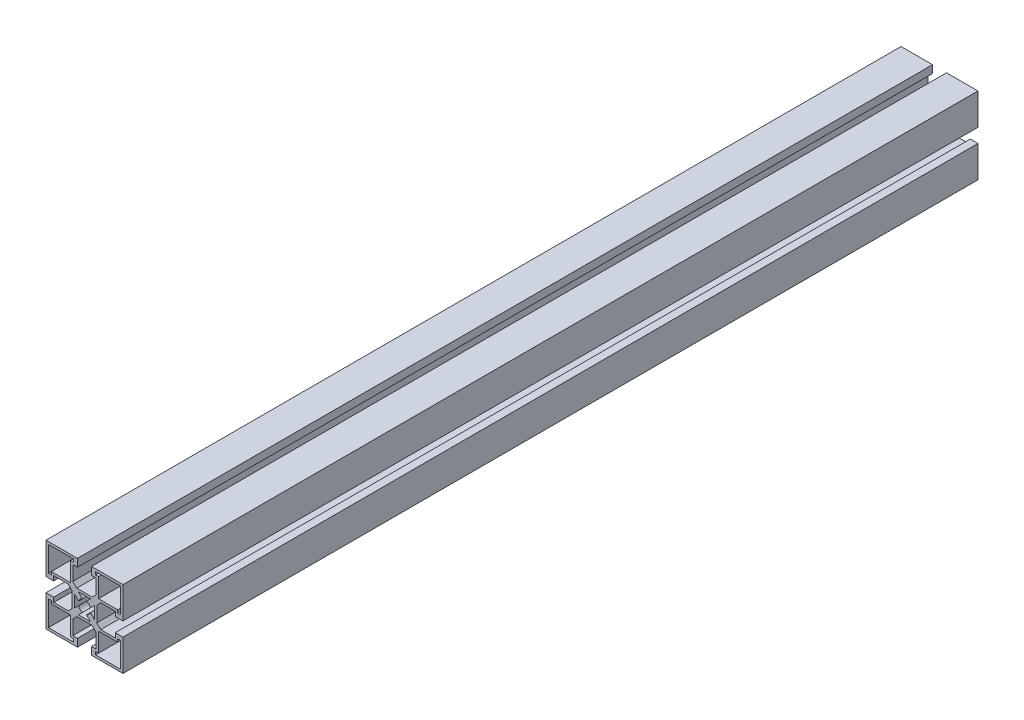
ISO-10303-21;
HEADER;
FILE_DESCRIPTION(('STEP AP214'),'2;1');
FILE_NAME('part.step','',(''),(''),'','','');
FILE_SCHEMA(('AUTOMOTIVE_DESIGN { 1 0 10303 214 1 1 1 1 }'));
ENDSEC;
DATA;
#1=APPLICATION_CONTEXT('core data for automotive mechanical design processes');
#2=APPLICATION_PROTOCOL_DEFINITION('international standard','automotive_design',2000,#1);
#3=PRODUCT_CONTEXT('',#1,'mechanical');
#4=PRODUCT('Part','Part','',(#3));
#5=PRODUCT_RELATED_PRODUCT_CATEGORY('part','',(#4));
#6=PRODUCT_DEFINITION_FORMATION('','',#4);
#7=PRODUCT_DEFINITION_CONTEXT('part definition',#1,'design');
#8=PRODUCT_DEFINITION('design','',#6,#7);
#9=PRODUCT_DEFINITION_SHAPE('','',#8);
#10=(LENGTH_UNIT() NAMED_UNIT(*) SI_UNIT(.MILLI.,.METRE.));
#11=(NAMED_UNIT(*) PLANE_ANGLE_UNIT() SI_UNIT($,.RADIAN.));
#12=(NAMED_UNIT(*) SI_UNIT($,.STERADIAN.) SOLID_ANGLE_UNIT());
#13=UNCERTAINTY_MEASURE_WITH_UNIT(LENGTH_MEASURE(1.E-05),#10,'distance_accuracy_value','');
#14=(GEOMETRIC_REPRESENTATION_CONTEXT(3) GLOBAL_UNCERTAINTY_ASSIGNED_CONTEXT((#13)) GLOBAL_UNIT_ASSIGNED_CONTEXT((#10,
#11,#12)) REPRESENTATION_CONTEXT('',''));
#15=CARTESIAN_POINT('',(0.,0.,0.));
#16=DIRECTION('',(0.,0.,1.));
#17=DIRECTION('',(1.,0.,0.));
#18=AXIS2_PLACEMENT_3D('',#15,#16,#17);
#19=CARTESIAN_POINT('',(-22.4999979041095,-4.10000762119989,-250.));
#20=DIRECTION('',(-1.,0.,0.));
#21=DIRECTION('',(0.,0.,1.));
#22=AXIS2_PLACEMENT_3D('',#19,#20,#21);
#23=PLANE('',#22);
#24=DIRECTION('',(0.,0.,1.));
#25=VECTOR('',#24,1.);
#26=CARTESIAN_POINT('',(-22.4999979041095,-22.5000076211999,-250.));
#27=LINE('',#26,#25);
#28=CARTESIAN_POINT('',(-22.4999979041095,-22.5000076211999,-250.));
#29=VERTEX_POINT('',#28);
#30=CARTESIAN_POINT('',(-22.4999979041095,-22.5000076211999,250.));
#31=VERTEX_POINT('',#30);
#32=EDGE_CURVE('E1205',#29,#31,#27,.T.);
#33=ORIENTED_EDGE('',*,*,#32,.T.);
#34=DIRECTION('',(0.,-1.,0.));
#35=VECTOR('',#34,1.);
#36=CARTESIAN_POINT('',(-22.4999979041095,-4.10000762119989,250.));
#37=LINE('',#36,#35);
#38=CARTESIAN_POINT('',(-22.4999979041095,-4.10000762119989,250.));
#39=VERTEX_POINT('',#38);
#40=EDGE_CURVE('E890',#39,#31,#37,.T.);
#41=ORIENTED_EDGE('',*,*,#40,.F.);
#42=DIRECTION('',(0.,0.,1.));
#43=VECTOR('',#42,1.);
#44=CARTESIAN_POINT('',(-22.4999979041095,-4.10000762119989,-250.));
#45=LINE('',#44,#43);
#46=CARTESIAN_POINT('',(-22.4999979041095,-4.10000762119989,-250.));
#47=VERTEX_POINT('',#46);
#48=EDGE_CURVE('E1223',#47,#39,#45,.T.);
#49=ORIENTED_EDGE('',*,*,#48,.F.);
#50=DIRECTION('',(0.,-1.,0.));
#51=VECTOR('',#50,1.);
#52=CARTESIAN_POINT('',(-22.4999979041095,-4.10000762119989,-250.));
#53=LINE('',#52,#51);
#54=EDGE_CURVE('E1208',#47,#29,#53,.T.);
#55=ORIENTED_EDGE('',*,*,#54,.T.);
#56=EDGE_LOOP('',(#33,#41,#49,#55));
#57=FACE_BOUND('',#56,.T.);
#58=ADVANCED_FACE('F30',(#57),#23,.T.);
#59=CARTESIAN_POINT('',(-17.9999979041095,-4.10000762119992,-250.));
#60=DIRECTION('',(0.,1.,0.));
#61=DIRECTION('',(-1.,0.,0.));
#62=AXIS2_PLACEMENT_3D('',#59,#60,#61);
#63=PLANE('',#62);
#64=ORIENTED_EDGE('',*,*,#48,.T.);
#65=DIRECTION('',(-1.,0.,0.));
#66=VECTOR('',#65,1.);
#67=CARTESIAN_POINT('',(-17.9999979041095,-4.10000762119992,250.));
#68=LINE('',#67,#66);
#69=CARTESIAN_POINT('',(-17.9999979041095,-4.10000762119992,250.));
#70=VERTEX_POINT('',#69);
#71=EDGE_CURVE('E761',#70,#39,#68,.T.);
#72=ORIENTED_EDGE('',*,*,#71,.F.);
#73=DIRECTION('',(0.,0.,1.));
#74=VECTOR('',#73,1.);
#75=CARTESIAN_POINT('',(-17.9999979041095,-4.10000762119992,-250.));
#76=LINE('',#75,#74);
#77=CARTESIAN_POINT('',(-17.9999979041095,-4.10000762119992,-250.));
#78=VERTEX_POINT('',#77);
#79=EDGE_CURVE('E1221',#78,#70,#76,.T.);
#80=ORIENTED_EDGE('',*,*,#79,.F.);
#81=DIRECTION('',(-1.,0.,0.));
#82=VECTOR('',#81,1.);
#83=CARTESIAN_POINT('',(-17.9999979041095,-4.10000762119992,-250.));
#84=LINE('',#83,#82);
#85=EDGE_CURVE('E1213',#78,#47,#84,.T.);
#86=ORIENTED_EDGE('',*,*,#85,.T.);
#87=EDGE_LOOP('',(#64,#72,#80,#86));
#88=FACE_BOUND('',#87,.T.);
#89=ADVANCED_FACE('F1195',(#88),#63,.T.);
#90=CARTESIAN_POINT('',(-17.9999979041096,-6.80000762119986,-250.));
#91=DIRECTION('',(1.,0.,0.));
#92=DIRECTION('',(0.,1.,0.));
#93=AXIS2_PLACEMENT_3D('',#90,#91,#92);
#94=PLANE('',#93);
#95=ORIENTED_EDGE('',*,*,#79,.T.);
#96=DIRECTION('',(0.,1.,0.));
#97=VECTOR('',#96,1.);
#98=CARTESIAN_POINT('',(-17.9999979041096,-6.80000762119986,250.));
#99=LINE('',#98,#97);
#100=CARTESIAN_POINT('',(-17.9999979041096,-6.80000762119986,250.));
#101=VERTEX_POINT('',#100);
#102=EDGE_CURVE('E764',#101,#70,#99,.T.);
#103=ORIENTED_EDGE('',*,*,#102,.F.);
#104=DIRECTION('',(0.,0.,1.));
#105=VECTOR('',#104,1.);
#106=CARTESIAN_POINT('',(-17.9999979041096,-6.80000762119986,-250.));
#107=LINE('',#106,#105);
#108=CARTESIAN_POINT('',(-17.9999979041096,-6.80000762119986,-250.));
#109=VERTEX_POINT('',#108);
#110=EDGE_CURVE('E1227',#109,#101,#107,.T.);
#111=ORIENTED_EDGE('',*,*,#110,.F.);
#112=DIRECTION('',(0.,1.,0.));
#113=VECTOR('',#112,1.);
#114=CARTESIAN_POINT('',(-17.9999979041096,-6.80000762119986,-250.));
#115=LINE('',#114,#113);
#116=EDGE_CURVE('E1445',#109,#78,#115,.T.);
#117=ORIENTED_EDGE('',*,*,#116,.T.);
#118=EDGE_LOOP('',(#95,#103,#111,#117));
#119=FACE_BOUND('',#118,.T.);
#120=ADVANCED_FACE('F1200',(#119),#94,.T.);
#121=CARTESIAN_POINT('',(-9.49999790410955,-6.80000762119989,-250.));
#122=DIRECTION('',(0.,1.,0.));
#123=DIRECTION('',(-1.,0.,0.));
#124=AXIS2_PLACEMENT_3D('',#121,#122,#123);
#125=PLANE('',#124);
#126=ORIENTED_EDGE('',*,*,#110,.T.);
#127=DIRECTION('',(-1.,0.,0.));
#128=VECTOR('',#127,1.);
#129=CARTESIAN_POINT('',(-9.49999790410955,-6.80000762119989,250.));
#130=LINE('',#129,#128);
#131=CARTESIAN_POINT('',(-9.49999790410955,-6.80000762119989,250.));
#132=VERTEX_POINT('',#131);
#133=EDGE_CURVE('E767',#132,#101,#130,.T.);
#134=ORIENTED_EDGE('',*,*,#133,.F.);
#135=DIRECTION('',(0.,0.,1.));
#136=VECTOR('',#135,1.);
#137=CARTESIAN_POINT('',(-9.49999790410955,-6.80000762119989,-250.));
#138=LINE('',#137,#136);
#139=CARTESIAN_POINT('',(-9.49999790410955,-6.80000762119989,-250.));
#140=VERTEX_POINT('',#139);
#141=EDGE_CURVE('E1233',#140,#132,#138,.T.);
#142=ORIENTED_EDGE('',*,*,#141,.F.);
#143=DIRECTION('',(-1.,0.,0.));
#144=VECTOR('',#143,1.);
#145=CARTESIAN_POINT('',(-9.49999790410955,-6.80000762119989,-250.));
#146=LINE('',#145,#144);
#147=EDGE_CURVE('E1443',#140,#109,#146,.T.);
#148=ORIENTED_EDGE('',*,*,#147,.T.);
#149=EDGE_LOOP('',(#126,#134,#142,#148));
#150=FACE_BOUND('',#149,.T.);
#151=ADVANCED_FACE('F2269',(#150),#125,.T.);
#152=CARTESIAN_POINT('',(-7.19999790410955,-4.5000076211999,-250.));
#153=DIRECTION('',(-0.707106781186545,0.70710678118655,0.));
#154=DIRECTION('',(-0.70710678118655,-0.707106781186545,0.));
#155=AXIS2_PLACEMENT_3D('',#152,#153,#154);
#156=PLANE('',#155);
#157=ORIENTED_EDGE('',*,*,#141,.T.);
#158=DIRECTION('',(-0.70710678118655,-0.707106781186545,0.));
#159=VECTOR('',#158,1.);
#160=CARTESIAN_POINT('',(-7.19999790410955,-4.5000076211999,250.));
#161=LINE('',#160,#159);
#162=CARTESIAN_POINT('',(-7.19999790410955,-4.5000076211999,250.));
#163=VERTEX_POINT('',#162);
#164=EDGE_CURVE('E770',#163,#132,#161,.T.);
#165=ORIENTED_EDGE('',*,*,#164,.F.);
#166=DIRECTION('',(0.,0.,1.));
#167=VECTOR('',#166,1.);
#168=CARTESIAN_POINT('',(-7.19999790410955,-4.5000076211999,-250.));
#169=LINE('',#168,#167);
#170=CARTESIAN_POINT('',(-7.19999790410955,-4.5000076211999,-250.));
#171=VERTEX_POINT('',#170);
#172=EDGE_CURVE('E1235',#171,#163,#169,.T.);
#173=ORIENTED_EDGE('',*,*,#172,.F.);
#174=DIRECTION('',(-0.70710678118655,-0.707106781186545,0.));
#175=VECTOR('',#174,1.);
#176=CARTESIAN_POINT('',(-7.19999790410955,-4.5000076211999,-250.));
#177=LINE('',#176,#175);
#178=EDGE_CURVE('E1440',#171,#140,#177,.T.);
#179=ORIENTED_EDGE('',*,*,#178,.T.);
#180=EDGE_LOOP('',(#157,#165,#173,#179));
#181=FACE_BOUND('',#180,.T.);
#182=ADVANCED_FACE('F2261',(#181),#156,.T.);
#183=CARTESIAN_POINT('',(-7.19999790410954,4.49999237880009,-250.));
#184=DIRECTION('',(-1.,0.,0.));
#185=DIRECTION('',(0.,-1.,0.));
#186=AXIS2_PLACEMENT_3D('',#183,#184,#185);
#187=PLANE('',#186);
#188=ORIENTED_EDGE('',*,*,#172,.T.);
#189=DIRECTION('',(0.,-1.,0.));
#190=VECTOR('',#189,1.);
#191=CARTESIAN_POINT('',(-7.19999790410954,4.49999237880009,250.));
#192=LINE('',#191,#190);
#193=CARTESIAN_POINT('',(-7.19999790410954,4.49999237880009,250.));
#194=VERTEX_POINT('',#193);
#195=EDGE_CURVE('E773',#194,#163,#192,.T.);
#196=ORIENTED_EDGE('',*,*,#195,.F.);
#197=DIRECTION('',(0.,0.,1.));
#198=VECTOR('',#197,1.);
#199=CARTESIAN_POINT('',(-7.19999790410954,4.49999237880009,-250.));
#200=LINE('',#199,#198);
#201=CARTESIAN_POINT('',(-7.19999790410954,4.49999237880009,-250.));
#202=VERTEX_POINT('',#201);
#203=EDGE_CURVE('E1237',#202,#194,#200,.T.);
#204=ORIENTED_EDGE('',*,*,#203,.F.);
#205=DIRECTION('',(0.,-1.,0.));
#206=VECTOR('',#205,1.);
#207=CARTESIAN_POINT('',(-7.19999790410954,4.49999237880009,-250.));
#208=LINE('',#207,#206);
#209=EDGE_CURVE('E1437',#202,#171,#208,.T.);
#210=ORIENTED_EDGE('',*,*,#209,.T.);
#211=EDGE_LOOP('',(#188,#196,#204,#210));
#212=FACE_BOUND('',#211,.T.);
#213=ADVANCED_FACE('F2253',(#212),#187,.T.);
#214=CARTESIAN_POINT('',(-9.49999790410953,6.79999237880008,-250.));
#215=DIRECTION('',(-0.707106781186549,-0.707106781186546,0.));
#216=DIRECTION('',(0.707106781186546,-0.707106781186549,0.));
#217=AXIS2_PLACEMENT_3D('',#214,#215,#216);
#218=PLANE('',#217);
#219=ORIENTED_EDGE('',*,*,#203,.T.);
#220=DIRECTION('',(0.707106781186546,-0.707106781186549,0.));
#221=VECTOR('',#220,1.);
#222=CARTESIAN_POINT('',(-9.49999790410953,6.79999237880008,250.));
#223=LINE('',#222,#221);
#224=CARTESIAN_POINT('',(-9.49999790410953,6.79999237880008,250.));
#225=VERTEX_POINT('',#224);
#226=EDGE_CURVE('E776',#225,#194,#223,.T.);
#227=ORIENTED_EDGE('',*,*,#226,.F.);
#228=DIRECTION('',(0.,0.,1.));
#229=VECTOR('',#228,1.);
#230=CARTESIAN_POINT('',(-9.49999790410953,6.79999237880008,-250.));
#231=LINE('',#230,#229);
#232=CARTESIAN_POINT('',(-9.49999790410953,6.79999237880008,-250.));
#233=VERTEX_POINT('',#232);
#234=EDGE_CURVE('E1239',#233,#225,#231,.T.);
#235=ORIENTED_EDGE('',*,*,#234,.F.);
#236=DIRECTION('',(0.707106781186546,-0.707106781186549,0.));
#237=VECTOR('',#236,1.);
#238=CARTESIAN_POINT('',(-9.49999790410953,6.79999237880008,-250.));
#239=LINE('',#238,#237);
#240=EDGE_CURVE('E1434',#233,#202,#239,.T.);
#241=ORIENTED_EDGE('',*,*,#240,.T.);
#242=EDGE_LOOP('',(#219,#227,#235,#241));
#243=FACE_BOUND('',#242,.T.);
#244=ADVANCED_FACE('F2245',(#243),#218,.T.);
#245=CARTESIAN_POINT('',(-17.9999979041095,6.79999237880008,-250.));
#246=DIRECTION('',(0.,-1.,0.));
#247=DIRECTION('',(0.,0.,-1.));
#248=AXIS2_PLACEMENT_3D('',#245,#246,#247);
#249=PLANE('',#248);
#250=ORIENTED_EDGE('',*,*,#234,.T.);
#251=DIRECTION('',(1.,0.,0.));
#252=VECTOR('',#251,1.);
#253=CARTESIAN_POINT('',(-17.9999979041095,6.79999237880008,250.));
#254=LINE('',#253,#252);
#255=CARTESIAN_POINT('',(-17.9999979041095,6.79999237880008,250.));
#256=VERTEX_POINT('',#255);
#257=EDGE_CURVE('E779',#256,#225,#254,.T.);
#258=ORIENTED_EDGE('',*,*,#257,.F.);
#259=DIRECTION('',(0.,0.,1.));
#260=VECTOR('',#259,1.);
#261=CARTESIAN_POINT('',(-17.9999979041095,6.79999237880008,-250.));
#262=LINE('',#261,#260);
#263=CARTESIAN_POINT('',(-17.9999979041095,6.79999237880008,-250.));
#264=VERTEX_POINT('',#263);
#265=EDGE_CURVE('E1241',#264,#256,#262,.T.);
#266=ORIENTED_EDGE('',*,*,#265,.F.);
#267=DIRECTION('',(1.,0.,0.));
#268=VECTOR('',#267,1.);
#269=CARTESIAN_POINT('',(-17.9999979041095,6.79999237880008,-250.));
#270=LINE('',#269,#268);
#271=EDGE_CURVE('E1431',#264,#233,#270,.T.);
#272=ORIENTED_EDGE('',*,*,#271,.T.);
#273=EDGE_LOOP('',(#250,#258,#266,#272));
#274=FACE_BOUND('',#273,.T.);
#275=ADVANCED_FACE('F2237',(#274),#249,.T.);
#276=CARTESIAN_POINT('',(-17.9999979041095,4.09999237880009,-250.));
#277=DIRECTION('',(1.,0.,0.));
#278=DIRECTION('',(0.,0.,-1.));
#279=AXIS2_PLACEMENT_3D('',#276,#277,#278);
#280=PLANE('',#279);
#281=ORIENTED_EDGE('',*,*,#265,.T.);
#282=DIRECTION('',(0.,1.,0.));
#283=VECTOR('',#282,1.);
#284=CARTESIAN_POINT('',(-17.9999979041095,4.09999237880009,250.));
#285=LINE('',#284,#283);
#286=CARTESIAN_POINT('',(-17.9999979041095,4.09999237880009,250.));
#287=VERTEX_POINT('',#286);
#288=EDGE_CURVE('E782',#287,#256,#285,.T.);
#289=ORIENTED_EDGE('',*,*,#288,.F.);
#290=DIRECTION('',(0.,0.,1.));
#291=VECTOR('',#290,1.);
#292=CARTESIAN_POINT('',(-17.9999979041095,4.09999237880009,-250.));
#293=LINE('',#292,#291);
#294=CARTESIAN_POINT('',(-17.9999979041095,4.09999237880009,-250.));
#295=VERTEX_POINT('',#294);
#296=EDGE_CURVE('E1243',#295,#287,#293,.T.);
#297=ORIENTED_EDGE('',*,*,#296,.F.);
#298=DIRECTION('',(0.,1.,0.));
#299=VECTOR('',#298,1.);
#300=CARTESIAN_POINT('',(-17.9999979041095,4.09999237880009,-250.));
#301=LINE('',#300,#299);
#302=EDGE_CURVE('E1428',#295,#264,#301,.T.);
#303=ORIENTED_EDGE('',*,*,#302,.T.);
#304=EDGE_LOOP('',(#281,#289,#297,#303));
#305=FACE_BOUND('',#304,.T.);
#306=ADVANCED_FACE('F2229',(#305),#280,.T.);
#307=CARTESIAN_POINT('',(-22.4999979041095,4.09999237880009,-250.));
#308=DIRECTION('',(0.,-1.,0.));
#309=DIRECTION('',(0.,0.,-1.));
#310=AXIS2_PLACEMENT_3D('',#307,#308,#309);
#311=PLANE('',#310);
#312=ORIENTED_EDGE('',*,*,#296,.T.);
#313=DIRECTION('',(1.,0.,0.));
#314=VECTOR('',#313,1.);
#315=CARTESIAN_POINT('',(-22.4999979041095,4.09999237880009,250.));
#316=LINE('',#315,#314);
#317=CARTESIAN_POINT('',(-22.4999979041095,4.09999237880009,250.));
#318=VERTEX_POINT('',#317);
#319=EDGE_CURVE('E785',#318,#287,#316,.T.);
#320=ORIENTED_EDGE('',*,*,#319,.F.);
#321=DIRECTION('',(0.,0.,1.));
#322=VECTOR('',#321,1.);
#323=CARTESIAN_POINT('',(-22.4999979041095,4.09999237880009,-250.));
#324=LINE('',#323,#322);
#325=CARTESIAN_POINT('',(-22.4999979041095,4.09999237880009,-250.));
#326=VERTEX_POINT('',#325);
#327=EDGE_CURVE('E1245',#326,#318,#324,.T.);
#328=ORIENTED_EDGE('',*,*,#327,.F.);
#329=DIRECTION('',(1.,0.,0.));
#330=VECTOR('',#329,1.);
#331=CARTESIAN_POINT('',(-22.4999979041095,4.09999237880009,-250.));
#332=LINE('',#331,#330);
#333=EDGE_CURVE('E1425',#326,#295,#332,.T.);
#334=ORIENTED_EDGE('',*,*,#333,.T.);
#335=EDGE_LOOP('',(#312,#320,#328,#334));
#336=FACE_BOUND('',#335,.T.);
#337=ADVANCED_FACE('F2221',(#336),#311,.T.);
#338=CARTESIAN_POINT('',(-22.4999979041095,22.4999923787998,-250.));
#339=DIRECTION('',(-1.,0.,0.));
#340=DIRECTION('',(0.,-1.,0.));
#341=AXIS2_PLACEMENT_3D('',#338,#339,#340);
#342=PLANE('',#341);
#343=ORIENTED_EDGE('',*,*,#327,.T.);
#344=DIRECTION('',(0.,-1.,0.));
#345=VECTOR('',#344,1.);
#346=CARTESIAN_POINT('',(-22.4999979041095,22.4999923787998,250.));
#347=LINE('',#346,#345);
#348=CARTESIAN_POINT('',(-22.4999979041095,22.4999923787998,250.));
#349=VERTEX_POINT('',#348);
#350=EDGE_CURVE('E788',#349,#318,#347,.T.);
#351=ORIENTED_EDGE('',*,*,#350,.F.);
#352=DIRECTION('',(0.,0.,1.));
#353=VECTOR('',#352,1.);
#354=CARTESIAN_POINT('',(-22.4999979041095,22.4999923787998,-250.));
#355=LINE('',#354,#353);
#356=CARTESIAN_POINT('',(-22.4999979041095,22.4999923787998,-250.));
#357=VERTEX_POINT('',#356);
#358=EDGE_CURVE('E1247',#357,#349,#355,.T.);
#359=ORIENTED_EDGE('',*,*,#358,.F.);
#360=DIRECTION('',(0.,-1.,0.));
#361=VECTOR('',#360,1.);
#362=CARTESIAN_POINT('',(-22.4999979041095,22.4999923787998,-250.));
#363=LINE('',#362,#361);
#364=EDGE_CURVE('E1422',#357,#326,#363,.T.);
#365=ORIENTED_EDGE('',*,*,#364,.T.);
#366=EDGE_LOOP('',(#343,#351,#359,#365));
#367=FACE_BOUND('',#366,.T.);
#368=ADVANCED_FACE('F2213',(#367),#342,.T.);
#369=CARTESIAN_POINT('',(-4.09999790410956,22.4999923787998,-250.));
#370=DIRECTION('',(0.,1.,0.));
#371=DIRECTION('',(-1.,0.,0.));
#372=AXIS2_PLACEMENT_3D('',#369,#370,#371);
#373=PLANE('',#372);
#374=ORIENTED_EDGE('',*,*,#358,.T.);
#375=DIRECTION('',(-1.,0.,0.));
#376=VECTOR('',#375,1.);
#377=CARTESIAN_POINT('',(-4.09999790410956,22.4999923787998,250.));
#378=LINE('',#377,#376);
#379=CARTESIAN_POINT('',(-4.09999790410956,22.4999923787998,250.));
#380=VERTEX_POINT('',#379);
#381=EDGE_CURVE('E791',#380,#349,#378,.T.);
#382=ORIENTED_EDGE('',*,*,#381,.F.);
#383=DIRECTION('',(0.,0.,1.));
#384=VECTOR('',#383,1.);
#385=CARTESIAN_POINT('',(-4.09999790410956,22.4999923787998,-250.));
#386=LINE('',#385,#384);
#387=CARTESIAN_POINT('',(-4.09999790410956,22.4999923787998,-250.));
#388=VERTEX_POINT('',#387);
#389=EDGE_CURVE('E1249',#388,#380,#386,.T.);
#390=ORIENTED_EDGE('',*,*,#389,.F.);
#391=DIRECTION('',(-1.,0.,0.));
#392=VECTOR('',#391,1.);
#393=CARTESIAN_POINT('',(-4.09999790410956,22.4999923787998,-250.));
#394=LINE('',#393,#392);
#395=EDGE_CURVE('E1419',#388,#357,#394,.T.);
#396=ORIENTED_EDGE('',*,*,#395,.T.);
#397=EDGE_LOOP('',(#374,#382,#390,#396));
#398=FACE_BOUND('',#397,.T.);
#399=ADVANCED_FACE('F2205',(#398),#373,.T.);
#400=CARTESIAN_POINT('',(-4.09999790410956,17.9999923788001,-250.));
#401=DIRECTION('',(1.,0.,0.));
#402=DIRECTION('',(0.,1.,0.));
#403=AXIS2_PLACEMENT_3D('',#400,#401,#402);
#404=PLANE('',#403);
#405=ORIENTED_EDGE('',*,*,#389,.T.);
#406=DIRECTION('',(0.,1.,0.));
#407=VECTOR('',#406,1.);
#408=CARTESIAN_POINT('',(-4.09999790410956,17.9999923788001,250.));
#409=LINE('',#408,#407);
#410=CARTESIAN_POINT('',(-4.09999790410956,17.9999923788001,250.));
#411=VERTEX_POINT('',#410);
#412=EDGE_CURVE('E794',#411,#380,#409,.T.);
#413=ORIENTED_EDGE('',*,*,#412,.F.);
#414=DIRECTION('',(0.,0.,1.));
#415=VECTOR('',#414,1.);
#416=CARTESIAN_POINT('',(-4.09999790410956,17.9999923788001,-250.));
#417=LINE('',#416,#415);
#418=CARTESIAN_POINT('',(-4.09999790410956,17.9999923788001,-250.));
#419=VERTEX_POINT('',#418);
#420=EDGE_CURVE('E1251',#419,#411,#417,.T.);
#421=ORIENTED_EDGE('',*,*,#420,.F.);
#422=DIRECTION('',(0.,1.,0.));
#423=VECTOR('',#422,1.);
#424=CARTESIAN_POINT('',(-4.09999790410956,17.9999923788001,-250.));
#425=LINE('',#424,#423);
#426=EDGE_CURVE('E1416',#419,#388,#425,.T.);
#427=ORIENTED_EDGE('',*,*,#426,.T.);
#428=EDGE_LOOP('',(#405,#413,#421,#427));
#429=FACE_BOUND('',#428,.T.);
#430=ADVANCED_FACE('F2197',(#429),#404,.T.);
#431=CARTESIAN_POINT('',(-6.79999790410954,17.9999923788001,-250.));
#432=DIRECTION('',(0.,-1.,0.));
#433=DIRECTION('',(0.,0.,-1.));
#434=AXIS2_PLACEMENT_3D('',#431,#432,#433);
#435=PLANE('',#434);
#436=ORIENTED_EDGE('',*,*,#420,.T.);
#437=DIRECTION('',(1.,0.,0.));
#438=VECTOR('',#437,1.);
#439=CARTESIAN_POINT('',(-6.79999790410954,17.9999923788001,250.));
#440=LINE('',#439,#438);
#441=CARTESIAN_POINT('',(-6.79999790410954,17.9999923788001,250.));
#442=VERTEX_POINT('',#441);
#443=EDGE_CURVE('E797',#442,#411,#440,.T.);
#444=ORIENTED_EDGE('',*,*,#443,.F.);
#445=DIRECTION('',(0.,0.,1.));
#446=VECTOR('',#445,1.);
#447=CARTESIAN_POINT('',(-6.79999790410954,17.9999923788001,-250.));
#448=LINE('',#447,#446);
#449=CARTESIAN_POINT('',(-6.79999790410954,17.9999923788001,-250.));
#450=VERTEX_POINT('',#449);
#451=EDGE_CURVE('E1253',#450,#442,#448,.T.);
#452=ORIENTED_EDGE('',*,*,#451,.F.);
#453=DIRECTION('',(1.,0.,0.));
#454=VECTOR('',#453,1.);
#455=CARTESIAN_POINT('',(-6.79999790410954,17.9999923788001,-250.));
#456=LINE('',#455,#454);
#457=EDGE_CURVE('E1413',#450,#419,#456,.T.);
#458=ORIENTED_EDGE('',*,*,#457,.T.);
#459=EDGE_LOOP('',(#436,#444,#452,#458));
#460=FACE_BOUND('',#459,.T.);
#461=ADVANCED_FACE('F2189',(#460),#435,.T.);
#462=CARTESIAN_POINT('',(-6.79999790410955,9.4999923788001,-250.));
#463=DIRECTION('',(1.,0.,0.));
#464=DIRECTION('',(0.,1.,0.));
#465=AXIS2_PLACEMENT_3D('',#462,#463,#464);
#466=PLANE('',#465);
#467=ORIENTED_EDGE('',*,*,#451,.T.);
#468=DIRECTION('',(0.,1.,0.));
#469=VECTOR('',#468,1.);
#470=CARTESIAN_POINT('',(-6.79999790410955,9.4999923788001,250.));
#471=LINE('',#470,#469);
#472=CARTESIAN_POINT('',(-6.79999790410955,9.4999923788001,250.));
#473=VERTEX_POINT('',#472);
#474=EDGE_CURVE('E800',#473,#442,#471,.T.);
#475=ORIENTED_EDGE('',*,*,#474,.F.);
#476=DIRECTION('',(0.,0.,1.));
#477=VECTOR('',#476,1.);
#478=CARTESIAN_POINT('',(-6.79999790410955,9.4999923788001,-250.));
#479=LINE('',#478,#477);
#480=CARTESIAN_POINT('',(-6.79999790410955,9.4999923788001,-250.));
#481=VERTEX_POINT('',#480);
#482=EDGE_CURVE('E1255',#481,#473,#479,.T.);
#483=ORIENTED_EDGE('',*,*,#482,.F.);
#484=DIRECTION('',(0.,1.,0.));
#485=VECTOR('',#484,1.);
#486=CARTESIAN_POINT('',(-6.79999790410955,9.4999923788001,-250.));
#487=LINE('',#486,#485);
#488=EDGE_CURVE('E1410',#481,#450,#487,.T.);
#489=ORIENTED_EDGE('',*,*,#488,.T.);
#490=EDGE_LOOP('',(#467,#475,#483,#489));
#491=FACE_BOUND('',#490,.T.);
#492=ADVANCED_FACE('F2181',(#491),#466,.T.);
#493=CARTESIAN_POINT('',(-4.49999790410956,7.19999237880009,-250.));
#494=DIRECTION('',(0.707106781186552,0.707106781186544,0.));
#495=DIRECTION('',(-0.707106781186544,0.707106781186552,0.));
#496=AXIS2_PLACEMENT_3D('',#493,#494,#495);
#497=PLANE('',#496);
#498=ORIENTED_EDGE('',*,*,#482,.T.);
#499=DIRECTION('',(-0.707106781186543,0.707106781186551,0.));
#500=VECTOR('',#499,1.);
#501=CARTESIAN_POINT('',(-4.49999790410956,7.19999237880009,250.));
#502=LINE('',#501,#500);
#503=CARTESIAN_POINT('',(-4.49999790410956,7.19999237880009,250.));
#504=VERTEX_POINT('',#503);
#505=EDGE_CURVE('E803',#504,#473,#502,.T.);
#506=ORIENTED_EDGE('',*,*,#505,.F.);
#507=DIRECTION('',(0.,0.,1.));
#508=VECTOR('',#507,1.);
#509=CARTESIAN_POINT('',(-4.49999790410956,7.19999237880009,-250.));
#510=LINE('',#509,#508);
#511=CARTESIAN_POINT('',(-4.49999790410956,7.19999237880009,-250.));
#512=VERTEX_POINT('',#511);
#513=EDGE_CURVE('E1257',#512,#504,#510,.T.);
#514=ORIENTED_EDGE('',*,*,#513,.F.);
#515=DIRECTION('',(-0.707106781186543,0.707106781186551,0.));
#516=VECTOR('',#515,1.);
#517=CARTESIAN_POINT('',(-4.49999790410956,7.19999237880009,-250.));
#518=LINE('',#517,#516);
#519=EDGE_CURVE('E1407',#512,#481,#518,.T.);
#520=ORIENTED_EDGE('',*,*,#519,.T.);
#521=EDGE_LOOP('',(#498,#506,#514,#520));
#522=FACE_BOUND('',#521,.T.);
#523=ADVANCED_FACE('F2173',(#522),#497,.T.);
#524=CARTESIAN_POINT('',(4.50000209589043,7.19999237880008,-250.));
#525=DIRECTION('',(0.,1.,0.));
#526=DIRECTION('',(-1.,0.,0.));
#527=AXIS2_PLACEMENT_3D('',#524,#525,#526);
#528=PLANE('',#527);
#529=CARTESIAN_POINT('',(2.0958905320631E-06,7.19999237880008,227.5));
#530=DIRECTION('',(0.,1.,0.));
#531=DIRECTION('',(-1.,0.,0.));
#532=AXIS2_PLACEMENT_3D('',#529,#530,#531);
#533=CIRCLE('',#532,3.39999999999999);
#534=CARTESIAN_POINT('',(-3.39999790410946,7.19999237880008,227.5));
#535=VERTEX_POINT('',#534);
#536=EDGE_CURVE('E1131',#535,#535,#533,.T.);
#537=ORIENTED_EDGE('',*,*,#536,.F.);
#538=EDGE_LOOP('',(#537));
#539=FACE_BOUND('',#538,.T.);
#540=CARTESIAN_POINT('',(2.0958905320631E-06,7.19999237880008,-227.5));
#541=DIRECTION('',(0.,1.,0.));
#542=DIRECTION('',(-1.,0.,0.));
#543=AXIS2_PLACEMENT_3D('',#540,#541,#542);
#544=CIRCLE('',#543,3.39999999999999);
#545=CARTESIAN_POINT('',(-3.39999790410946,7.19999237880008,-227.5));
#546=VERTEX_POINT('',#545);
#547=EDGE_CURVE('E1033',#546,#546,#544,.T.);
#548=ORIENTED_EDGE('',*,*,#547,.F.);
#549=EDGE_LOOP('',(#548));
#550=FACE_BOUND('',#549,.T.);
#551=ORIENTED_EDGE('',*,*,#513,.T.);
#552=DIRECTION('',(-1.,0.,0.));
#553=VECTOR('',#552,1.);
#554=CARTESIAN_POINT('',(4.50000209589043,7.19999237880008,250.));
#555=LINE('',#554,#553);
#556=CARTESIAN_POINT('',(4.50000209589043,7.19999237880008,250.));
#557=VERTEX_POINT('',#556);
#558=EDGE_CURVE('E806',#557,#504,#555,.T.);
#559=ORIENTED_EDGE('',*,*,#558,.F.);
#560=DIRECTION('',(0.,0.,1.));
#561=VECTOR('',#560,1.);
#562=CARTESIAN_POINT('',(4.50000209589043,7.19999237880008,-250.));
#563=LINE('',#562,#561);
#564=CARTESIAN_POINT('',(4.50000209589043,7.19999237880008,-250.));
#565=VERTEX_POINT('',#564);
#566=EDGE_CURVE('E1259',#565,#557,#563,.T.);
#567=ORIENTED_EDGE('',*,*,#566,.F.);
#568=DIRECTION('',(-1.,0.,0.));
#569=VECTOR('',#568,1.);
#570=CARTESIAN_POINT('',(4.50000209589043,7.19999237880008,-250.));
#571=LINE('',#570,#569);
#572=EDGE_CURVE('E1404',#565,#512,#571,.T.);
#573=ORIENTED_EDGE('',*,*,#572,.T.);
#574=EDGE_LOOP('',(#551,#559,#567,#573));
#575=FACE_BOUND('',#574,.T.);
#576=ADVANCED_FACE('F2165',(#539,#550,#575),#528,.T.);
#577=CARTESIAN_POINT('',(6.80000209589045,9.49999237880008,-250.));
#578=DIRECTION('',(-0.707106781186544,0.707106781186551,0.));
#579=DIRECTION('',(-0.707106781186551,-0.707106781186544,0.));
#580=AXIS2_PLACEMENT_3D('',#577,#578,#579);
#581=PLANE('',#580);
#582=ORIENTED_EDGE('',*,*,#566,.T.);
#583=DIRECTION('',(-0.707106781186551,-0.707106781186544,0.));
#584=VECTOR('',#583,1.);
#585=CARTESIAN_POINT('',(6.80000209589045,9.49999237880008,250.));
#586=LINE('',#585,#584);
#587=CARTESIAN_POINT('',(6.80000209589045,9.49999237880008,250.));
#588=VERTEX_POINT('',#587);
#589=EDGE_CURVE('E809',#588,#557,#586,.T.);
#590=ORIENTED_EDGE('',*,*,#589,.F.);
#591=DIRECTION('',(0.,0.,1.));
#592=VECTOR('',#591,1.);
#593=CARTESIAN_POINT('',(6.80000209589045,9.49999237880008,-250.));
#594=LINE('',#593,#592);
#595=CARTESIAN_POINT('',(6.80000209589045,9.49999237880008,-250.));
#596=VERTEX_POINT('',#595);
#597=EDGE_CURVE('E1261',#596,#588,#594,.T.);
#598=ORIENTED_EDGE('',*,*,#597,.F.);
#599=DIRECTION('',(-0.707106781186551,-0.707106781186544,0.));
#600=VECTOR('',#599,1.);
#601=CARTESIAN_POINT('',(6.80000209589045,9.49999237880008,-250.));
#602=LINE('',#601,#600);
#603=EDGE_CURVE('E1401',#596,#565,#602,.T.);
#604=ORIENTED_EDGE('',*,*,#603,.T.);
#605=EDGE_LOOP('',(#582,#590,#598,#604));
#606=FACE_BOUND('',#605,.T.);
#607=ADVANCED_FACE('F2157',(#606),#581,.T.);
#608=CARTESIAN_POINT('',(6.80000209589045,17.9999923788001,-250.));
#609=DIRECTION('',(-1.,0.,0.));
#610=DIRECTION('',(0.,-1.,0.));
#611=AXIS2_PLACEMENT_3D('',#608,#609,#610);
#612=PLANE('',#611);
#613=ORIENTED_EDGE('',*,*,#597,.T.);
#614=DIRECTION('',(0.,-1.,0.));
#615=VECTOR('',#614,1.);
#616=CARTESIAN_POINT('',(6.80000209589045,17.9999923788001,250.));
#617=LINE('',#616,#615);
#618=CARTESIAN_POINT('',(6.80000209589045,17.9999923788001,250.));
#619=VERTEX_POINT('',#618);
#620=EDGE_CURVE('E812',#619,#588,#617,.T.);
#621=ORIENTED_EDGE('',*,*,#620,.F.);
#622=DIRECTION('',(0.,0.,1.));
#623=VECTOR('',#622,1.);
#624=CARTESIAN_POINT('',(6.80000209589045,17.9999923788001,-250.));
#625=LINE('',#624,#623);
#626=CARTESIAN_POINT('',(6.80000209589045,17.9999923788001,-250.));
#627=VERTEX_POINT('',#626);
#628=EDGE_CURVE('E1263',#627,#619,#625,.T.);
#629=ORIENTED_EDGE('',*,*,#628,.F.);
#630=DIRECTION('',(0.,-1.,0.));
#631=VECTOR('',#630,1.);
#632=CARTESIAN_POINT('',(6.80000209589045,17.9999923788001,-250.));
#633=LINE('',#632,#631);
#634=EDGE_CURVE('E1398',#627,#596,#633,.T.);
#635=ORIENTED_EDGE('',*,*,#634,.T.);
#636=EDGE_LOOP('',(#613,#621,#629,#635));
#637=FACE_BOUND('',#636,.T.);
#638=ADVANCED_FACE('F2149',(#637),#612,.T.);
#639=CARTESIAN_POINT('',(4.10000209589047,17.9999923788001,-250.));
#640=DIRECTION('',(0.,-1.,0.));
#641=DIRECTION('',(1.,0.,0.));
#642=AXIS2_PLACEMENT_3D('',#639,#640,#641);
#643=PLANE('',#642);
#644=ORIENTED_EDGE('',*,*,#628,.T.);
#645=DIRECTION('',(1.,0.,0.));
#646=VECTOR('',#645,1.);
#647=CARTESIAN_POINT('',(4.10000209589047,17.9999923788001,250.));
#648=LINE('',#647,#646);
#649=CARTESIAN_POINT('',(4.10000209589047,17.9999923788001,250.));
#650=VERTEX_POINT('',#649);
#651=EDGE_CURVE('E815',#650,#619,#648,.T.);
#652=ORIENTED_EDGE('',*,*,#651,.F.);
#653=DIRECTION('',(0.,0.,1.));
#654=VECTOR('',#653,1.);
#655=CARTESIAN_POINT('',(4.10000209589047,17.9999923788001,-250.));
#656=LINE('',#655,#654);
#657=CARTESIAN_POINT('',(4.10000209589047,17.9999923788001,-250.));
#658=VERTEX_POINT('',#657);
#659=EDGE_CURVE('E1265',#658,#650,#656,.T.);
#660=ORIENTED_EDGE('',*,*,#659,.F.);
#661=DIRECTION('',(1.,0.,0.));
#662=VECTOR('',#661,1.);
#663=CARTESIAN_POINT('',(4.10000209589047,17.9999923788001,-250.));
#664=LINE('',#663,#662);
#665=EDGE_CURVE('E1395',#658,#627,#664,.T.);
#666=ORIENTED_EDGE('',*,*,#665,.T.);
#667=EDGE_LOOP('',(#644,#652,#660,#666));
#668=FACE_BOUND('',#667,.T.);
#669=ADVANCED_FACE('F2141',(#668),#643,.T.);
#670=CARTESIAN_POINT('',(4.10000209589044,22.4999923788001,-250.));
#671=DIRECTION('',(-1.,0.,0.));
#672=DIRECTION('',(0.,-1.,0.));
#673=AXIS2_PLACEMENT_3D('',#670,#671,#672);
#674=PLANE('',#673);
#675=ORIENTED_EDGE('',*,*,#659,.T.);
#676=DIRECTION('',(0.,-1.,0.));
#677=VECTOR('',#676,1.);
#678=CARTESIAN_POINT('',(4.10000209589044,22.4999923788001,250.));
#679=LINE('',#678,#677);
#680=CARTESIAN_POINT('',(4.10000209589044,22.4999923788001,250.));
#681=VERTEX_POINT('',#680);
#682=EDGE_CURVE('E818',#681,#650,#679,.T.);
#683=ORIENTED_EDGE('',*,*,#682,.F.);
#684=DIRECTION('',(0.,0.,1.));
#685=VECTOR('',#684,1.);
#686=CARTESIAN_POINT('',(4.10000209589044,22.4999923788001,-250.));
#687=LINE('',#686,#685);
#688=CARTESIAN_POINT('',(4.10000209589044,22.4999923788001,-250.));
#689=VERTEX_POINT('',#688);
#690=EDGE_CURVE('E1267',#689,#681,#687,.T.);
#691=ORIENTED_EDGE('',*,*,#690,.F.);
#692=DIRECTION('',(0.,-1.,0.));
#693=VECTOR('',#692,1.);
#694=CARTESIAN_POINT('',(4.10000209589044,22.4999923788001,-250.));
#695=LINE('',#694,#693);
#696=EDGE_CURVE('E1392',#689,#658,#695,.T.);
#697=ORIENTED_EDGE('',*,*,#696,.T.);
#698=EDGE_LOOP('',(#675,#683,#691,#697));
#699=FACE_BOUND('',#698,.T.);
#700=ADVANCED_FACE('F2133',(#699),#674,.T.);
#701=CARTESIAN_POINT('',(22.5000020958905,22.4999923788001,-250.));
#702=DIRECTION('',(0.,1.,0.));
#703=DIRECTION('',(0.,0.,1.));
#704=AXIS2_PLACEMENT_3D('',#701,#702,#703);
#705=PLANE('',#704);
#706=ORIENTED_EDGE('',*,*,#690,.T.);
#707=DIRECTION('',(-1.,0.,0.));
#708=VECTOR('',#707,1.);
#709=CARTESIAN_POINT('',(22.5000020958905,22.4999923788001,250.));
#710=LINE('',#709,#708);
#711=CARTESIAN_POINT('',(22.5000020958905,22.4999923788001,250.));
#712=VERTEX_POINT('',#711);
#713=EDGE_CURVE('E821',#712,#681,#710,.T.);
#714=ORIENTED_EDGE('',*,*,#713,.F.);
#715=DIRECTION('',(0.,0.,1.));
#716=VECTOR('',#715,1.);
#717=CARTESIAN_POINT('',(22.5000020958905,22.4999923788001,-250.));
#718=LINE('',#717,#716);
#719=CARTESIAN_POINT('',(22.5000020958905,22.4999923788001,-250.));
#720=VERTEX_POINT('',#719);
#721=EDGE_CURVE('E1269',#720,#712,#718,.T.);
#722=ORIENTED_EDGE('',*,*,#721,.F.);
#723=DIRECTION('',(-1.,0.,0.));
#724=VECTOR('',#723,1.);
#725=CARTESIAN_POINT('',(22.5000020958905,22.4999923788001,-250.));
#726=LINE('',#725,#724);
#727=EDGE_CURVE('E1389',#720,#689,#726,.T.);
#728=ORIENTED_EDGE('',*,*,#727,.T.);
#729=EDGE_LOOP('',(#706,#714,#722,#728));
#730=FACE_BOUND('',#729,.T.);
#731=ADVANCED_FACE('F2125',(#730),#705,.T.);
#732=CARTESIAN_POINT('',(22.5000020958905,4.09999237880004,-250.));
#733=DIRECTION('',(1.,0.,0.));
#734=DIRECTION('',(0.,1.,0.));
#735=AXIS2_PLACEMENT_3D('',#732,#733,#734);
#736=PLANE('',#735);
#737=ORIENTED_EDGE('',*,*,#721,.T.);
#738=DIRECTION('',(0.,1.,0.));
#739=VECTOR('',#738,1.);
#740=CARTESIAN_POINT('',(22.5000020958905,4.09999237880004,250.));
#741=LINE('',#740,#739);
#742=CARTESIAN_POINT('',(22.5000020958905,4.09999237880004,250.));
#743=VERTEX_POINT('',#742);
#744=EDGE_CURVE('E824',#743,#712,#741,.T.);
#745=ORIENTED_EDGE('',*,*,#744,.F.);
#746=DIRECTION('',(0.,0.,1.));
#747=VECTOR('',#746,1.);
#748=CARTESIAN_POINT('',(22.5000020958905,4.09999237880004,-250.));
#749=LINE('',#748,#747);
#750=CARTESIAN_POINT('',(22.5000020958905,4.09999237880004,-250.));
#751=VERTEX_POINT('',#750);
#752=EDGE_CURVE('E1271',#751,#743,#749,.T.);
#753=ORIENTED_EDGE('',*,*,#752,.F.);
#754=DIRECTION('',(0.,1.,0.));
#755=VECTOR('',#754,1.);
#756=CARTESIAN_POINT('',(22.5000020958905,4.09999237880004,-250.));
#757=LINE('',#756,#755);
#758=EDGE_CURVE('E1386',#751,#720,#757,.T.);
#759=ORIENTED_EDGE('',*,*,#758,.T.);
#760=EDGE_LOOP('',(#737,#745,#753,#759));
#761=FACE_BOUND('',#760,.T.);
#762=ADVANCED_FACE('F2117',(#761),#736,.T.);
#763=CARTESIAN_POINT('',(18.0000020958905,4.09999237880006,-250.));
#764=DIRECTION('',(0.,-1.,0.));
#765=DIRECTION('',(1.,0.,0.));
#766=AXIS2_PLACEMENT_3D('',#763,#764,#765);
#767=PLANE('',#766);
#768=ORIENTED_EDGE('',*,*,#752,.T.);
#769=DIRECTION('',(1.,0.,0.));
#770=VECTOR('',#769,1.);
#771=CARTESIAN_POINT('',(18.0000020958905,4.09999237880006,250.));
#772=LINE('',#771,#770);
#773=CARTESIAN_POINT('',(18.0000020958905,4.09999237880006,250.));
#774=VERTEX_POINT('',#773);
#775=EDGE_CURVE('E827',#774,#743,#772,.T.);
#776=ORIENTED_EDGE('',*,*,#775,.F.);
#777=DIRECTION('',(0.,0.,1.));
#778=VECTOR('',#777,1.);
#779=CARTESIAN_POINT('',(18.0000020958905,4.09999237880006,-250.));
#780=LINE('',#779,#778);
#781=CARTESIAN_POINT('',(18.0000020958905,4.09999237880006,-250.));
#782=VERTEX_POINT('',#781);
#783=EDGE_CURVE('E1273',#782,#774,#780,.T.);
#784=ORIENTED_EDGE('',*,*,#783,.F.);
#785=DIRECTION('',(1.,0.,0.));
#786=VECTOR('',#785,1.);
#787=CARTESIAN_POINT('',(18.0000020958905,4.09999237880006,-250.));
#788=LINE('',#787,#786);
#789=EDGE_CURVE('E1383',#782,#751,#788,.T.);
#790=ORIENTED_EDGE('',*,*,#789,.T.);
#791=EDGE_LOOP('',(#768,#776,#784,#790));
#792=FACE_BOUND('',#791,.T.);
#793=ADVANCED_FACE('F2109',(#792),#767,.T.);
#794=CARTESIAN_POINT('',(18.0000020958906,6.79999237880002,-250.));
#795=DIRECTION('',(-1.,0.,0.));
#796=DIRECTION('',(0.,-1.,0.));
#797=AXIS2_PLACEMENT_3D('',#794,#795,#796);
#798=PLANE('',#797);
#799=ORIENTED_EDGE('',*,*,#783,.T.);
#800=DIRECTION('',(0.,-1.,0.));
#801=VECTOR('',#800,1.);
#802=CARTESIAN_POINT('',(18.0000020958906,6.79999237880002,250.));
#803=LINE('',#802,#801);
#804=CARTESIAN_POINT('',(18.0000020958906,6.79999237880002,250.));
#805=VERTEX_POINT('',#804);
#806=EDGE_CURVE('E830',#805,#774,#803,.T.);
#807=ORIENTED_EDGE('',*,*,#806,.F.);
#808=DIRECTION('',(0.,0.,1.));
#809=VECTOR('',#808,1.);
#810=CARTESIAN_POINT('',(18.0000020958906,6.79999237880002,-250.));
#811=LINE('',#810,#809);
#812=CARTESIAN_POINT('',(18.0000020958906,6.79999237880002,-250.));
#813=VERTEX_POINT('',#812);
#814=EDGE_CURVE('E1275',#813,#805,#811,.T.);
#815=ORIENTED_EDGE('',*,*,#814,.F.);
#816=DIRECTION('',(0.,-1.,0.));
#817=VECTOR('',#816,1.);
#818=CARTESIAN_POINT('',(18.0000020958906,6.79999237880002,-250.));
#819=LINE('',#818,#817);
#820=EDGE_CURVE('E1380',#813,#782,#819,.T.);
#821=ORIENTED_EDGE('',*,*,#820,.T.);
#822=EDGE_LOOP('',(#799,#807,#815,#821));
#823=FACE_BOUND('',#822,.T.);
#824=ADVANCED_FACE('F2101',(#823),#798,.T.);
#825=CARTESIAN_POINT('',(9.50000209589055,6.79999237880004,-250.));
#826=DIRECTION('',(0.,-1.,0.));
#827=DIRECTION('',(1.,0.,0.));
#828=AXIS2_PLACEMENT_3D('',#825,#826,#827);
#829=PLANE('',#828);
#830=ORIENTED_EDGE('',*,*,#814,.T.);
#831=DIRECTION('',(1.,0.,0.));
#832=VECTOR('',#831,1.);
#833=CARTESIAN_POINT('',(9.50000209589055,6.79999237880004,250.));
#834=LINE('',#833,#832);
#835=CARTESIAN_POINT('',(9.50000209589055,6.79999237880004,250.));
#836=VERTEX_POINT('',#835);
#837=EDGE_CURVE('E833',#836,#805,#834,.T.);
#838=ORIENTED_EDGE('',*,*,#837,.F.);
#839=DIRECTION('',(0.,0.,1.));
#840=VECTOR('',#839,1.);
#841=CARTESIAN_POINT('',(9.50000209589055,6.79999237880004,-250.));
#842=LINE('',#841,#840);
#843=CARTESIAN_POINT('',(9.50000209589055,6.79999237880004,-250.));
#844=VERTEX_POINT('',#843);
#845=EDGE_CURVE('E1277',#844,#836,#842,.T.);
#846=ORIENTED_EDGE('',*,*,#845,.F.);
#847=DIRECTION('',(1.,0.,0.));
#848=VECTOR('',#847,1.);
#849=CARTESIAN_POINT('',(9.50000209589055,6.79999237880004,-250.));
#850=LINE('',#849,#848);
#851=EDGE_CURVE('E1377',#844,#813,#850,.T.);
#852=ORIENTED_EDGE('',*,*,#851,.T.);
#853=EDGE_LOOP('',(#830,#838,#846,#852));
#854=FACE_BOUND('',#853,.T.);
#855=ADVANCED_FACE('F2093',(#854),#829,.T.);
#856=CARTESIAN_POINT('',(7.20000209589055,4.49999237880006,-250.));
#857=DIRECTION('',(0.707106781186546,-0.70710678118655,0.));
#858=DIRECTION('',(0.70710678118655,0.707106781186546,0.));
#859=AXIS2_PLACEMENT_3D('',#856,#857,#858);
#860=PLANE('',#859);
#861=ORIENTED_EDGE('',*,*,#845,.T.);
#862=DIRECTION('',(0.70710678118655,0.707106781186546,0.));
#863=VECTOR('',#862,1.);
#864=CARTESIAN_POINT('',(7.20000209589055,4.49999237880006,250.));
#865=LINE('',#864,#863);
#866=CARTESIAN_POINT('',(7.20000209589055,4.49999237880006,250.));
#867=VERTEX_POINT('',#866);
#868=EDGE_CURVE('E836',#867,#836,#865,.T.);
#869=ORIENTED_EDGE('',*,*,#868,.F.);
#870=DIRECTION('',(0.,0.,1.));
#871=VECTOR('',#870,1.);
#872=CARTESIAN_POINT('',(7.20000209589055,4.49999237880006,-250.));
#873=LINE('',#872,#871);
#874=CARTESIAN_POINT('',(7.20000209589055,4.49999237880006,-250.));
#875=VERTEX_POINT('',#874);
#876=EDGE_CURVE('E1279',#875,#867,#873,.T.);
#877=ORIENTED_EDGE('',*,*,#876,.F.);
#878=DIRECTION('',(0.70710678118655,0.707106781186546,0.));
#879=VECTOR('',#878,1.);
#880=CARTESIAN_POINT('',(7.20000209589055,4.49999237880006,-250.));
#881=LINE('',#880,#879);
#882=EDGE_CURVE('E1374',#875,#844,#881,.T.);
#883=ORIENTED_EDGE('',*,*,#882,.T.);
#884=EDGE_LOOP('',(#861,#869,#877,#883));
#885=FACE_BOUND('',#884,.T.);
#886=ADVANCED_FACE('F2085',(#885),#860,.T.);
#887=CARTESIAN_POINT('',(7.20000209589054,-4.50000762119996,-250.));
#888=DIRECTION('',(1.,0.,0.));
#889=DIRECTION('',(0.,1.,0.));
#890=AXIS2_PLACEMENT_3D('',#887,#888,#889);
#891=PLANE('',#890);
#892=ORIENTED_EDGE('',*,*,#876,.T.);
#893=DIRECTION('',(0.,1.,0.));
#894=VECTOR('',#893,1.);
#895=CARTESIAN_POINT('',(7.20000209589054,-4.50000762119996,250.));
#896=LINE('',#895,#894);
#897=CARTESIAN_POINT('',(7.20000209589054,-4.50000762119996,250.));
#898=VERTEX_POINT('',#897);
#899=EDGE_CURVE('E839',#898,#867,#896,.T.);
#900=ORIENTED_EDGE('',*,*,#899,.F.);
#901=DIRECTION('',(0.,0.,1.));
#902=VECTOR('',#901,1.);
#903=CARTESIAN_POINT('',(7.20000209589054,-4.50000762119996,-250.));
#904=LINE('',#903,#902);
#905=CARTESIAN_POINT('',(7.20000209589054,-4.50000762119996,-250.));
#906=VERTEX_POINT('',#905);
#907=EDGE_CURVE('E1281',#906,#898,#904,.T.);
#908=ORIENTED_EDGE('',*,*,#907,.F.);
#909=DIRECTION('',(0.,1.,0.));
#910=VECTOR('',#909,1.);
#911=CARTESIAN_POINT('',(7.20000209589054,-4.50000762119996,-250.));
#912=LINE('',#911,#910);
#913=EDGE_CURVE('E1371',#906,#875,#912,.T.);
#914=ORIENTED_EDGE('',*,*,#913,.T.);
#915=EDGE_LOOP('',(#892,#900,#908,#914));
#916=FACE_BOUND('',#915,.T.);
#917=ADVANCED_FACE('F2077',(#916),#891,.T.);
#918=CARTESIAN_POINT('',(9.50000209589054,-6.80000762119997,-250.));
#919=DIRECTION('',(0.707106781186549,0.707106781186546,0.));
#920=DIRECTION('',(-0.707106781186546,0.707106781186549,0.));
#921=AXIS2_PLACEMENT_3D('',#918,#919,#920);
#922=PLANE('',#921);
#923=ORIENTED_EDGE('',*,*,#907,.T.);
#924=DIRECTION('',(-0.707106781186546,0.707106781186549,0.));
#925=VECTOR('',#924,1.);
#926=CARTESIAN_POINT('',(9.50000209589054,-6.80000762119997,250.));
#927=LINE('',#926,#925);
#928=CARTESIAN_POINT('',(9.50000209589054,-6.80000762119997,250.));
#929=VERTEX_POINT('',#928);
#930=EDGE_CURVE('E842',#929,#898,#927,.T.);
#931=ORIENTED_EDGE('',*,*,#930,.F.);
#932=DIRECTION('',(0.,0.,1.));
#933=VECTOR('',#932,1.);
#934=CARTESIAN_POINT('',(9.50000209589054,-6.80000762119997,-250.));
#935=LINE('',#934,#933);
#936=CARTESIAN_POINT('',(9.50000209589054,-6.80000762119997,-250.));
#937=VERTEX_POINT('',#936);
#938=EDGE_CURVE('E1283',#937,#929,#935,.T.);
#939=ORIENTED_EDGE('',*,*,#938,.F.);
#940=DIRECTION('',(-0.707106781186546,0.707106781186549,0.));
#941=VECTOR('',#940,1.);
#942=CARTESIAN_POINT('',(9.50000209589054,-6.80000762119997,-250.));
#943=LINE('',#942,#941);
#944=EDGE_CURVE('E1368',#937,#906,#943,.T.);
#945=ORIENTED_EDGE('',*,*,#944,.T.);
#946=EDGE_LOOP('',(#923,#931,#939,#945));
#947=FACE_BOUND('',#946,.T.);
#948=ADVANCED_FACE('F2069',(#947),#922,.T.);
#949=CARTESIAN_POINT('',(18.0000020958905,-6.80000762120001,-250.));
#950=DIRECTION('',(0.,1.,0.));
#951=DIRECTION('',(-1.,0.,0.));
#952=AXIS2_PLACEMENT_3D('',#949,#950,#951);
#953=PLANE('',#952);
#954=ORIENTED_EDGE('',*,*,#938,.T.);
#955=DIRECTION('',(-1.,0.,0.));
#956=VECTOR('',#955,1.);
#957=CARTESIAN_POINT('',(18.0000020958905,-6.80000762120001,250.));
#958=LINE('',#957,#956);
#959=CARTESIAN_POINT('',(18.0000020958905,-6.80000762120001,250.));
#960=VERTEX_POINT('',#959);
#961=EDGE_CURVE('E845',#960,#929,#958,.T.);
#962=ORIENTED_EDGE('',*,*,#961,.F.);
#963=DIRECTION('',(0.,0.,1.));
#964=VECTOR('',#963,1.);
#965=CARTESIAN_POINT('',(18.0000020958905,-6.80000762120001,-250.));
#966=LINE('',#965,#964);
#967=CARTESIAN_POINT('',(18.0000020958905,-6.80000762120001,-250.));
#968=VERTEX_POINT('',#967);
#969=EDGE_CURVE('E1285',#968,#960,#966,.T.);
#970=ORIENTED_EDGE('',*,*,#969,.F.);
#971=DIRECTION('',(-1.,0.,0.));
#972=VECTOR('',#971,1.);
#973=CARTESIAN_POINT('',(18.0000020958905,-6.80000762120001,-250.));
#974=LINE('',#973,#972);
#975=EDGE_CURVE('E1365',#968,#937,#974,.T.);
#976=ORIENTED_EDGE('',*,*,#975,.T.);
#977=EDGE_LOOP('',(#954,#962,#970,#976));
#978=FACE_BOUND('',#977,.T.);
#979=ADVANCED_FACE('F2061',(#978),#953,.T.);
#980=CARTESIAN_POINT('',(18.0000020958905,-4.10000762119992,-250.));
#981=DIRECTION('',(-1.,0.,0.));
#982=DIRECTION('',(0.,0.,1.));
#983=AXIS2_PLACEMENT_3D('',#980,#981,#982);
#984=PLANE('',#983);
#985=ORIENTED_EDGE('',*,*,#969,.T.);
#986=DIRECTION('',(0.,-1.,0.));
#987=VECTOR('',#986,1.);
#988=CARTESIAN_POINT('',(18.0000020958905,-4.10000762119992,250.));
#989=LINE('',#988,#987);
#990=CARTESIAN_POINT('',(18.0000020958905,-4.10000762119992,250.));
#991=VERTEX_POINT('',#990);
#992=EDGE_CURVE('E848',#991,#960,#989,.T.);
#993=ORIENTED_EDGE('',*,*,#992,.F.);
#994=DIRECTION('',(0.,0.,1.));
#995=VECTOR('',#994,1.);
#996=CARTESIAN_POINT('',(18.0000020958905,-4.10000762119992,-250.));
#997=LINE('',#996,#995);
#998=CARTESIAN_POINT('',(18.0000020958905,-4.10000762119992,-250.));
#999=VERTEX_POINT('',#998);
#1000=EDGE_CURVE('E1287',#999,#991,#997,.T.);
#1001=ORIENTED_EDGE('',*,*,#1000,.F.);
#1002=DIRECTION('',(0.,-1.,0.));
#1003=VECTOR('',#1002,1.);
#1004=CARTESIAN_POINT('',(18.0000020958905,-4.10000762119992,-250.));
#1005=LINE('',#1004,#1003);
#1006=EDGE_CURVE('E1362',#999,#968,#1005,.T.);
#1007=ORIENTED_EDGE('',*,*,#1006,.T.);
#1008=EDGE_LOOP('',(#985,#993,#1001,#1007));
#1009=FACE_BOUND('',#1008,.T.);
#1010=ADVANCED_FACE('F2053',(#1009),#984,.T.);
#1011=CARTESIAN_POINT('',(22.5000020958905,-4.10000762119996,-250.));
#1012=DIRECTION('',(0.,1.,0.));
#1013=DIRECTION('',(-1.,0.,0.));
#1014=AXIS2_PLACEMENT_3D('',#1011,#1012,#1013);
#1015=PLANE('',#1014);
#1016=ORIENTED_EDGE('',*,*,#1000,.T.);
#1017=DIRECTION('',(-1.,0.,0.));
#1018=VECTOR('',#1017,1.);
#1019=CARTESIAN_POINT('',(22.5000020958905,-4.10000762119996,250.));
#1020=LINE('',#1019,#1018);
#1021=CARTESIAN_POINT('',(22.5000020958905,-4.10000762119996,250.));
#1022=VERTEX_POINT('',#1021);
#1023=EDGE_CURVE('E851',#1022,#991,#1020,.T.);
#1024=ORIENTED_EDGE('',*,*,#1023,.F.);
#1025=DIRECTION('',(0.,0.,1.));
#1026=VECTOR('',#1025,1.);
#1027=CARTESIAN_POINT('',(22.5000020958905,-4.10000762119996,-250.));
#1028=LINE('',#1027,#1026);
#1029=CARTESIAN_POINT('',(22.5000020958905,-4.10000762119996,-250.));
#1030=VERTEX_POINT('',#1029);
#1031=EDGE_CURVE('E1289',#1030,#1022,#1028,.T.);
#1032=ORIENTED_EDGE('',*,*,#1031,.F.);
#1033=DIRECTION('',(-1.,0.,0.));
#1034=VECTOR('',#1033,1.);
#1035=CARTESIAN_POINT('',(22.5000020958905,-4.10000762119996,-250.));
#1036=LINE('',#1035,#1034);
#1037=EDGE_CURVE('E1359',#1030,#999,#1036,.T.);
#1038=ORIENTED_EDGE('',*,*,#1037,.T.);
#1039=EDGE_LOOP('',(#1016,#1024,#1032,#1038));
#1040=FACE_BOUND('',#1039,.T.);
#1041=ADVANCED_FACE('F2045',(#1040),#1015,.T.);
#1042=CARTESIAN_POINT('',(22.5000020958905,-22.5000076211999,-250.));
#1043=DIRECTION('',(1.,0.,0.));
#1044=DIRECTION('',(0.,1.,0.));
#1045=AXIS2_PLACEMENT_3D('',#1042,#1043,#1044);
#1046=PLANE('',#1045);
#1047=ORIENTED_EDGE('',*,*,#1031,.T.);
#1048=DIRECTION('',(0.,1.,0.));
#1049=VECTOR('',#1048,1.);
#1050=CARTESIAN_POINT('',(22.5000020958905,-22.5000076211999,250.));
#1051=LINE('',#1050,#1049);
#1052=CARTESIAN_POINT('',(22.5000020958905,-22.5000076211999,250.));
#1053=VERTEX_POINT('',#1052);
#1054=EDGE_CURVE('E854',#1053,#1022,#1051,.T.);
#1055=ORIENTED_EDGE('',*,*,#1054,.F.);
#1056=DIRECTION('',(0.,0.,1.));
#1057=VECTOR('',#1056,1.);
#1058=CARTESIAN_POINT('',(22.5000020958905,-22.5000076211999,-250.));
#1059=LINE('',#1058,#1057);
#1060=CARTESIAN_POINT('',(22.5000020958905,-22.5000076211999,-250.));
#1061=VERTEX_POINT('',#1060);
#1062=EDGE_CURVE('E1291',#1061,#1053,#1059,.T.);
#1063=ORIENTED_EDGE('',*,*,#1062,.F.);
#1064=DIRECTION('',(0.,1.,0.));
#1065=VECTOR('',#1064,1.);
#1066=CARTESIAN_POINT('',(22.5000020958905,-22.5000076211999,-250.));
#1067=LINE('',#1066,#1065);
#1068=EDGE_CURVE('E1356',#1061,#1030,#1067,.T.);
#1069=ORIENTED_EDGE('',*,*,#1068,.T.);
#1070=EDGE_LOOP('',(#1047,#1055,#1063,#1069));
#1071=FACE_BOUND('',#1070,.T.);
#1072=ADVANCED_FACE('F2037',(#1071),#1046,.T.);
#1073=CARTESIAN_POINT('',(4.10000209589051,-22.5000076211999,-250.));
#1074=DIRECTION('',(0.,-1.,0.));
#1075=DIRECTION('',(1.,0.,0.));
#1076=AXIS2_PLACEMENT_3D('',#1073,#1074,#1075);
#1077=PLANE('',#1076);
#1078=ORIENTED_EDGE('',*,*,#1062,.T.);
#1079=DIRECTION('',(1.,0.,0.));
#1080=VECTOR('',#1079,1.);
#1081=CARTESIAN_POINT('',(4.10000209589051,-22.5000076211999,250.));
#1082=LINE('',#1081,#1080);
#1083=CARTESIAN_POINT('',(4.10000209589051,-22.5000076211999,250.));
#1084=VERTEX_POINT('',#1083);
#1085=EDGE_CURVE('E857',#1084,#1053,#1082,.T.);
#1086=ORIENTED_EDGE('',*,*,#1085,.F.);
#1087=DIRECTION('',(0.,0.,1.));
#1088=VECTOR('',#1087,1.);
#1089=CARTESIAN_POINT('',(4.10000209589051,-22.5000076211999,-250.));
#1090=LINE('',#1089,#1088);
#1091=CARTESIAN_POINT('',(4.10000209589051,-22.5000076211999,-250.));
#1092=VERTEX_POINT('',#1091);
#1093=EDGE_CURVE('E1293',#1092,#1084,#1090,.T.);
#1094=ORIENTED_EDGE('',*,*,#1093,.F.);
#1095=DIRECTION('',(1.,0.,0.));
#1096=VECTOR('',#1095,1.);
#1097=CARTESIAN_POINT('',(4.10000209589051,-22.5000076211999,-250.));
#1098=LINE('',#1097,#1096);
#1099=EDGE_CURVE('E1353',#1092,#1061,#1098,.T.);
#1100=ORIENTED_EDGE('',*,*,#1099,.T.);
#1101=EDGE_LOOP('',(#1078,#1086,#1094,#1100));
#1102=FACE_BOUND('',#1101,.T.);
#1103=ADVANCED_FACE('F2029',(#1102),#1077,.T.);
#1104=CARTESIAN_POINT('',(4.10000209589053,-18.0000076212,-250.));
#1105=DIRECTION('',(-1.,0.,0.));
#1106=DIRECTION('',(0.,-1.,0.));
#1107=AXIS2_PLACEMENT_3D('',#1104,#1105,#1106);
#1108=PLANE('',#1107);
#1109=ORIENTED_EDGE('',*,*,#1093,.T.);
#1110=DIRECTION('',(0.,-1.,0.));
#1111=VECTOR('',#1110,1.);
#1112=CARTESIAN_POINT('',(4.10000209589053,-18.0000076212,250.));
#1113=LINE('',#1112,#1111);
#1114=CARTESIAN_POINT('',(4.10000209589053,-18.0000076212,250.));
#1115=VERTEX_POINT('',#1114);
#1116=EDGE_CURVE('E860',#1115,#1084,#1113,.T.);
#1117=ORIENTED_EDGE('',*,*,#1116,.F.);
#1118=DIRECTION('',(0.,0.,1.));
#1119=VECTOR('',#1118,1.);
#1120=CARTESIAN_POINT('',(4.10000209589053,-18.0000076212,-250.));
#1121=LINE('',#1120,#1119);
#1122=CARTESIAN_POINT('',(4.10000209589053,-18.0000076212,-250.));
#1123=VERTEX_POINT('',#1122);
#1124=EDGE_CURVE('E1295',#1123,#1115,#1121,.T.);
#1125=ORIENTED_EDGE('',*,*,#1124,.F.);
#1126=DIRECTION('',(0.,-1.,0.));
#1127=VECTOR('',#1126,1.);
#1128=CARTESIAN_POINT('',(4.10000209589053,-18.0000076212,-250.));
#1129=LINE('',#1128,#1127);
#1130=EDGE_CURVE('E1350',#1123,#1092,#1129,.T.);
#1131=ORIENTED_EDGE('',*,*,#1130,.T.);
#1132=EDGE_LOOP('',(#1109,#1117,#1125,#1131));
#1133=FACE_BOUND('',#1132,.T.);
#1134=ADVANCED_FACE('F2021',(#1133),#1108,.T.);
#1135=CARTESIAN_POINT('',(6.80000209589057,-18.0000076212,-250.));
#1136=DIRECTION('',(0.,1.,0.));
#1137=DIRECTION('',(0.,0.,1.));
#1138=AXIS2_PLACEMENT_3D('',#1135,#1136,#1137);
#1139=PLANE('',#1138);
#1140=ORIENTED_EDGE('',*,*,#1124,.T.);
#1141=DIRECTION('',(-1.,0.,0.));
#1142=VECTOR('',#1141,1.);
#1143=CARTESIAN_POINT('',(6.80000209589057,-18.0000076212,250.));
#1144=LINE('',#1143,#1142);
#1145=CARTESIAN_POINT('',(6.80000209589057,-18.0000076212,250.));
#1146=VERTEX_POINT('',#1145);
#1147=EDGE_CURVE('E863',#1146,#1115,#1144,.T.);
#1148=ORIENTED_EDGE('',*,*,#1147,.F.);
#1149=DIRECTION('',(0.,0.,1.));
#1150=VECTOR('',#1149,1.);
#1151=CARTESIAN_POINT('',(6.80000209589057,-18.0000076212,-250.));
#1152=LINE('',#1151,#1150);
#1153=CARTESIAN_POINT('',(6.80000209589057,-18.0000076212,-250.));
#1154=VERTEX_POINT('',#1153);
#1155=EDGE_CURVE('E1297',#1154,#1146,#1152,.T.);
#1156=ORIENTED_EDGE('',*,*,#1155,.F.);
#1157=DIRECTION('',(-1.,0.,0.));
#1158=VECTOR('',#1157,1.);
#1159=CARTESIAN_POINT('',(6.80000209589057,-18.0000076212,-250.));
#1160=LINE('',#1159,#1158);
#1161=EDGE_CURVE('E1347',#1154,#1123,#1160,.T.);
#1162=ORIENTED_EDGE('',*,*,#1161,.T.);
#1163=EDGE_LOOP('',(#1140,#1148,#1156,#1162));
#1164=FACE_BOUND('',#1163,.T.);
#1165=ADVANCED_FACE('F2013',(#1164),#1139,.T.);
#1166=CARTESIAN_POINT('',(6.80000209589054,-9.50000762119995,-250.));
#1167=DIRECTION('',(-1.,0.,0.));
#1168=DIRECTION('',(0.,-1.,0.));
#1169=AXIS2_PLACEMENT_3D('',#1166,#1167,#1168);
#1170=PLANE('',#1169);
#1171=ORIENTED_EDGE('',*,*,#1155,.T.);
#1172=DIRECTION('',(0.,-1.,0.));
#1173=VECTOR('',#1172,1.);
#1174=CARTESIAN_POINT('',(6.80000209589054,-9.50000762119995,250.));
#1175=LINE('',#1174,#1173);
#1176=CARTESIAN_POINT('',(6.80000209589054,-9.50000762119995,250.));
#1177=VERTEX_POINT('',#1176);
#1178=EDGE_CURVE('E866',#1177,#1146,#1175,.T.);
#1179=ORIENTED_EDGE('',*,*,#1178,.F.);
#1180=DIRECTION('',(0.,0.,1.));
#1181=VECTOR('',#1180,1.);
#1182=CARTESIAN_POINT('',(6.80000209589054,-9.50000762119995,-250.));
#1183=LINE('',#1182,#1181);
#1184=CARTESIAN_POINT('',(6.80000209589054,-9.50000762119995,-250.));
#1185=VERTEX_POINT('',#1184);
#1186=EDGE_CURVE('E1299',#1185,#1177,#1183,.T.);
#1187=ORIENTED_EDGE('',*,*,#1186,.F.);
#1188=DIRECTION('',(0.,-1.,0.));
#1189=VECTOR('',#1188,1.);
#1190=CARTESIAN_POINT('',(6.80000209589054,-9.50000762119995,-250.));
#1191=LINE('',#1190,#1189);
#1192=EDGE_CURVE('E1344',#1185,#1154,#1191,.T.);
#1193=ORIENTED_EDGE('',*,*,#1192,.T.);
#1194=EDGE_LOOP('',(#1171,#1179,#1187,#1193));
#1195=FACE_BOUND('',#1194,.T.);
#1196=ADVANCED_FACE('F2005',(#1195),#1170,.T.);
#1197=CARTESIAN_POINT('',(4.50000209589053,-7.20000762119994,-250.));
#1198=DIRECTION('',(-0.707106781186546,-0.707106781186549,0.));
#1199=DIRECTION('',(0.707106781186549,-0.707106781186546,0.));
#1200=AXIS2_PLACEMENT_3D('',#1197,#1198,#1199);
#1201=PLANE('',#1200);
#1202=ORIENTED_EDGE('',*,*,#1186,.T.);
#1203=DIRECTION('',(0.707106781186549,-0.707106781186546,0.));
#1204=VECTOR('',#1203,1.);
#1205=CARTESIAN_POINT('',(4.50000209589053,-7.20000762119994,250.));
#1206=LINE('',#1205,#1204);
#1207=CARTESIAN_POINT('',(4.50000209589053,-7.20000762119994,250.));
#1208=VERTEX_POINT('',#1207);
#1209=EDGE_CURVE('E869',#1208,#1177,#1206,.T.);
#1210=ORIENTED_EDGE('',*,*,#1209,.F.);
#1211=DIRECTION('',(0.,0.,1.));
#1212=VECTOR('',#1211,1.);
#1213=CARTESIAN_POINT('',(4.50000209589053,-7.20000762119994,-250.));
#1214=LINE('',#1213,#1212);
#1215=CARTESIAN_POINT('',(4.50000209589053,-7.20000762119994,-250.));
#1216=VERTEX_POINT('',#1215);
#1217=EDGE_CURVE('E1301',#1216,#1208,#1214,.T.);
#1218=ORIENTED_EDGE('',*,*,#1217,.F.);
#1219=DIRECTION('',(0.707106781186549,-0.707106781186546,0.));
#1220=VECTOR('',#1219,1.);
#1221=CARTESIAN_POINT('',(4.50000209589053,-7.20000762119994,-250.));
#1222=LINE('',#1221,#1220);
#1223=EDGE_CURVE('E1341',#1216,#1185,#1222,.T.);
#1224=ORIENTED_EDGE('',*,*,#1223,.T.);
#1225=EDGE_LOOP('',(#1202,#1210,#1218,#1224));
#1226=FACE_BOUND('',#1225,.T.);
#1227=ADVANCED_FACE('F1997',(#1226),#1201,.T.);
#1228=CARTESIAN_POINT('',(-4.49999790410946,-7.20000762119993,-250.));
#1229=DIRECTION('',(0.,-1.,0.));
#1230=DIRECTION('',(1.,0.,0.));
#1231=AXIS2_PLACEMENT_3D('',#1228,#1229,#1230);
#1232=PLANE('',#1231);
#1233=CARTESIAN_POINT('',(2.0958905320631E-06,-7.20000762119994,227.5));
#1234=DIRECTION('',(0.,-1.,0.));
#1235=DIRECTION('',(1.,0.,0.));
#1236=AXIS2_PLACEMENT_3D('',#1233,#1234,#1235);
#1237=CIRCLE('',#1236,3.39999999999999);
#1238=CARTESIAN_POINT('',(3.40000209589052,-7.20000762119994,227.5));
#1239=VERTEX_POINT('',#1238);
#1240=EDGE_CURVE('E1128',#1239,#1239,#1237,.T.);
#1241=ORIENTED_EDGE('',*,*,#1240,.F.);
#1242=EDGE_LOOP('',(#1241));
#1243=FACE_BOUND('',#1242,.T.);
#1244=CARTESIAN_POINT('',(2.0958905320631E-06,-7.20000762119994,-227.5));
#1245=DIRECTION('',(0.,-1.,0.));
#1246=DIRECTION('',(1.,0.,0.));
#1247=AXIS2_PLACEMENT_3D('',#1244,#1245,#1246);
#1248=CIRCLE('',#1247,3.39999999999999);
#1249=CARTESIAN_POINT('',(3.40000209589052,-7.20000762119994,-227.5));
#1250=VERTEX_POINT('',#1249);
#1251=EDGE_CURVE('E1036',#1250,#1250,#1248,.T.);
#1252=ORIENTED_EDGE('',*,*,#1251,.F.);
#1253=EDGE_LOOP('',(#1252));
#1254=FACE_BOUND('',#1253,.T.);
#1255=ORIENTED_EDGE('',*,*,#1217,.T.);
#1256=DIRECTION('',(1.,0.,0.));
#1257=VECTOR('',#1256,1.);
#1258=CARTESIAN_POINT('',(-4.49999790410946,-7.20000762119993,250.));
#1259=LINE('',#1258,#1257);
#1260=CARTESIAN_POINT('',(-4.49999790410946,-7.20000762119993,250.));
#1261=VERTEX_POINT('',#1260);
#1262=EDGE_CURVE('E872',#1261,#1208,#1259,.T.);
#1263=ORIENTED_EDGE('',*,*,#1262,.F.);
#1264=DIRECTION('',(0.,0.,1.));
#1265=VECTOR('',#1264,1.);
#1266=CARTESIAN_POINT('',(-4.49999790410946,-7.20000762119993,-250.));
#1267=LINE('',#1266,#1265);
#1268=CARTESIAN_POINT('',(-4.49999790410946,-7.20000762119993,-250.));
#1269=VERTEX_POINT('',#1268);
#1270=EDGE_CURVE('E1303',#1269,#1261,#1267,.T.);
#1271=ORIENTED_EDGE('',*,*,#1270,.F.);
#1272=DIRECTION('',(1.,0.,0.));
#1273=VECTOR('',#1272,1.);
#1274=CARTESIAN_POINT('',(-4.49999790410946,-7.20000762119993,-250.));
#1275=LINE('',#1274,#1273);
#1276=EDGE_CURVE('E1334',#1269,#1216,#1275,.T.);
#1277=ORIENTED_EDGE('',*,*,#1276,.T.);
#1278=EDGE_LOOP('',(#1255,#1263,#1271,#1277));
#1279=FACE_BOUND('',#1278,.T.);
#1280=ADVANCED_FACE('F1989',(#1243,#1254,#1279),#1232,.T.);
#1281=CARTESIAN_POINT('',(-6.79999790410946,-9.50000762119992,-250.));
#1282=DIRECTION('',(0.707106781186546,-0.707106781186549,0.));
#1283=DIRECTION('',(0.707106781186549,0.707106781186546,0.));
#1284=AXIS2_PLACEMENT_3D('',#1281,#1282,#1283);
#1285=PLANE('',#1284);
#1286=ORIENTED_EDGE('',*,*,#1270,.T.);
#1287=DIRECTION('',(0.707106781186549,0.707106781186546,0.));
#1288=VECTOR('',#1287,1.);
#1289=CARTESIAN_POINT('',(-6.79999790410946,-9.50000762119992,250.));
#1290=LINE('',#1289,#1288);
#1291=CARTESIAN_POINT('',(-6.79999790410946,-9.50000762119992,250.));
#1292=VERTEX_POINT('',#1291);
#1293=EDGE_CURVE('E875',#1292,#1261,#1290,.T.);
#1294=ORIENTED_EDGE('',*,*,#1293,.F.);
#1295=DIRECTION('',(0.,0.,1.));
#1296=VECTOR('',#1295,1.);
#1297=CARTESIAN_POINT('',(-6.79999790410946,-9.50000762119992,-250.));
#1298=LINE('',#1297,#1296);
#1299=CARTESIAN_POINT('',(-6.79999790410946,-9.50000762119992,-250.));
#1300=VERTEX_POINT('',#1299);
#1301=EDGE_CURVE('E1305',#1300,#1292,#1298,.T.);
#1302=ORIENTED_EDGE('',*,*,#1301,.F.);
#1303=DIRECTION('',(0.707106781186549,0.707106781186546,0.));
#1304=VECTOR('',#1303,1.);
#1305=CARTESIAN_POINT('',(-6.79999790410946,-9.50000762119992,-250.));
#1306=LINE('',#1305,#1304);
#1307=EDGE_CURVE('E1332',#1300,#1269,#1306,.T.);
#1308=ORIENTED_EDGE('',*,*,#1307,.T.);
#1309=EDGE_LOOP('',(#1286,#1294,#1302,#1308));
#1310=FACE_BOUND('',#1309,.T.);
#1311=ADVANCED_FACE('F1982',(#1310),#1285,.T.);
#1312=CARTESIAN_POINT('',(-6.79999790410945,-18.0000076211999,-250.));
#1313=DIRECTION('',(1.,0.,0.));
#1314=DIRECTION('',(0.,1.,0.));
#1315=AXIS2_PLACEMENT_3D('',#1312,#1313,#1314);
#1316=PLANE('',#1315);
#1317=ORIENTED_EDGE('',*,*,#1301,.T.);
#1318=DIRECTION('',(0.,1.,0.));
#1319=VECTOR('',#1318,1.);
#1320=CARTESIAN_POINT('',(-6.79999790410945,-18.0000076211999,250.));
#1321=LINE('',#1320,#1319);
#1322=CARTESIAN_POINT('',(-6.79999790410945,-18.0000076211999,250.));
#1323=VERTEX_POINT('',#1322);
#1324=EDGE_CURVE('E878',#1323,#1292,#1321,.T.);
#1325=ORIENTED_EDGE('',*,*,#1324,.F.);
#1326=DIRECTION('',(0.,0.,1.));
#1327=VECTOR('',#1326,1.);
#1328=CARTESIAN_POINT('',(-6.79999790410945,-18.0000076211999,-250.));
#1329=LINE('',#1328,#1327);
#1330=CARTESIAN_POINT('',(-6.79999790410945,-18.0000076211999,-250.));
#1331=VERTEX_POINT('',#1330);
#1332=EDGE_CURVE('E1307',#1331,#1323,#1329,.T.);
#1333=ORIENTED_EDGE('',*,*,#1332,.F.);
#1334=DIRECTION('',(0.,1.,0.));
#1335=VECTOR('',#1334,1.);
#1336=CARTESIAN_POINT('',(-6.79999790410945,-18.0000076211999,-250.));
#1337=LINE('',#1336,#1335);
#1338=EDGE_CURVE('E1327',#1331,#1300,#1337,.T.);
#1339=ORIENTED_EDGE('',*,*,#1338,.T.);
#1340=EDGE_LOOP('',(#1317,#1325,#1333,#1339));
#1341=FACE_BOUND('',#1340,.T.);
#1342=ADVANCED_FACE('F1326',(#1341),#1316,.T.);
#1343=CARTESIAN_POINT('',(-4.09999790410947,-18.0000076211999,-250.));
#1344=DIRECTION('',(0.,1.,0.));
#1345=DIRECTION('',(-1.,0.,0.));
#1346=AXIS2_PLACEMENT_3D('',#1343,#1344,#1345);
#1347=PLANE('',#1346);
#1348=ORIENTED_EDGE('',*,*,#1332,.T.);
#1349=DIRECTION('',(-1.,0.,0.));
#1350=VECTOR('',#1349,1.);
#1351=CARTESIAN_POINT('',(-4.09999790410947,-18.0000076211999,250.));
#1352=LINE('',#1351,#1350);
#1353=CARTESIAN_POINT('',(-4.09999790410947,-18.0000076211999,250.));
#1354=VERTEX_POINT('',#1353);
#1355=EDGE_CURVE('E881',#1354,#1323,#1352,.T.);
#1356=ORIENTED_EDGE('',*,*,#1355,.F.);
#1357=DIRECTION('',(0.,0.,1.));
#1358=VECTOR('',#1357,1.);
#1359=CARTESIAN_POINT('',(-4.09999790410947,-18.0000076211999,-250.));
#1360=LINE('',#1359,#1358);
#1361=CARTESIAN_POINT('',(-4.09999790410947,-18.0000076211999,-250.));
#1362=VERTEX_POINT('',#1361);
#1363=EDGE_CURVE('E1309',#1362,#1354,#1360,.T.);
#1364=ORIENTED_EDGE('',*,*,#1363,.F.);
#1365=DIRECTION('',(-1.,0.,0.));
#1366=VECTOR('',#1365,1.);
#1367=CARTESIAN_POINT('',(-4.09999790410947,-18.0000076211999,-250.));
#1368=LINE('',#1367,#1366);
#1369=EDGE_CURVE('E1322',#1362,#1331,#1368,.T.);
#1370=ORIENTED_EDGE('',*,*,#1369,.T.);
#1371=EDGE_LOOP('',(#1348,#1356,#1364,#1370));
#1372=FACE_BOUND('',#1371,.T.);
#1373=ADVANCED_FACE('F1321',(#1372),#1347,.T.);
#1374=CARTESIAN_POINT('',(-4.0999979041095,-22.5000076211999,-250.));
#1375=DIRECTION('',(1.,0.,0.));
#1376=DIRECTION('',(0.,1.,0.));
#1377=AXIS2_PLACEMENT_3D('',#1374,#1375,#1376);
#1378=PLANE('',#1377);
#1379=ORIENTED_EDGE('',*,*,#1363,.T.);
#1380=DIRECTION('',(0.,1.,0.));
#1381=VECTOR('',#1380,1.);
#1382=CARTESIAN_POINT('',(-4.0999979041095,-22.5000076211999,250.));
#1383=LINE('',#1382,#1381);
#1384=CARTESIAN_POINT('',(-4.0999979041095,-22.5000076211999,250.));
#1385=VERTEX_POINT('',#1384);
#1386=EDGE_CURVE('E884',#1385,#1354,#1383,.T.);
#1387=ORIENTED_EDGE('',*,*,#1386,.F.);
#1388=DIRECTION('',(0.,0.,1.));
#1389=VECTOR('',#1388,1.);
#1390=CARTESIAN_POINT('',(-4.0999979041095,-22.5000076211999,-250.));
#1391=LINE('',#1390,#1389);
#1392=CARTESIAN_POINT('',(-4.0999979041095,-22.5000076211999,-250.));
#1393=VERTEX_POINT('',#1392);
#1394=EDGE_CURVE('E1212',#1393,#1385,#1391,.T.);
#1395=ORIENTED_EDGE('',*,*,#1394,.F.);
#1396=DIRECTION('',(0.,1.,0.));
#1397=VECTOR('',#1396,1.);
#1398=CARTESIAN_POINT('',(-4.0999979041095,-22.5000076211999,-250.));
#1399=LINE('',#1398,#1397);
#1400=EDGE_CURVE('E1315',#1393,#1362,#1399,.T.);
#1401=ORIENTED_EDGE('',*,*,#1400,.T.);
#1402=EDGE_LOOP('',(#1379,#1387,#1395,#1401));
#1403=FACE_BOUND('',#1402,.T.);
#1404=ADVANCED_FACE('F1313',(#1403),#1378,.T.);
#1405=CARTESIAN_POINT('',(-22.4999979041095,-22.5000076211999,-250.));
#1406=DIRECTION('',(0.,-1.,0.));
#1407=DIRECTION('',(1.,0.,0.));
#1408=AXIS2_PLACEMENT_3D('',#1405,#1406,#1407);
#1409=PLANE('',#1408);
#1410=ORIENTED_EDGE('',*,*,#1394,.T.);
#1411=DIRECTION('',(1.,0.,0.));
#1412=VECTOR('',#1411,1.);
#1413=CARTESIAN_POINT('',(-22.4999979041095,-22.5000076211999,250.));
#1414=LINE('',#1413,#1412);
#1415=EDGE_CURVE('E887',#31,#1385,#1414,.T.);
#1416=ORIENTED_EDGE('',*,*,#1415,.F.);
#1417=ORIENTED_EDGE('',*,*,#32,.F.);
#1418=DIRECTION('',(1.,0.,0.));
#1419=VECTOR('',#1418,1.);
#1420=CARTESIAN_POINT('',(-22.4999979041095,-22.5000076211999,-250.));
#1421=LINE('',#1420,#1419);
#1422=EDGE_CURVE('E1449',#29,#1393,#1421,.T.);
#1423=ORIENTED_EDGE('',*,*,#1422,.T.);
#1424=EDGE_LOOP('',(#1410,#1416,#1417,#1423));
#1425=FACE_BOUND('',#1424,.T.);
#1426=ADVANCED_FACE('F1214',(#1425),#1409,.T.);
#1427=CARTESIAN_POINT('',(-22.4999979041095,-22.5000076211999,-250.));
#1428=DIRECTION('',(0.,0.,1.));
#1429=DIRECTION('',(1.,0.,0.));
#1430=AXIS2_PLACEMENT_3D('',#1427,#1428,#1429);
#1431=PLANE('',#1430);
#1432=DIRECTION('',(0.707108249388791,-0.707105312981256,0.));
#1433=VECTOR('',#1432,1.);
#1434=CARTESIAN_POINT('',(-1.18839399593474,3.45111861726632,-250.));
#1435=LINE('',#1434,#1433);
#1436=CARTESIAN_POINT('',(-3.53727751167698,5.79999237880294,-250.));
#1437=VERTEX_POINT('',#1436);
#1438=CARTESIAN_POINT('',(-1.18839399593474,3.45111861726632,-250.));
#1439=VERTEX_POINT('',#1438);
#1440=EDGE_CURVE('E712',#1437,#1439,#1435,.T.);
#1441=ORIENTED_EDGE('',*,*,#1440,.T.);
#1442=CARTESIAN_POINT('',(9.97812838E-13,6.9153024E-13,-250.));
#1443=DIRECTION('',(0.,0.,1.));
#1444=DIRECTION('',(1.,0.,0.));
#1445=AXIS2_PLACEMENT_3D('',#1442,#1443,#1444);
#1446=CIRCLE('',#1445,3.65000000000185);
#1447=CARTESIAN_POINT('',(-3.45112108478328,1.18838683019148,-250.));
#1448=VERTEX_POINT('',#1447);
#1449=EDGE_CURVE('E758',#1439,#1448,#1446,.T.);
#1450=ORIENTED_EDGE('',*,*,#1449,.T.);
#1451=DIRECTION('',(-0.707106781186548,0.707106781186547,0.));
#1452=VECTOR('',#1451,1.);
#1453=CARTESIAN_POINT('',(-5.79999972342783,3.53726546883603,-250.));
#1454=LINE('',#1453,#1452);
#1455=CARTESIAN_POINT('',(-5.79999972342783,3.53726546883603,-250.));
#1456=VERTEX_POINT('',#1455);
#1457=EDGE_CURVE('E755',#1448,#1456,#1454,.T.);
#1458=ORIENTED_EDGE('',*,*,#1457,.T.);
#1459=DIRECTION('',(2.0763537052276E-06,-0.999999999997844,0.));
#1460=VECTOR('',#1459,1.);
#1461=CARTESIAN_POINT('',(-5.79998503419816,-3.53726602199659,-250.));
#1462=LINE('',#1461,#1460);
#1463=CARTESIAN_POINT('',(-5.79998503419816,-3.53726602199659,-250.));
#1464=VERTEX_POINT('',#1463);
#1465=EDGE_CURVE('E752',#1456,#1464,#1462,.T.);
#1466=ORIENTED_EDGE('',*,*,#1465,.T.);
#1467=DIRECTION('',(0.707106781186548,0.707106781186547,0.));
#1468=VECTOR('',#1467,1.);
#1469=CARTESIAN_POINT('',(-3.45111718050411,-1.18839816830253,-250.));
#1470=LINE('',#1469,#1468);
#1471=CARTESIAN_POINT('',(-3.45111718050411,-1.18839816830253,-250.));
#1472=VERTEX_POINT('',#1471);
#1473=EDGE_CURVE('E749',#1464,#1472,#1470,.T.);
#1474=ORIENTED_EDGE('',*,*,#1473,.T.);
#1475=CARTESIAN_POINT('',(9.97812838E-13,6.9153024E-13,-250.));
#1476=DIRECTION('',(0.,0.,1.));
#1477=DIRECTION('',(1.,0.,0.));
#1478=AXIS2_PLACEMENT_3D('',#1475,#1476,#1477);
#1479=CIRCLE('',#1478,3.65000000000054);
#1480=CARTESIAN_POINT('',(-1.18839399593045,-3.45111861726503,-250.));
#1481=VERTEX_POINT('',#1480);
#1482=EDGE_CURVE('E746',#1472,#1481,#1479,.T.);
#1483=ORIENTED_EDGE('',*,*,#1482,.T.);
#1484=DIRECTION('',(-0.707108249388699,-0.707105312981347,0.));
#1485=VECTOR('',#1484,1.);
#1486=CARTESIAN_POINT('',(-3.53727751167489,-5.79999237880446,-250.));
#1487=LINE('',#1486,#1485);
#1488=CARTESIAN_POINT('',(-3.53727751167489,-5.79999237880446,-250.));
#1489=VERTEX_POINT('',#1488);
#1490=EDGE_CURVE('E743',#1481,#1489,#1487,.T.);
#1491=ORIENTED_EDGE('',*,*,#1490,.T.);
#1492=DIRECTION('',(1.,0.,0.));
#1493=VECTOR('',#1492,1.);
#1494=CARTESIAN_POINT('',(3.53727751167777,-5.79999237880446,-250.));
#1495=LINE('',#1494,#1493);
#1496=CARTESIAN_POINT('',(3.53727751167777,-5.79999237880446,-250.));
#1497=VERTEX_POINT('',#1496);
#1498=EDGE_CURVE('E740',#1489,#1497,#1495,.T.);
#1499=ORIENTED_EDGE('',*,*,#1498,.T.);
#1500=DIRECTION('',(-0.707108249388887,0.70710531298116,0.));
#1501=VECTOR('',#1500,1.);
#1502=CARTESIAN_POINT('',(1.18839399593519,-3.45111861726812,-250.));
#1503=LINE('',#1502,#1501);
#1504=CARTESIAN_POINT('',(1.18839399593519,-3.45111861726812,-250.));
#1505=VERTEX_POINT('',#1504);
#1506=EDGE_CURVE('E737',#1497,#1505,#1503,.T.);
#1507=ORIENTED_EDGE('',*,*,#1506,.T.);
#1508=CARTESIAN_POINT('',(9.97812838E-13,6.9153024E-13,-250.));
#1509=DIRECTION('',(0.,0.,1.));
#1510=DIRECTION('',(1.,0.,0.));
#1511=AXIS2_PLACEMENT_3D('',#1508,#1509,#1510);
#1512=CIRCLE('',#1511,3.65000000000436);
#1513=CARTESIAN_POINT('',(3.45111718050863,-1.18839816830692,-250.));
#1514=VERTEX_POINT('',#1513);
#1515=EDGE_CURVE('E734',#1505,#1514,#1512,.T.);
#1516=ORIENTED_EDGE('',*,*,#1515,.T.);
#1517=DIRECTION('',(0.707106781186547,-0.707106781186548,0.));
#1518=VECTOR('',#1517,1.);
#1519=CARTESIAN_POINT('',(5.79998503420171,-3.537266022,-250.));
#1520=LINE('',#1519,#1518);
#1521=CARTESIAN_POINT('',(5.79998503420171,-3.537266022,-250.));
#1522=VERTEX_POINT('',#1521);
#1523=EDGE_CURVE('E731',#1514,#1522,#1520,.T.);
#1524=ORIENTED_EDGE('',*,*,#1523,.T.);
#1525=DIRECTION('',(2.07635335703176E-06,0.999999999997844,0.));
#1526=VECTOR('',#1525,1.);
#1527=CARTESIAN_POINT('',(5.79999972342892,3.5372654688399,-250.));
#1528=LINE('',#1527,#1526);
#1529=CARTESIAN_POINT('',(5.79999972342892,3.5372654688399,-250.));
#1530=VERTEX_POINT('',#1529);
#1531=EDGE_CURVE('E728',#1522,#1530,#1528,.T.);
#1532=ORIENTED_EDGE('',*,*,#1531,.T.);
#1533=DIRECTION('',(-0.707106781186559,-0.707106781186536,0.));
#1534=VECTOR('',#1533,1.);
#1535=CARTESIAN_POINT('',(3.45112108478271,1.18838683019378,-250.));
#1536=LINE('',#1535,#1534);
#1537=CARTESIAN_POINT('',(3.45112108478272,1.18838683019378,-250.));
#1538=VERTEX_POINT('',#1537);
#1539=EDGE_CURVE('E725',#1530,#1538,#1536,.T.);
#1540=ORIENTED_EDGE('',*,*,#1539,.T.);
#1541=CARTESIAN_POINT('',(9.97812838E-13,6.9153024E-13,-250.));
#1542=DIRECTION('',(0.,0.,1.));
#1543=DIRECTION('',(1.,0.,0.));
#1544=AXIS2_PLACEMENT_3D('',#1541,#1542,#1543);
#1545=CIRCLE('',#1544,3.65000000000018);
#1546=CARTESIAN_POINT('',(1.18839399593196,3.4511186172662,-250.));
#1547=VERTEX_POINT('',#1546);
#1548=EDGE_CURVE('E722',#1538,#1547,#1545,.T.);
#1549=ORIENTED_EDGE('',*,*,#1548,.T.);
#1550=DIRECTION('',(0.707108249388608,0.707105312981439,0.));
#1551=VECTOR('',#1550,1.);
#1552=CARTESIAN_POINT('',(3.53727751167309,5.79999237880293,-250.));
#1553=LINE('',#1552,#1551);
#1554=CARTESIAN_POINT('',(3.53727751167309,5.79999237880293,-250.));
#1555=VERTEX_POINT('',#1554);
#1556=EDGE_CURVE('E719',#1547,#1555,#1553,.T.);
#1557=ORIENTED_EDGE('',*,*,#1556,.T.);
#1558=DIRECTION('',(-1.,0.,0.));
#1559=VECTOR('',#1558,1.);
#1560=CARTESIAN_POINT('',(-3.53727751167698,5.79999237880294,-250.));
#1561=LINE('',#1560,#1559);
#1562=EDGE_CURVE('E716',#1555,#1437,#1561,.T.);
#1563=ORIENTED_EDGE('',*,*,#1562,.T.);
#1564=EDGE_LOOP('',(#1441,#1450,#1458,#1466,#1474,#1483,#1491,#1499,#1507,#1516,#1524,#1532,
#1540,#1549,#1557,#1563));
#1565=FACE_BOUND('',#1564,.T.);
#1566=DIRECTION('',(-1.,0.,0.));
#1567=VECTOR('',#1566,1.);
#1568=CARTESIAN_POINT('',(6.49998990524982,-19.4000118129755,-250.));
#1569=LINE('',#1568,#1567);
#1570=CARTESIAN_POINT('',(8.19998990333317,-19.4000118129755,-250.));
#1571=VERTEX_POINT('',#1570);
#1572=CARTESIAN_POINT('',(6.49998990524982,-19.4000118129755,-250.));
#1573=VERTEX_POINT('',#1572);
#1574=EDGE_CURVE('E1577',#1571,#1573,#1569,.T.);
#1575=ORIENTED_EDGE('',*,*,#1574,.T.);
#1576=DIRECTION('',(0.,-1.,0.));
#1577=VECTOR('',#1576,1.);
#1578=CARTESIAN_POINT('',(6.49998990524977,-21.100009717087,-250.));
#1579=LINE('',#1578,#1577);
#1580=CARTESIAN_POINT('',(6.49998990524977,-21.100009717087,-250.));
#1581=VERTEX_POINT('',#1580);
#1582=EDGE_CURVE('E710',#1573,#1581,#1579,.T.);
#1583=ORIENTED_EDGE('',*,*,#1582,.T.);
#1584=DIRECTION('',(1.,0.,0.));
#1585=VECTOR('',#1584,1.);
#1586=CARTESIAN_POINT('',(21.0999944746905,-21.100009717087,-250.));
#1587=LINE('',#1586,#1585);
#1588=CARTESIAN_POINT('',(21.0999944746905,-21.100009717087,-250.));
#1589=VERTEX_POINT('',#1588);
#1590=EDGE_CURVE('E1607',#1581,#1589,#1587,.T.);
#1591=ORIENTED_EDGE('',*,*,#1590,.T.);
#1592=DIRECTION('',(0.,1.,0.));
#1593=VECTOR('',#1592,1.);
#1594=CARTESIAN_POINT('',(21.0999944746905,-6.50001894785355,-250.));
#1595=LINE('',#1594,#1593);
#1596=CARTESIAN_POINT('',(21.0999944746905,-6.50001894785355,-250.));
#1597=VERTEX_POINT('',#1596);
#1598=EDGE_CURVE('E1604',#1589,#1597,#1595,.T.);
#1599=ORIENTED_EDGE('',*,*,#1598,.T.);
#1600=DIRECTION('',(-0.999999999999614,8.78865983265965E-07,0.));
#1601=VECTOR('',#1600,1.);
#1602=CARTESIAN_POINT('',(19.400003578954,-6.50001745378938,-250.));
#1603=LINE('',#1602,#1601);
#1604=CARTESIAN_POINT('',(19.400003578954,-6.50001745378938,-250.));
#1605=VERTEX_POINT('',#1604);
#1606=EDGE_CURVE('E1601',#1597,#1605,#1603,.T.);
#1607=ORIENTED_EDGE('',*,*,#1606,.T.);
#1608=DIRECTION('',(-8.78865982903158E-07,-0.999999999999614,0.));
#1609=VECTOR('',#1608,1.);
#1610=CARTESIAN_POINT('',(19.4000020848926,-8.20000514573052,-250.));
#1611=LINE('',#1610,#1609);
#1612=CARTESIAN_POINT('',(19.4000020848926,-8.20000514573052,-250.));
#1613=VERTEX_POINT('',#1612);
#1614=EDGE_CURVE('E1598',#1605,#1613,#1611,.T.);
#1615=ORIENTED_EDGE('',*,*,#1614,.T.);
#1616=DIRECTION('',(-1.,0.,0.));
#1617=VECTOR('',#1616,1.);
#1618=CARTESIAN_POINT('',(8.19998990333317,-8.20000514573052,-250.));
#1619=LINE('',#1618,#1617);
#1620=CARTESIAN_POINT('',(8.19998990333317,-8.20000514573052,-250.));
#1621=VERTEX_POINT('',#1620);
#1622=EDGE_CURVE('E1595',#1613,#1621,#1619,.T.);
#1623=ORIENTED_EDGE('',*,*,#1622,.T.);
#1624=DIRECTION('',(0.,-1.,0.));
#1625=VECTOR('',#1624,1.);
#1626=CARTESIAN_POINT('',(8.19998990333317,-19.4000118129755,-250.));
#1627=LINE('',#1626,#1625);
#1628=EDGE_CURVE('E1592',#1621,#1571,#1627,.T.);
#1629=ORIENTED_EDGE('',*,*,#1628,.T.);
#1630=EDGE_LOOP('',(#1575,#1583,#1591,#1599,#1607,#1615,#1623,#1629));
#1631=FACE_BOUND('',#1630,.T.);
#1632=DIRECTION('',(1.,0.,0.));
#1633=VECTOR('',#1632,1.);
#1634=CARTESIAN_POINT('',(-6.49999789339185,-21.1000000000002,-250.));
#1635=LINE('',#1634,#1633);
#1636=CARTESIAN_POINT('',(-21.0999999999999,-21.1000000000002,-250.));
#1637=VERTEX_POINT('',#1636);
#1638=CARTESIAN_POINT('',(-6.49999789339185,-21.1000000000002,-250.));
#1639=VERTEX_POINT('',#1638);
#1640=EDGE_CURVE('E1537',#1637,#1639,#1635,.T.);
#1641=ORIENTED_EDGE('',*,*,#1640,.T.);
#1642=DIRECTION('',(0.,1.,0.));
#1643=VECTOR('',#1642,1.);
#1644=CARTESIAN_POINT('',(-6.49999789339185,-19.4000091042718,-250.));
#1645=LINE('',#1644,#1643);
#1646=CARTESIAN_POINT('',(-6.49999789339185,-19.4000091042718,-250.));
#1647=VERTEX_POINT('',#1646);
#1648=EDGE_CURVE('E1570',#1639,#1647,#1645,.T.);
#1649=ORIENTED_EDGE('',*,*,#1648,.T.);
#1650=DIRECTION('',(-0.999999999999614,8.78865981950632E-07,0.));
#1651=VECTOR('',#1650,1.);
#1652=CARTESIAN_POINT('',(-8.19999542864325,-19.4000076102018,-250.));
#1653=LINE('',#1652,#1651);
#1654=CARTESIAN_POINT('',(-8.19999542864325,-19.4000076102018,-250.));
#1655=VERTEX_POINT('',#1654);
#1656=EDGE_CURVE('E1567',#1647,#1655,#1653,.T.);
#1657=ORIENTED_EDGE('',*,*,#1656,.T.);
#1658=DIRECTION('',(0.,1.,0.));
#1659=VECTOR('',#1658,1.);
#1660=CARTESIAN_POINT('',(-8.19999542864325,-8.19999542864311,-250.));
#1661=LINE('',#1660,#1659);
#1662=CARTESIAN_POINT('',(-8.19999542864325,-8.19999542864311,-250.));
#1663=VERTEX_POINT('',#1662);
#1664=EDGE_CURVE('E1564',#1655,#1663,#1661,.T.);
#1665=ORIENTED_EDGE('',*,*,#1664,.T.);
#1666=DIRECTION('',(-1.,0.,0.));
#1667=VECTOR('',#1666,1.);
#1668=CARTESIAN_POINT('',(-19.4000020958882,-8.19999542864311,-250.));
#1669=LINE('',#1668,#1667);
#1670=CARTESIAN_POINT('',(-19.4000020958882,-8.19999542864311,-250.));
#1671=VERTEX_POINT('',#1670);
#1672=EDGE_CURVE('E1561',#1663,#1671,#1669,.T.);
#1673=ORIENTED_EDGE('',*,*,#1672,.T.);
#1674=DIRECTION('',(0.,1.,0.));
#1675=VECTOR('',#1674,1.);
#1676=CARTESIAN_POINT('',(-19.4000020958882,-6.49999543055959,-250.));
#1677=LINE('',#1676,#1675);
#1678=CARTESIAN_POINT('',(-19.4000020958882,-6.49999543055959,-250.));
#1679=VERTEX_POINT('',#1678);
#1680=EDGE_CURVE('E1558',#1671,#1679,#1677,.T.);
#1681=ORIENTED_EDGE('',*,*,#1680,.T.);
#1682=DIRECTION('',(-1.,0.,0.));
#1683=VECTOR('',#1682,1.);
#1684=CARTESIAN_POINT('',(-21.0999999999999,-6.49999543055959,-250.));
#1685=LINE('',#1684,#1683);
#1686=CARTESIAN_POINT('',(-21.0999999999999,-6.49999543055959,-250.));
#1687=VERTEX_POINT('',#1686);
#1688=EDGE_CURVE('E1555',#1679,#1687,#1685,.T.);
#1689=ORIENTED_EDGE('',*,*,#1688,.T.);
#1690=DIRECTION('',(0.,-1.,0.));
#1691=VECTOR('',#1690,1.);
#1692=CARTESIAN_POINT('',(-21.0999999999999,-21.1000000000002,-250.));
#1693=LINE('',#1692,#1691);
#1694=EDGE_CURVE('E1552',#1687,#1637,#1693,.T.);
#1695=ORIENTED_EDGE('',*,*,#1694,.T.);
#1696=EDGE_LOOP('',(#1641,#1649,#1657,#1665,#1673,#1681,#1689,#1695));
#1697=FACE_BOUND('',#1696,.T.);
#1698=DIRECTION('',(1.,0.,0.));
#1699=VECTOR('',#1698,1.);
#1700=CARTESIAN_POINT('',(-19.3999978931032,6.49999236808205,-250.));
#1701=LINE('',#1700,#1699);
#1702=CARTESIAN_POINT('',(-21.0999902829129,6.49999236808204,-250.));
#1703=VERTEX_POINT('',#1702);
#1704=CARTESIAN_POINT('',(-19.3999978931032,6.49999236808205,-250.));
#1705=VERTEX_POINT('',#1704);
#1706=EDGE_CURVE('E1497',#1703,#1705,#1701,.T.);
#1707=ORIENTED_EDGE('',*,*,#1706,.T.);
#1708=DIRECTION('',(0.,1.,0.));
#1709=VECTOR('',#1708,1.);
#1710=CARTESIAN_POINT('',(-19.3999978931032,8.19998006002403,-250.));
#1711=LINE('',#1710,#1709);
#1712=CARTESIAN_POINT('',(-19.3999978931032,8.19998006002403,-250.));
#1713=VERTEX_POINT('',#1712);
#1714=EDGE_CURVE('E1530',#1705,#1713,#1711,.T.);
#1715=ORIENTED_EDGE('',*,*,#1714,.T.);
#1716=DIRECTION('',(1.,0.,0.));
#1717=VECTOR('',#1716,1.);
#1718=CARTESIAN_POINT('',(-8.19998571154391,8.19998006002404,-250.));
#1719=LINE('',#1718,#1717);
#1720=CARTESIAN_POINT('',(-8.19998571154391,8.19998006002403,-250.));
#1721=VERTEX_POINT('',#1720);
#1722=EDGE_CURVE('E1527',#1713,#1721,#1719,.T.);
#1723=ORIENTED_EDGE('',*,*,#1722,.T.);
#1724=DIRECTION('',(8.78865982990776E-07,0.999999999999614,0.));
#1725=VECTOR('',#1724,1.);
#1726=CARTESIAN_POINT('',(-8.19997586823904,19.3999867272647,-250.));
#1727=LINE('',#1726,#1725);
#1728=CARTESIAN_POINT('',(-8.19997586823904,19.3999867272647,-250.));
#1729=VERTEX_POINT('',#1728);
#1730=EDGE_CURVE('E1524',#1721,#1729,#1727,.T.);
#1731=ORIENTED_EDGE('',*,*,#1730,.T.);
#1732=DIRECTION('',(0.999999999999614,-8.78865982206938E-07,0.));
#1733=VECTOR('',#1732,1.);
#1734=CARTESIAN_POINT('',(-6.49997587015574,19.3999852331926,-250.));
#1735=LINE('',#1734,#1733);
#1736=CARTESIAN_POINT('',(-6.49997587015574,19.3999852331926,-250.));
#1737=VERTEX_POINT('',#1736);
#1738=EDGE_CURVE('E1521',#1729,#1737,#1735,.T.);
#1739=ORIENTED_EDGE('',*,*,#1738,.T.);
#1740=DIRECTION('',(8.7886598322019E-07,0.999999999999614,0.));
#1741=VECTOR('',#1740,1.);
#1742=CARTESIAN_POINT('',(-6.49997437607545,21.09999447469,-250.));
#1743=LINE('',#1742,#1741);
#1744=CARTESIAN_POINT('',(-6.49997437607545,21.09999447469,-250.));
#1745=VERTEX_POINT('',#1744);
#1746=EDGE_CURVE('E1518',#1737,#1745,#1743,.T.);
#1747=ORIENTED_EDGE('',*,*,#1746,.T.);
#1748=DIRECTION('',(-1.,0.,0.));
#1749=VECTOR('',#1748,1.);
#1750=CARTESIAN_POINT('',(-21.0999902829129,21.09999447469,-250.));
#1751=LINE('',#1750,#1749);
#1752=CARTESIAN_POINT('',(-21.0999902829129,21.09999447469,-250.));
#1753=VERTEX_POINT('',#1752);
#1754=EDGE_CURVE('E1515',#1745,#1753,#1751,.T.);
#1755=ORIENTED_EDGE('',*,*,#1754,.T.);
#1756=DIRECTION('',(0.,-1.,0.));
#1757=VECTOR('',#1756,1.);
#1758=CARTESIAN_POINT('',(-21.0999902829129,6.49999236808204,-250.));
#1759=LINE('',#1758,#1757);
#1760=EDGE_CURVE('E1512',#1753,#1703,#1759,.T.);
#1761=ORIENTED_EDGE('',*,*,#1760,.T.);
#1762=EDGE_LOOP('',(#1707,#1715,#1723,#1731,#1739,#1747,#1755,#1761));
#1763=FACE_BOUND('',#1762,.T.);
#1764=DIRECTION('',(0.,-1.,0.));
#1765=VECTOR('',#1764,1.);
#1766=CARTESIAN_POINT('',(6.50000208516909,19.3999923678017,-250.));
#1767=LINE('',#1766,#1765);
#1768=CARTESIAN_POINT('',(6.50000208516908,21.0999847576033,-250.));
#1769=VERTEX_POINT('',#1768);
#1770=CARTESIAN_POINT('',(6.50000208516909,19.3999923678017,-250.));
#1771=VERTEX_POINT('',#1770);
#1772=EDGE_CURVE('E1459',#1769,#1771,#1767,.T.);
#1773=ORIENTED_EDGE('',*,*,#1772,.T.);
#1774=DIRECTION('',(1.,0.,0.));
#1775=VECTOR('',#1774,1.);
#1776=CARTESIAN_POINT('',(8.19998977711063,19.3999923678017,-250.));
#1777=LINE('',#1776,#1775);
#1778=CARTESIAN_POINT('',(8.19998977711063,19.3999923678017,-250.));
#1779=VERTEX_POINT('',#1778);
#1780=EDGE_CURVE('E1490',#1771,#1779,#1777,.T.);
#1781=ORIENTED_EDGE('',*,*,#1780,.T.);
#1782=DIRECTION('',(1.20056299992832E-06,-0.999999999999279,0.));
#1783=VECTOR('',#1782,1.);
#1784=CARTESIAN_POINT('',(8.20000322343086,8.19998018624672,-250.));
#1785=LINE('',#1784,#1783);
#1786=CARTESIAN_POINT('',(8.20000322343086,8.19998018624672,-250.));
#1787=VERTEX_POINT('',#1786);
#1788=EDGE_CURVE('E1487',#1779,#1787,#1785,.T.);
#1789=ORIENTED_EDGE('',*,*,#1788,.T.);
#1790=DIRECTION('',(1.,0.,0.));
#1791=VECTOR('',#1790,1.);
#1792=CARTESIAN_POINT('',(19.4000098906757,8.19998018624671,-250.));
#1793=LINE('',#1792,#1791);
#1794=CARTESIAN_POINT('',(19.4000098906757,8.19998018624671,-250.));
#1795=VERTEX_POINT('',#1794);
#1796=EDGE_CURVE('E1484',#1787,#1795,#1793,.T.);
#1797=ORIENTED_EDGE('',*,*,#1796,.T.);
#1798=DIRECTION('',(0.,-1.,0.));
#1799=VECTOR('',#1798,1.);
#1800=CARTESIAN_POINT('',(19.4000098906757,6.49998018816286,-250.));
#1801=LINE('',#1800,#1799);
#1802=CARTESIAN_POINT('',(19.4000098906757,6.49998018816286,-250.));
#1803=VERTEX_POINT('',#1802);
#1804=EDGE_CURVE('E1481',#1795,#1803,#1801,.T.);
#1805=ORIENTED_EDGE('',*,*,#1804,.T.);
#1806=DIRECTION('',(1.,0.,0.));
#1807=VECTOR('',#1806,1.);
#1808=CARTESIAN_POINT('',(21.1000041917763,6.49998018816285,-250.));
#1809=LINE('',#1808,#1807);
#1810=CARTESIAN_POINT('',(21.1000041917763,6.49998018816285,-250.));
#1811=VERTEX_POINT('',#1810);
#1812=EDGE_CURVE('E1478',#1803,#1811,#1809,.T.);
#1813=ORIENTED_EDGE('',*,*,#1812,.T.);
#1814=DIRECTION('',(0.,1.,0.));
#1815=VECTOR('',#1814,1.);
#1816=CARTESIAN_POINT('',(21.1000041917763,21.0999847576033,-250.));
#1817=LINE('',#1816,#1815);
#1818=CARTESIAN_POINT('',(21.1000041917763,21.0999847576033,-250.));
#1819=VERTEX_POINT('',#1818);
#1820=EDGE_CURVE('E1475',#1811,#1819,#1817,.T.);
#1821=ORIENTED_EDGE('',*,*,#1820,.T.);
#1822=DIRECTION('',(-1.,0.,0.));
#1823=VECTOR('',#1822,1.);
#1824=CARTESIAN_POINT('',(6.50000208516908,21.0999847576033,-250.));
#1825=LINE('',#1824,#1823);
#1826=EDGE_CURVE('E1472',#1819,#1769,#1825,.T.);
#1827=ORIENTED_EDGE('',*,*,#1826,.T.);
#1828=EDGE_LOOP('',(#1773,#1781,#1789,#1797,#1805,#1813,#1821,#1827));
#1829=FACE_BOUND('',#1828,.T.);
#1830=ORIENTED_EDGE('',*,*,#54,.F.);
#1831=ORIENTED_EDGE('',*,*,#85,.F.);
#1832=ORIENTED_EDGE('',*,*,#116,.F.);
#1833=ORIENTED_EDGE('',*,*,#147,.F.);
#1834=ORIENTED_EDGE('',*,*,#178,.F.);
#1835=ORIENTED_EDGE('',*,*,#209,.F.);
#1836=ORIENTED_EDGE('',*,*,#240,.F.);
#1837=ORIENTED_EDGE('',*,*,#271,.F.);
#1838=ORIENTED_EDGE('',*,*,#302,.F.);
#1839=ORIENTED_EDGE('',*,*,#333,.F.);
#1840=ORIENTED_EDGE('',*,*,#364,.F.);
#1841=ORIENTED_EDGE('',*,*,#395,.F.);
#1842=ORIENTED_EDGE('',*,*,#426,.F.);
#1843=ORIENTED_EDGE('',*,*,#457,.F.);
#1844=ORIENTED_EDGE('',*,*,#488,.F.);
#1845=ORIENTED_EDGE('',*,*,#519,.F.);
#1846=ORIENTED_EDGE('',*,*,#572,.F.);
#1847=ORIENTED_EDGE('',*,*,#603,.F.);
#1848=ORIENTED_EDGE('',*,*,#634,.F.);
#1849=ORIENTED_EDGE('',*,*,#665,.F.);
#1850=ORIENTED_EDGE('',*,*,#696,.F.);
#1851=ORIENTED_EDGE('',*,*,#727,.F.);
#1852=ORIENTED_EDGE('',*,*,#758,.F.);
#1853=ORIENTED_EDGE('',*,*,#789,.F.);
#1854=ORIENTED_EDGE('',*,*,#820,.F.);
#1855=ORIENTED_EDGE('',*,*,#851,.F.);
#1856=ORIENTED_EDGE('',*,*,#882,.F.);
#1857=ORIENTED_EDGE('',*,*,#913,.F.);
#1858=ORIENTED_EDGE('',*,*,#944,.F.);
#1859=ORIENTED_EDGE('',*,*,#975,.F.);
#1860=ORIENTED_EDGE('',*,*,#1006,.F.);
#1861=ORIENTED_EDGE('',*,*,#1037,.F.);
#1862=ORIENTED_EDGE('',*,*,#1068,.F.);
#1863=ORIENTED_EDGE('',*,*,#1099,.F.);
#1864=ORIENTED_EDGE('',*,*,#1130,.F.);
#1865=ORIENTED_EDGE('',*,*,#1161,.F.);
#1866=ORIENTED_EDGE('',*,*,#1192,.F.);
#1867=ORIENTED_EDGE('',*,*,#1223,.F.);
#1868=ORIENTED_EDGE('',*,*,#1276,.F.);
#1869=ORIENTED_EDGE('',*,*,#1307,.F.);
#1870=ORIENTED_EDGE('',*,*,#1338,.F.);
#1871=ORIENTED_EDGE('',*,*,#1369,.F.);
#1872=ORIENTED_EDGE('',*,*,#1400,.F.);
#1873=ORIENTED_EDGE('',*,*,#1422,.F.);
#1874=EDGE_LOOP('',(#1830,#1831,#1832,#1833,#1834,#1835,#1836,#1837,#1838,#1839,#1840,#1841,
#1842,#1843,#1844,#1845,#1846,#1847,#1848,#1849,#1850,#1851,#1852,#1853,#1854,#1855,#1856,#1857,
#1858,#1859,#1860,#1861,#1862,#1863,#1864,#1865,#1866,#1867,#1868,#1869,#1870,#1871,#1872,#1873));
#1875=FACE_BOUND('',#1874,.T.);
#1876=ADVANCED_FACE('F1149',(#1565,#1631,#1697,#1763,#1829,#1875),#1431,.F.);
#1877=CARTESIAN_POINT('',(8.19998977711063,19.3999923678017,-250.));
#1878=DIRECTION('',(0.,-1.,0.));
#1879=DIRECTION('',(0.,0.,-1.));
#1880=AXIS2_PLACEMENT_3D('',#1877,#1878,#1879);
#1881=PLANE('',#1880);
#1882=DIRECTION('',(0.,0.,1.));
#1883=VECTOR('',#1882,1.);
#1884=CARTESIAN_POINT('',(6.50000208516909,19.3999923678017,-250.));
#1885=LINE('',#1884,#1883);
#1886=CARTESIAN_POINT('',(6.50000208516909,19.3999923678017,250.));
#1887=VERTEX_POINT('',#1886);
#1888=EDGE_CURVE('E1450',#1771,#1887,#1885,.T.);
#1889=ORIENTED_EDGE('',*,*,#1888,.T.);
#1890=DIRECTION('',(1.,0.,0.));
#1891=VECTOR('',#1890,1.);
#1892=CARTESIAN_POINT('',(8.19998977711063,19.3999923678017,250.));
#1893=LINE('',#1892,#1891);
#1894=CARTESIAN_POINT('',(8.19998977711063,19.3999923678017,250.));
#1895=VERTEX_POINT('',#1894);
#1896=EDGE_CURVE('E914',#1887,#1895,#1893,.T.);
#1897=ORIENTED_EDGE('',*,*,#1896,.T.);
#1898=DIRECTION('',(0.,0.,1.));
#1899=VECTOR('',#1898,1.);
#1900=CARTESIAN_POINT('',(8.19998977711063,19.3999923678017,-250.));
#1901=LINE('',#1900,#1899);
#1902=EDGE_CURVE('E1456',#1779,#1895,#1901,.T.);
#1903=ORIENTED_EDGE('',*,*,#1902,.F.);
#1904=ORIENTED_EDGE('',*,*,#1780,.F.);
#1905=EDGE_LOOP('',(#1889,#1897,#1903,#1904));
#1906=FACE_BOUND('',#1905,.T.);
#1907=ADVANCED_FACE('F1944',(#1906),#1881,.F.);
#1908=CARTESIAN_POINT('',(6.50000208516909,19.3999923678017,-250.));
#1909=DIRECTION('',(-1.,0.,0.));
#1910=DIRECTION('',(0.,-1.,0.));
#1911=AXIS2_PLACEMENT_3D('',#1908,#1909,#1910);
#1912=PLANE('',#1911);
#1913=DIRECTION('',(0.,0.,1.));
#1914=VECTOR('',#1913,1.);
#1915=CARTESIAN_POINT('',(6.50000208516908,21.0999847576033,-250.));
#1916=LINE('',#1915,#1914);
#1917=CARTESIAN_POINT('',(6.50000208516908,21.0999847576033,250.));
#1918=VERTEX_POINT('',#1917);
#1919=EDGE_CURVE('E1453',#1769,#1918,#1916,.T.);
#1920=ORIENTED_EDGE('',*,*,#1919,.T.);
#1921=DIRECTION('',(0.,-1.,0.));
#1922=VECTOR('',#1921,1.);
#1923=CARTESIAN_POINT('',(6.50000208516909,19.3999923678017,250.));
#1924=LINE('',#1923,#1922);
#1925=EDGE_CURVE('E893',#1918,#1887,#1924,.T.);
#1926=ORIENTED_EDGE('',*,*,#1925,.T.);
#1927=ORIENTED_EDGE('',*,*,#1888,.F.);
#1928=ORIENTED_EDGE('',*,*,#1772,.F.);
#1929=EDGE_LOOP('',(#1920,#1926,#1927,#1928));
#1930=FACE_BOUND('',#1929,.T.);
#1931=ADVANCED_FACE('F1936',(#1930),#1912,.F.);
#1932=CARTESIAN_POINT('',(6.50000208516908,21.0999847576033,-250.));
#1933=DIRECTION('',(0.,1.,0.));
#1934=DIRECTION('',(-1.,0.,0.));
#1935=AXIS2_PLACEMENT_3D('',#1932,#1933,#1934);
#1936=PLANE('',#1935);
#1937=DIRECTION('',(0.,0.,1.));
#1938=VECTOR('',#1937,1.);
#1939=CARTESIAN_POINT('',(21.1000041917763,21.0999847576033,-250.));
#1940=LINE('',#1939,#1938);
#1941=CARTESIAN_POINT('',(21.1000041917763,21.0999847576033,250.));
#1942=VERTEX_POINT('',#1941);
#1943=EDGE_CURVE('E1467',#1819,#1942,#1940,.T.);
#1944=ORIENTED_EDGE('',*,*,#1943,.T.);
#1945=DIRECTION('',(-1.,0.,0.));
#1946=VECTOR('',#1945,1.);
#1947=CARTESIAN_POINT('',(6.50000208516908,21.0999847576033,250.));
#1948=LINE('',#1947,#1946);
#1949=EDGE_CURVE('E896',#1942,#1918,#1948,.T.);
#1950=ORIENTED_EDGE('',*,*,#1949,.T.);
#1951=ORIENTED_EDGE('',*,*,#1919,.F.);
#1952=ORIENTED_EDGE('',*,*,#1826,.F.);
#1953=EDGE_LOOP('',(#1944,#1950,#1951,#1952));
#1954=FACE_BOUND('',#1953,.T.);
#1955=ADVANCED_FACE('F1928',(#1954),#1936,.F.);
#1956=CARTESIAN_POINT('',(21.1000041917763,21.0999847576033,-250.));
#1957=DIRECTION('',(1.,0.,0.));
#1958=DIRECTION('',(0.,1.,0.));
#1959=AXIS2_PLACEMENT_3D('',#1956,#1957,#1958);
#1960=PLANE('',#1959);
#1961=DIRECTION('',(0.,0.,1.));
#1962=VECTOR('',#1961,1.);
#1963=CARTESIAN_POINT('',(21.1000041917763,6.49998018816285,-250.));
#1964=LINE('',#1963,#1962);
#1965=CARTESIAN_POINT('',(21.1000041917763,6.49998018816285,250.));
#1966=VERTEX_POINT('',#1965);
#1967=EDGE_CURVE('E1465',#1811,#1966,#1964,.T.);
#1968=ORIENTED_EDGE('',*,*,#1967,.T.);
#1969=DIRECTION('',(0.,1.,0.));
#1970=VECTOR('',#1969,1.);
#1971=CARTESIAN_POINT('',(21.1000041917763,21.0999847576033,250.));
#1972=LINE('',#1971,#1970);
#1973=EDGE_CURVE('E899',#1966,#1942,#1972,.T.);
#1974=ORIENTED_EDGE('',*,*,#1973,.T.);
#1975=ORIENTED_EDGE('',*,*,#1943,.F.);
#1976=ORIENTED_EDGE('',*,*,#1820,.F.);
#1977=EDGE_LOOP('',(#1968,#1974,#1975,#1976));
#1978=FACE_BOUND('',#1977,.T.);
#1979=ADVANCED_FACE('F1920',(#1978),#1960,.F.);
#1980=CARTESIAN_POINT('',(21.1000041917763,6.49998018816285,-250.));
#1981=DIRECTION('',(0.,-1.,0.));
#1982=DIRECTION('',(1.,0.,0.));
#1983=AXIS2_PLACEMENT_3D('',#1980,#1981,#1982);
#1984=PLANE('',#1983);
#1985=DIRECTION('',(0.,0.,1.));
#1986=VECTOR('',#1985,1.);
#1987=CARTESIAN_POINT('',(19.4000098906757,6.49998018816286,-250.));
#1988=LINE('',#1987,#1986);
#1989=CARTESIAN_POINT('',(19.4000098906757,6.49998018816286,250.));
#1990=VERTEX_POINT('',#1989);
#1991=EDGE_CURVE('E1463',#1803,#1990,#1988,.T.);
#1992=ORIENTED_EDGE('',*,*,#1991,.T.);
#1993=DIRECTION('',(1.,0.,0.));
#1994=VECTOR('',#1993,1.);
#1995=CARTESIAN_POINT('',(21.1000041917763,6.49998018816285,250.));
#1996=LINE('',#1995,#1994);
#1997=EDGE_CURVE('E902',#1990,#1966,#1996,.T.);
#1998=ORIENTED_EDGE('',*,*,#1997,.T.);
#1999=ORIENTED_EDGE('',*,*,#1967,.F.);
#2000=ORIENTED_EDGE('',*,*,#1812,.F.);
#2001=EDGE_LOOP('',(#1992,#1998,#1999,#2000));
#2002=FACE_BOUND('',#2001,.T.);
#2003=ADVANCED_FACE('F1912',(#2002),#1984,.F.);
#2004=CARTESIAN_POINT('',(19.4000098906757,6.49998018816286,-250.));
#2005=DIRECTION('',(-1.,0.,0.));
#2006=DIRECTION('',(0.,0.,1.));
#2007=AXIS2_PLACEMENT_3D('',#2004,#2005,#2006);
#2008=PLANE('',#2007);
#2009=DIRECTION('',(0.,0.,1.));
#2010=VECTOR('',#2009,1.);
#2011=CARTESIAN_POINT('',(19.4000098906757,8.19998018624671,-250.));
#2012=LINE('',#2011,#2010);
#2013=CARTESIAN_POINT('',(19.4000098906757,8.19998018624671,250.));
#2014=VERTEX_POINT('',#2013);
#2015=EDGE_CURVE('E1461',#1795,#2014,#2012,.T.);
#2016=ORIENTED_EDGE('',*,*,#2015,.T.);
#2017=DIRECTION('',(0.,-1.,0.));
#2018=VECTOR('',#2017,1.);
#2019=CARTESIAN_POINT('',(19.4000098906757,6.49998018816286,250.));
#2020=LINE('',#2019,#2018);
#2021=EDGE_CURVE('E905',#2014,#1990,#2020,.T.);
#2022=ORIENTED_EDGE('',*,*,#2021,.T.);
#2023=ORIENTED_EDGE('',*,*,#1991,.F.);
#2024=ORIENTED_EDGE('',*,*,#1804,.F.);
#2025=EDGE_LOOP('',(#2016,#2022,#2023,#2024));
#2026=FACE_BOUND('',#2025,.T.);
#2027=ADVANCED_FACE('F1904',(#2026),#2008,.F.);
#2028=CARTESIAN_POINT('',(19.4000098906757,8.19998018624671,-250.));
#2029=DIRECTION('',(0.,-1.,0.));
#2030=DIRECTION('',(1.,0.,0.));
#2031=AXIS2_PLACEMENT_3D('',#2028,#2029,#2030);
#2032=PLANE('',#2031);
#2033=DIRECTION('',(0.,0.,1.));
#2034=VECTOR('',#2033,1.);
#2035=CARTESIAN_POINT('',(8.20000322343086,8.19998018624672,-250.));
#2036=LINE('',#2035,#2034);
#2037=CARTESIAN_POINT('',(8.20000322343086,8.19998018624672,250.));
#2038=VERTEX_POINT('',#2037);
#2039=EDGE_CURVE('E1458',#1787,#2038,#2036,.T.);
#2040=ORIENTED_EDGE('',*,*,#2039,.T.);
#2041=DIRECTION('',(1.,0.,0.));
#2042=VECTOR('',#2041,1.);
#2043=CARTESIAN_POINT('',(19.4000098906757,8.19998018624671,250.));
#2044=LINE('',#2043,#2042);
#2045=EDGE_CURVE('E908',#2038,#2014,#2044,.T.);
#2046=ORIENTED_EDGE('',*,*,#2045,.T.);
#2047=ORIENTED_EDGE('',*,*,#2015,.F.);
#2048=ORIENTED_EDGE('',*,*,#1796,.F.);
#2049=EDGE_LOOP('',(#2040,#2046,#2047,#2048));
#2050=FACE_BOUND('',#2049,.T.);
#2051=ADVANCED_FACE('F1896',(#2050),#2032,.F.);
#2052=CARTESIAN_POINT('',(8.20000322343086,8.19998018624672,-250.));
#2053=DIRECTION('',(-0.999999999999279,-1.20056299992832E-06,0.));
#2054=DIRECTION('',(1.20056299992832E-06,-0.999999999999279,0.));
#2055=AXIS2_PLACEMENT_3D('',#2052,#2053,#2054);
#2056=PLANE('',#2055);
#2057=ORIENTED_EDGE('',*,*,#1902,.T.);
#2058=DIRECTION('',(1.20056299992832E-06,-0.999999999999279,0.));
#2059=VECTOR('',#2058,1.);
#2060=CARTESIAN_POINT('',(8.20000322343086,8.19998018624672,250.));
#2061=LINE('',#2060,#2059);
#2062=EDGE_CURVE('E911',#1895,#2038,#2061,.T.);
#2063=ORIENTED_EDGE('',*,*,#2062,.T.);
#2064=ORIENTED_EDGE('',*,*,#2039,.F.);
#2065=ORIENTED_EDGE('',*,*,#1788,.F.);
#2066=EDGE_LOOP('',(#2057,#2063,#2064,#2065));
#2067=FACE_BOUND('',#2066,.T.);
#2068=ADVANCED_FACE('F1888',(#2067),#2056,.F.);
#2069=CARTESIAN_POINT('',(-19.3999978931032,8.19998006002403,-250.));
#2070=DIRECTION('',(1.,0.,0.));
#2071=DIRECTION('',(0.,0.,-1.));
#2072=AXIS2_PLACEMENT_3D('',#2069,#2070,#2071);
#2073=PLANE('',#2072);
#2074=DIRECTION('',(0.,0.,1.));
#2075=VECTOR('',#2074,1.);
#2076=CARTESIAN_POINT('',(-19.3999978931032,6.49999236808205,-250.));
#2077=LINE('',#2076,#2075);
#2078=CARTESIAN_POINT('',(-19.3999978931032,6.49999236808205,250.));
#2079=VERTEX_POINT('',#2078);
#2080=EDGE_CURVE('E1493',#1705,#2079,#2077,.T.);
#2081=ORIENTED_EDGE('',*,*,#2080,.T.);
#2082=DIRECTION('',(0.,1.,0.));
#2083=VECTOR('',#2082,1.);
#2084=CARTESIAN_POINT('',(-19.3999978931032,8.19998006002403,250.));
#2085=LINE('',#2084,#2083);
#2086=CARTESIAN_POINT('',(-19.3999978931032,8.19998006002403,250.));
#2087=VERTEX_POINT('',#2086);
#2088=EDGE_CURVE('E938',#2079,#2087,#2085,.T.);
#2089=ORIENTED_EDGE('',*,*,#2088,.T.);
#2090=DIRECTION('',(0.,0.,1.));
#2091=VECTOR('',#2090,1.);
#2092=CARTESIAN_POINT('',(-19.3999978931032,8.19998006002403,-250.));
#2093=LINE('',#2092,#2091);
#2094=EDGE_CURVE('E1494',#1713,#2087,#2093,.T.);
#2095=ORIENTED_EDGE('',*,*,#2094,.F.);
#2096=ORIENTED_EDGE('',*,*,#1714,.F.);
#2097=EDGE_LOOP('',(#2081,#2089,#2095,#2096));
#2098=FACE_BOUND('',#2097,.T.);
#2099=ADVANCED_FACE('F1880',(#2098),#2073,.F.);
#2100=CARTESIAN_POINT('',(-19.3999978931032,6.49999236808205,-250.));
#2101=DIRECTION('',(0.,-1.,0.));
#2102=DIRECTION('',(1.,0.,0.));
#2103=AXIS2_PLACEMENT_3D('',#2100,#2101,#2102);
#2104=PLANE('',#2103);
#2105=DIRECTION('',(0.,0.,1.));
#2106=VECTOR('',#2105,1.);
#2107=CARTESIAN_POINT('',(-21.0999902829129,6.49999236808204,-250.));
#2108=LINE('',#2107,#2106);
#2109=CARTESIAN_POINT('',(-21.0999902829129,6.49999236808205,250.));
#2110=VERTEX_POINT('',#2109);
#2111=EDGE_CURVE('E1507',#1703,#2110,#2108,.T.);
#2112=ORIENTED_EDGE('',*,*,#2111,.T.);
#2113=DIRECTION('',(1.,0.,0.));
#2114=VECTOR('',#2113,1.);
#2115=CARTESIAN_POINT('',(-19.3999978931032,6.49999236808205,250.));
#2116=LINE('',#2115,#2114);
#2117=EDGE_CURVE('E917',#2110,#2079,#2116,.T.);
#2118=ORIENTED_EDGE('',*,*,#2117,.T.);
#2119=ORIENTED_EDGE('',*,*,#2080,.F.);
#2120=ORIENTED_EDGE('',*,*,#1706,.F.);
#2121=EDGE_LOOP('',(#2112,#2118,#2119,#2120));
#2122=FACE_BOUND('',#2121,.T.);
#2123=ADVANCED_FACE('F1872',(#2122),#2104,.F.);
#2124=CARTESIAN_POINT('',(-21.0999902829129,6.49999236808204,-250.));
#2125=DIRECTION('',(-1.,0.,0.));
#2126=DIRECTION('',(0.,-1.,0.));
#2127=AXIS2_PLACEMENT_3D('',#2124,#2125,#2126);
#2128=PLANE('',#2127);
#2129=DIRECTION('',(0.,0.,1.));
#2130=VECTOR('',#2129,1.);
#2131=CARTESIAN_POINT('',(-21.0999902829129,21.09999447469,-250.));
#2132=LINE('',#2131,#2130);
#2133=CARTESIAN_POINT('',(-21.0999902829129,21.09999447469,250.));
#2134=VERTEX_POINT('',#2133);
#2135=EDGE_CURVE('E1505',#1753,#2134,#2132,.T.);
#2136=ORIENTED_EDGE('',*,*,#2135,.T.);
#2137=DIRECTION('',(0.,-1.,0.));
#2138=VECTOR('',#2137,1.);
#2139=CARTESIAN_POINT('',(-21.0999902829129,6.49999236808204,250.));
#2140=LINE('',#2139,#2138);
#2141=EDGE_CURVE('E920',#2134,#2110,#2140,.T.);
#2142=ORIENTED_EDGE('',*,*,#2141,.T.);
#2143=ORIENTED_EDGE('',*,*,#2111,.F.);
#2144=ORIENTED_EDGE('',*,*,#1760,.F.);
#2145=EDGE_LOOP('',(#2136,#2142,#2143,#2144));
#2146=FACE_BOUND('',#2145,.T.);
#2147=ADVANCED_FACE('F1864',(#2146),#2128,.F.);
#2148=CARTESIAN_POINT('',(-21.0999902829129,21.09999447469,-250.));
#2149=DIRECTION('',(0.,1.,0.));
#2150=DIRECTION('',(0.,0.,1.));
#2151=AXIS2_PLACEMENT_3D('',#2148,#2149,#2150);
#2152=PLANE('',#2151);
#2153=DIRECTION('',(0.,0.,1.));
#2154=VECTOR('',#2153,1.);
#2155=CARTESIAN_POINT('',(-6.49997437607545,21.09999447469,-250.));
#2156=LINE('',#2155,#2154);
#2157=CARTESIAN_POINT('',(-6.49997437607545,21.09999447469,250.));
#2158=VERTEX_POINT('',#2157);
#2159=EDGE_CURVE('E1503',#1745,#2158,#2156,.T.);
#2160=ORIENTED_EDGE('',*,*,#2159,.T.);
#2161=DIRECTION('',(-1.,0.,0.));
#2162=VECTOR('',#2161,1.);
#2163=CARTESIAN_POINT('',(-21.0999902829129,21.09999447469,250.));
#2164=LINE('',#2163,#2162);
#2165=EDGE_CURVE('E923',#2158,#2134,#2164,.T.);
#2166=ORIENTED_EDGE('',*,*,#2165,.T.);
#2167=ORIENTED_EDGE('',*,*,#2135,.F.);
#2168=ORIENTED_EDGE('',*,*,#1754,.F.);
#2169=EDGE_LOOP('',(#2160,#2166,#2167,#2168));
#2170=FACE_BOUND('',#2169,.T.);
#2171=ADVANCED_FACE('F1856',(#2170),#2152,.F.);
#2172=CARTESIAN_POINT('',(-6.49997437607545,21.09999447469,-250.));
#2173=DIRECTION('',(0.999999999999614,-8.7886598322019E-07,0.));
#2174=DIRECTION('',(8.7886598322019E-07,0.999999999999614,0.));
#2175=AXIS2_PLACEMENT_3D('',#2172,#2173,#2174);
#2176=PLANE('',#2175);
#2177=DIRECTION('',(0.,0.,1.));
#2178=VECTOR('',#2177,1.);
#2179=CARTESIAN_POINT('',(-6.49997587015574,19.3999852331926,-250.));
#2180=LINE('',#2179,#2178);
#2181=CARTESIAN_POINT('',(-6.49997587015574,19.3999852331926,250.));
#2182=VERTEX_POINT('',#2181);
#2183=EDGE_CURVE('E1501',#1737,#2182,#2180,.T.);
#2184=ORIENTED_EDGE('',*,*,#2183,.T.);
#2185=DIRECTION('',(8.7886598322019E-07,0.999999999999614,0.));
#2186=VECTOR('',#2185,1.);
#2187=CARTESIAN_POINT('',(-6.49997437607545,21.09999447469,250.));
#2188=LINE('',#2187,#2186);
#2189=EDGE_CURVE('E926',#2182,#2158,#2188,.T.);
#2190=ORIENTED_EDGE('',*,*,#2189,.T.);
#2191=ORIENTED_EDGE('',*,*,#2159,.F.);
#2192=ORIENTED_EDGE('',*,*,#1746,.F.);
#2193=EDGE_LOOP('',(#2184,#2190,#2191,#2192));
#2194=FACE_BOUND('',#2193,.T.);
#2195=ADVANCED_FACE('F1848',(#2194),#2176,.F.);
#2196=CARTESIAN_POINT('',(-6.49997587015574,19.3999852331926,-250.));
#2197=DIRECTION('',(-8.78865982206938E-07,-0.999999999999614,0.));
#2198=DIRECTION('',(0.999999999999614,-8.78865982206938E-07,0.));
#2199=AXIS2_PLACEMENT_3D('',#2196,#2197,#2198);
#2200=PLANE('',#2199);
#2201=DIRECTION('',(0.,0.,1.));
#2202=VECTOR('',#2201,1.);
#2203=CARTESIAN_POINT('',(-8.19997586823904,19.3999867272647,-250.));
#2204=LINE('',#2203,#2202);
#2205=CARTESIAN_POINT('',(-8.19997586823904,19.3999867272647,250.));
#2206=VERTEX_POINT('',#2205);
#2207=EDGE_CURVE('E1499',#1729,#2206,#2204,.T.);
#2208=ORIENTED_EDGE('',*,*,#2207,.T.);
#2209=DIRECTION('',(0.999999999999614,-8.78865982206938E-07,0.));
#2210=VECTOR('',#2209,1.);
#2211=CARTESIAN_POINT('',(-6.49997587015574,19.3999852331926,250.));
#2212=LINE('',#2211,#2210);
#2213=EDGE_CURVE('E929',#2206,#2182,#2212,.T.);
#2214=ORIENTED_EDGE('',*,*,#2213,.T.);
#2215=ORIENTED_EDGE('',*,*,#2183,.F.);
#2216=ORIENTED_EDGE('',*,*,#1738,.F.);
#2217=EDGE_LOOP('',(#2208,#2214,#2215,#2216));
#2218=FACE_BOUND('',#2217,.T.);
#2219=ADVANCED_FACE('F1840',(#2218),#2200,.F.);
#2220=CARTESIAN_POINT('',(-8.19997586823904,19.3999867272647,-250.));
#2221=DIRECTION('',(0.999999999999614,-8.78865982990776E-07,0.));
#2222=DIRECTION('',(8.78865982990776E-07,0.999999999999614,0.));
#2223=AXIS2_PLACEMENT_3D('',#2220,#2221,#2222);
#2224=PLANE('',#2223);
#2225=DIRECTION('',(0.,0.,1.));
#2226=VECTOR('',#2225,1.);
#2227=CARTESIAN_POINT('',(-8.19998571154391,8.19998006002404,-250.));
#2228=LINE('',#2227,#2226);
#2229=CARTESIAN_POINT('',(-8.19998571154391,8.19998006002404,250.));
#2230=VERTEX_POINT('',#2229);
#2231=EDGE_CURVE('E1496',#1721,#2230,#2228,.T.);
#2232=ORIENTED_EDGE('',*,*,#2231,.T.);
#2233=DIRECTION('',(8.78865982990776E-07,0.999999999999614,0.));
#2234=VECTOR('',#2233,1.);
#2235=CARTESIAN_POINT('',(-8.19997586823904,19.3999867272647,250.));
#2236=LINE('',#2235,#2234);
#2237=EDGE_CURVE('E932',#2230,#2206,#2236,.T.);
#2238=ORIENTED_EDGE('',*,*,#2237,.T.);
#2239=ORIENTED_EDGE('',*,*,#2207,.F.);
#2240=ORIENTED_EDGE('',*,*,#1730,.F.);
#2241=EDGE_LOOP('',(#2232,#2238,#2239,#2240));
#2242=FACE_BOUND('',#2241,.T.);
#2243=ADVANCED_FACE('F1832',(#2242),#2224,.F.);
#2244=CARTESIAN_POINT('',(-8.19998571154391,8.19998006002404,-250.));
#2245=DIRECTION('',(0.,-1.,0.));
#2246=DIRECTION('',(1.,0.,0.));
#2247=AXIS2_PLACEMENT_3D('',#2244,#2245,#2246);
#2248=PLANE('',#2247);
#2249=ORIENTED_EDGE('',*,*,#2094,.T.);
#2250=DIRECTION('',(1.,0.,0.));
#2251=VECTOR('',#2250,1.);
#2252=CARTESIAN_POINT('',(-8.19998571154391,8.19998006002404,250.));
#2253=LINE('',#2252,#2251);
#2254=EDGE_CURVE('E935',#2087,#2230,#2253,.T.);
#2255=ORIENTED_EDGE('',*,*,#2254,.T.);
#2256=ORIENTED_EDGE('',*,*,#2231,.F.);
#2257=ORIENTED_EDGE('',*,*,#1722,.F.);
#2258=EDGE_LOOP('',(#2249,#2255,#2256,#2257));
#2259=FACE_BOUND('',#2258,.T.);
#2260=ADVANCED_FACE('F1824',(#2259),#2248,.F.);
#2261=CARTESIAN_POINT('',(-6.49999789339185,-19.4000091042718,-250.));
#2262=DIRECTION('',(1.,0.,0.));
#2263=DIRECTION('',(0.,0.,-1.));
#2264=AXIS2_PLACEMENT_3D('',#2261,#2262,#2263);
#2265=PLANE('',#2264);
#2266=DIRECTION('',(0.,0.,1.));
#2267=VECTOR('',#2266,1.);
#2268=CARTESIAN_POINT('',(-6.49999789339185,-21.1000000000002,-250.));
#2269=LINE('',#2268,#2267);
#2270=CARTESIAN_POINT('',(-6.49999789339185,-21.1000000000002,250.));
#2271=VERTEX_POINT('',#2270);
#2272=EDGE_CURVE('E1533',#1639,#2271,#2269,.T.);
#2273=ORIENTED_EDGE('',*,*,#2272,.T.);
#2274=DIRECTION('',(0.,1.,0.));
#2275=VECTOR('',#2274,1.);
#2276=CARTESIAN_POINT('',(-6.49999789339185,-19.4000091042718,250.));
#2277=LINE('',#2276,#2275);
#2278=CARTESIAN_POINT('',(-6.49999789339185,-19.4000091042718,250.));
#2279=VERTEX_POINT('',#2278);
#2280=EDGE_CURVE('E962',#2271,#2279,#2277,.T.);
#2281=ORIENTED_EDGE('',*,*,#2280,.T.);
#2282=DIRECTION('',(0.,0.,1.));
#2283=VECTOR('',#2282,1.);
#2284=CARTESIAN_POINT('',(-6.49999789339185,-19.4000091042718,-250.));
#2285=LINE('',#2284,#2283);
#2286=EDGE_CURVE('E1534',#1647,#2279,#2285,.T.);
#2287=ORIENTED_EDGE('',*,*,#2286,.F.);
#2288=ORIENTED_EDGE('',*,*,#1648,.F.);
#2289=EDGE_LOOP('',(#2273,#2281,#2287,#2288));
#2290=FACE_BOUND('',#2289,.T.);
#2291=ADVANCED_FACE('F1816',(#2290),#2265,.F.);
#2292=CARTESIAN_POINT('',(-6.49999789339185,-21.1000000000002,-250.));
#2293=DIRECTION('',(0.,-1.,0.));
#2294=DIRECTION('',(0.,0.,-1.));
#2295=AXIS2_PLACEMENT_3D('',#2292,#2293,#2294);
#2296=PLANE('',#2295);
#2297=DIRECTION('',(0.,0.,1.));
#2298=VECTOR('',#2297,1.);
#2299=CARTESIAN_POINT('',(-21.0999999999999,-21.1000000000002,-250.));
#2300=LINE('',#2299,#2298);
#2301=CARTESIAN_POINT('',(-21.0999999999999,-21.1000000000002,250.));
#2302=VERTEX_POINT('',#2301);
#2303=EDGE_CURVE('E1547',#1637,#2302,#2300,.T.);
#2304=ORIENTED_EDGE('',*,*,#2303,.T.);
#2305=DIRECTION('',(1.,0.,0.));
#2306=VECTOR('',#2305,1.);
#2307=CARTESIAN_POINT('',(-6.49999789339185,-21.1000000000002,250.));
#2308=LINE('',#2307,#2306);
#2309=EDGE_CURVE('E941',#2302,#2271,#2308,.T.);
#2310=ORIENTED_EDGE('',*,*,#2309,.T.);
#2311=ORIENTED_EDGE('',*,*,#2272,.F.);
#2312=ORIENTED_EDGE('',*,*,#1640,.F.);
#2313=EDGE_LOOP('',(#2304,#2310,#2311,#2312));
#2314=FACE_BOUND('',#2313,.T.);
#2315=ADVANCED_FACE('F1808',(#2314),#2296,.F.);
#2316=CARTESIAN_POINT('',(-21.0999999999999,-21.1000000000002,-250.));
#2317=DIRECTION('',(-1.,0.,0.));
#2318=DIRECTION('',(0.,0.,1.));
#2319=AXIS2_PLACEMENT_3D('',#2316,#2317,#2318);
#2320=PLANE('',#2319);
#2321=DIRECTION('',(0.,0.,1.));
#2322=VECTOR('',#2321,1.);
#2323=CARTESIAN_POINT('',(-21.0999999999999,-6.49999543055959,-250.));
#2324=LINE('',#2323,#2322);
#2325=CARTESIAN_POINT('',(-21.0999999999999,-6.49999543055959,250.));
#2326=VERTEX_POINT('',#2325);
#2327=EDGE_CURVE('E1545',#1687,#2326,#2324,.T.);
#2328=ORIENTED_EDGE('',*,*,#2327,.T.);
#2329=DIRECTION('',(0.,-1.,0.));
#2330=VECTOR('',#2329,1.);
#2331=CARTESIAN_POINT('',(-21.0999999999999,-21.1000000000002,250.));
#2332=LINE('',#2331,#2330);
#2333=EDGE_CURVE('E944',#2326,#2302,#2332,.T.);
#2334=ORIENTED_EDGE('',*,*,#2333,.T.);
#2335=ORIENTED_EDGE('',*,*,#2303,.F.);
#2336=ORIENTED_EDGE('',*,*,#1694,.F.);
#2337=EDGE_LOOP('',(#2328,#2334,#2335,#2336));
#2338=FACE_BOUND('',#2337,.T.);
#2339=ADVANCED_FACE('F1800',(#2338),#2320,.F.);
#2340=CARTESIAN_POINT('',(-21.0999999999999,-6.49999543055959,-250.));
#2341=DIRECTION('',(0.,1.,0.));
#2342=DIRECTION('',(0.,0.,1.));
#2343=AXIS2_PLACEMENT_3D('',#2340,#2341,#2342);
#2344=PLANE('',#2343);
#2345=DIRECTION('',(0.,0.,1.));
#2346=VECTOR('',#2345,1.);
#2347=CARTESIAN_POINT('',(-19.4000020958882,-6.49999543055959,-250.));
#2348=LINE('',#2347,#2346);
#2349=CARTESIAN_POINT('',(-19.4000020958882,-6.49999543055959,250.));
#2350=VERTEX_POINT('',#2349);
#2351=EDGE_CURVE('E1543',#1679,#2350,#2348,.T.);
#2352=ORIENTED_EDGE('',*,*,#2351,.T.);
#2353=DIRECTION('',(-1.,0.,0.));
#2354=VECTOR('',#2353,1.);
#2355=CARTESIAN_POINT('',(-21.0999999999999,-6.49999543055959,250.));
#2356=LINE('',#2355,#2354);
#2357=EDGE_CURVE('E947',#2350,#2326,#2356,.T.);
#2358=ORIENTED_EDGE('',*,*,#2357,.T.);
#2359=ORIENTED_EDGE('',*,*,#2327,.F.);
#2360=ORIENTED_EDGE('',*,*,#1688,.F.);
#2361=EDGE_LOOP('',(#2352,#2358,#2359,#2360));
#2362=FACE_BOUND('',#2361,.T.);
#2363=ADVANCED_FACE('F1792',(#2362),#2344,.F.);
#2364=CARTESIAN_POINT('',(-19.4000020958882,-6.49999543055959,-250.));
#2365=DIRECTION('',(1.,0.,0.));
#2366=DIRECTION('',(0.,0.,-1.));
#2367=AXIS2_PLACEMENT_3D('',#2364,#2365,#2366);
#2368=PLANE('',#2367);
#2369=DIRECTION('',(0.,0.,1.));
#2370=VECTOR('',#2369,1.);
#2371=CARTESIAN_POINT('',(-19.4000020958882,-8.19999542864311,-250.));
#2372=LINE('',#2371,#2370);
#2373=CARTESIAN_POINT('',(-19.4000020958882,-8.19999542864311,250.));
#2374=VERTEX_POINT('',#2373);
#2375=EDGE_CURVE('E1541',#1671,#2374,#2372,.T.);
#2376=ORIENTED_EDGE('',*,*,#2375,.T.);
#2377=DIRECTION('',(0.,1.,0.));
#2378=VECTOR('',#2377,1.);
#2379=CARTESIAN_POINT('',(-19.4000020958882,-6.49999543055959,250.));
#2380=LINE('',#2379,#2378);
#2381=EDGE_CURVE('E950',#2374,#2350,#2380,.T.);
#2382=ORIENTED_EDGE('',*,*,#2381,.T.);
#2383=ORIENTED_EDGE('',*,*,#2351,.F.);
#2384=ORIENTED_EDGE('',*,*,#1680,.F.);
#2385=EDGE_LOOP('',(#2376,#2382,#2383,#2384));
#2386=FACE_BOUND('',#2385,.T.);
#2387=ADVANCED_FACE('F1784',(#2386),#2368,.F.);
#2388=CARTESIAN_POINT('',(-19.4000020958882,-8.19999542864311,-250.));
#2389=DIRECTION('',(0.,1.,0.));
#2390=DIRECTION('',(0.,0.,1.));
#2391=AXIS2_PLACEMENT_3D('',#2388,#2389,#2390);
#2392=PLANE('',#2391);
#2393=DIRECTION('',(0.,0.,1.));
#2394=VECTOR('',#2393,1.);
#2395=CARTESIAN_POINT('',(-8.19999542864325,-8.19999542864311,-250.));
#2396=LINE('',#2395,#2394);
#2397=CARTESIAN_POINT('',(-8.19999542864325,-8.19999542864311,250.));
#2398=VERTEX_POINT('',#2397);
#2399=EDGE_CURVE('E1539',#1663,#2398,#2396,.T.);
#2400=ORIENTED_EDGE('',*,*,#2399,.T.);
#2401=DIRECTION('',(-1.,0.,0.));
#2402=VECTOR('',#2401,1.);
#2403=CARTESIAN_POINT('',(-19.4000020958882,-8.19999542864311,250.));
#2404=LINE('',#2403,#2402);
#2405=EDGE_CURVE('E953',#2398,#2374,#2404,.T.);
#2406=ORIENTED_EDGE('',*,*,#2405,.T.);
#2407=ORIENTED_EDGE('',*,*,#2375,.F.);
#2408=ORIENTED_EDGE('',*,*,#1672,.F.);
#2409=EDGE_LOOP('',(#2400,#2406,#2407,#2408));
#2410=FACE_BOUND('',#2409,.T.);
#2411=ADVANCED_FACE('F1776',(#2410),#2392,.F.);
#2412=CARTESIAN_POINT('',(-8.19999542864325,-8.19999542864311,-250.));
#2413=DIRECTION('',(1.,0.,0.));
#2414=DIRECTION('',(0.,1.,0.));
#2415=AXIS2_PLACEMENT_3D('',#2412,#2413,#2414);
#2416=PLANE('',#2415);
#2417=DIRECTION('',(0.,0.,1.));
#2418=VECTOR('',#2417,1.);
#2419=CARTESIAN_POINT('',(-8.19999542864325,-19.4000076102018,-250.));
#2420=LINE('',#2419,#2418);
#2421=CARTESIAN_POINT('',(-8.19999542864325,-19.4000076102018,250.));
#2422=VERTEX_POINT('',#2421);
#2423=EDGE_CURVE('E1536',#1655,#2422,#2420,.T.);
#2424=ORIENTED_EDGE('',*,*,#2423,.T.);
#2425=DIRECTION('',(0.,1.,0.));
#2426=VECTOR('',#2425,1.);
#2427=CARTESIAN_POINT('',(-8.19999542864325,-8.19999542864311,250.));
#2428=LINE('',#2427,#2426);
#2429=EDGE_CURVE('E956',#2422,#2398,#2428,.T.);
#2430=ORIENTED_EDGE('',*,*,#2429,.T.);
#2431=ORIENTED_EDGE('',*,*,#2399,.F.);
#2432=ORIENTED_EDGE('',*,*,#1664,.F.);
#2433=EDGE_LOOP('',(#2424,#2430,#2431,#2432));
#2434=FACE_BOUND('',#2433,.T.);
#2435=ADVANCED_FACE('F1768',(#2434),#2416,.F.);
#2436=CARTESIAN_POINT('',(-8.19999542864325,-19.4000076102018,-250.));
#2437=DIRECTION('',(8.78865981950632E-07,0.999999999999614,0.));
#2438=DIRECTION('',(-0.999999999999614,8.78865981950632E-07,0.));
#2439=AXIS2_PLACEMENT_3D('',#2436,#2437,#2438);
#2440=PLANE('',#2439);
#2441=ORIENTED_EDGE('',*,*,#2286,.T.);
#2442=DIRECTION('',(-0.999999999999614,8.78865981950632E-07,0.));
#2443=VECTOR('',#2442,1.);
#2444=CARTESIAN_POINT('',(-8.19999542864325,-19.4000076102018,250.));
#2445=LINE('',#2444,#2443);
#2446=EDGE_CURVE('E959',#2279,#2422,#2445,.T.);
#2447=ORIENTED_EDGE('',*,*,#2446,.T.);
#2448=ORIENTED_EDGE('',*,*,#2423,.F.);
#2449=ORIENTED_EDGE('',*,*,#1656,.F.);
#2450=EDGE_LOOP('',(#2441,#2447,#2448,#2449));
#2451=FACE_BOUND('',#2450,.T.);
#2452=ADVANCED_FACE('F1760',(#2451),#2440,.F.);
#2453=CARTESIAN_POINT('',(6.49998990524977,-21.100009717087,-250.));
#2454=DIRECTION('',(-1.,0.,0.));
#2455=DIRECTION('',(0.,-1.,0.));
#2456=AXIS2_PLACEMENT_3D('',#2453,#2454,#2455);
#2457=PLANE('',#2456);
#2458=DIRECTION('',(0.,0.,1.));
#2459=VECTOR('',#2458,1.);
#2460=CARTESIAN_POINT('',(6.49998990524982,-19.4000118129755,-250.));
#2461=LINE('',#2460,#2459);
#2462=CARTESIAN_POINT('',(6.49998990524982,-19.4000118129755,250.));
#2463=VERTEX_POINT('',#2462);
#2464=EDGE_CURVE('E1573',#1573,#2463,#2461,.T.);
#2465=ORIENTED_EDGE('',*,*,#2464,.T.);
#2466=DIRECTION('',(0.,-1.,0.));
#2467=VECTOR('',#2466,1.);
#2468=CARTESIAN_POINT('',(6.49998990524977,-21.100009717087,250.));
#2469=LINE('',#2468,#2467);
#2470=CARTESIAN_POINT('',(6.49998990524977,-21.100009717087,250.));
#2471=VERTEX_POINT('',#2470);
#2472=EDGE_CURVE('E986',#2463,#2471,#2469,.T.);
#2473=ORIENTED_EDGE('',*,*,#2472,.T.);
#2474=DIRECTION('',(0.,0.,1.));
#2475=VECTOR('',#2474,1.);
#2476=CARTESIAN_POINT('',(6.49998990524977,-21.100009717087,-250.));
#2477=LINE('',#2476,#2475);
#2478=EDGE_CURVE('E1574',#1581,#2471,#2477,.T.);
#2479=ORIENTED_EDGE('',*,*,#2478,.F.);
#2480=ORIENTED_EDGE('',*,*,#1582,.F.);
#2481=EDGE_LOOP('',(#2465,#2473,#2479,#2480));
#2482=FACE_BOUND('',#2481,.T.);
#2483=ADVANCED_FACE('F1753',(#2482),#2457,.F.);
#2484=CARTESIAN_POINT('',(6.49998990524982,-19.4000118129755,-250.));
#2485=DIRECTION('',(0.,1.,0.));
#2486=DIRECTION('',(0.,0.,1.));
#2487=AXIS2_PLACEMENT_3D('',#2484,#2485,#2486);
#2488=PLANE('',#2487);
#2489=DIRECTION('',(0.,0.,1.));
#2490=VECTOR('',#2489,1.);
#2491=CARTESIAN_POINT('',(8.19998990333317,-19.4000118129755,-250.));
#2492=LINE('',#2491,#2490);
#2493=CARTESIAN_POINT('',(8.19998990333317,-19.4000118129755,250.));
#2494=VERTEX_POINT('',#2493);
#2495=EDGE_CURVE('E1587',#1571,#2494,#2492,.T.);
#2496=ORIENTED_EDGE('',*,*,#2495,.T.);
#2497=DIRECTION('',(-1.,0.,0.));
#2498=VECTOR('',#2497,1.);
#2499=CARTESIAN_POINT('',(6.49998990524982,-19.4000118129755,250.));
#2500=LINE('',#2499,#2498);
#2501=EDGE_CURVE('E965',#2494,#2463,#2500,.T.);
#2502=ORIENTED_EDGE('',*,*,#2501,.T.);
#2503=ORIENTED_EDGE('',*,*,#2464,.F.);
#2504=ORIENTED_EDGE('',*,*,#1574,.F.);
#2505=EDGE_LOOP('',(#2496,#2502,#2503,#2504));
#2506=FACE_BOUND('',#2505,.T.);
#2507=ADVANCED_FACE('F1745',(#2506),#2488,.F.);
#2508=CARTESIAN_POINT('',(8.19998990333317,-19.4000118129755,-250.));
#2509=DIRECTION('',(-1.,0.,0.));
#2510=DIRECTION('',(0.,0.,1.));
#2511=AXIS2_PLACEMENT_3D('',#2508,#2509,#2510);
#2512=PLANE('',#2511);
#2513=DIRECTION('',(0.,0.,1.));
#2514=VECTOR('',#2513,1.);
#2515=CARTESIAN_POINT('',(8.19998990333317,-8.20000514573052,-250.));
#2516=LINE('',#2515,#2514);
#2517=CARTESIAN_POINT('',(8.19998990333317,-8.20000514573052,250.));
#2518=VERTEX_POINT('',#2517);
#2519=EDGE_CURVE('E1585',#1621,#2518,#2516,.T.);
#2520=ORIENTED_EDGE('',*,*,#2519,.T.);
#2521=DIRECTION('',(0.,-1.,0.));
#2522=VECTOR('',#2521,1.);
#2523=CARTESIAN_POINT('',(8.19998990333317,-19.4000118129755,250.));
#2524=LINE('',#2523,#2522);
#2525=EDGE_CURVE('E968',#2518,#2494,#2524,.T.);
#2526=ORIENTED_EDGE('',*,*,#2525,.T.);
#2527=ORIENTED_EDGE('',*,*,#2495,.F.);
#2528=ORIENTED_EDGE('',*,*,#1628,.F.);
#2529=EDGE_LOOP('',(#2520,#2526,#2527,#2528));
#2530=FACE_BOUND('',#2529,.T.);
#2531=ADVANCED_FACE('F1737',(#2530),#2512,.F.);
#2532=CARTESIAN_POINT('',(8.19998990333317,-8.20000514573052,-250.));
#2533=DIRECTION('',(0.,1.,0.));
#2534=DIRECTION('',(0.,0.,1.));
#2535=AXIS2_PLACEMENT_3D('',#2532,#2533,#2534);
#2536=PLANE('',#2535);
#2537=DIRECTION('',(0.,0.,1.));
#2538=VECTOR('',#2537,1.);
#2539=CARTESIAN_POINT('',(19.4000020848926,-8.20000514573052,-250.));
#2540=LINE('',#2539,#2538);
#2541=CARTESIAN_POINT('',(19.4000020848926,-8.20000514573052,250.));
#2542=VERTEX_POINT('',#2541);
#2543=EDGE_CURVE('E1583',#1613,#2542,#2540,.T.);
#2544=ORIENTED_EDGE('',*,*,#2543,.T.);
#2545=DIRECTION('',(-1.,0.,0.));
#2546=VECTOR('',#2545,1.);
#2547=CARTESIAN_POINT('',(8.19998990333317,-8.20000514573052,250.));
#2548=LINE('',#2547,#2546);
#2549=EDGE_CURVE('E971',#2542,#2518,#2548,.T.);
#2550=ORIENTED_EDGE('',*,*,#2549,.T.);
#2551=ORIENTED_EDGE('',*,*,#2519,.F.);
#2552=ORIENTED_EDGE('',*,*,#1622,.F.);
#2553=EDGE_LOOP('',(#2544,#2550,#2551,#2552));
#2554=FACE_BOUND('',#2553,.T.);
#2555=ADVANCED_FACE('F1729',(#2554),#2536,.F.);
#2556=CARTESIAN_POINT('',(19.4000020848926,-8.20000514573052,-250.));
#2557=DIRECTION('',(-0.999999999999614,8.78865982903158E-07,0.));
#2558=DIRECTION('',(-8.78865982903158E-07,-0.999999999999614,0.));
#2559=AXIS2_PLACEMENT_3D('',#2556,#2557,#2558);
#2560=PLANE('',#2559);
#2561=DIRECTION('',(0.,0.,1.));
#2562=VECTOR('',#2561,1.);
#2563=CARTESIAN_POINT('',(19.400003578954,-6.50001745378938,-250.));
#2564=LINE('',#2563,#2562);
#2565=CARTESIAN_POINT('',(19.400003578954,-6.50001745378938,250.));
#2566=VERTEX_POINT('',#2565);
#2567=EDGE_CURVE('E1581',#1605,#2566,#2564,.T.);
#2568=ORIENTED_EDGE('',*,*,#2567,.T.);
#2569=DIRECTION('',(-8.78865982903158E-07,-0.999999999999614,0.));
#2570=VECTOR('',#2569,1.);
#2571=CARTESIAN_POINT('',(19.4000020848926,-8.20000514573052,250.));
#2572=LINE('',#2571,#2570);
#2573=EDGE_CURVE('E974',#2566,#2542,#2572,.T.);
#2574=ORIENTED_EDGE('',*,*,#2573,.T.);
#2575=ORIENTED_EDGE('',*,*,#2543,.F.);
#2576=ORIENTED_EDGE('',*,*,#1614,.F.);
#2577=EDGE_LOOP('',(#2568,#2574,#2575,#2576));
#2578=FACE_BOUND('',#2577,.T.);
#2579=ADVANCED_FACE('F1721',(#2578),#2560,.F.);
#2580=CARTESIAN_POINT('',(19.400003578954,-6.50001745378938,-250.));
#2581=DIRECTION('',(8.78865983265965E-07,0.999999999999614,0.));
#2582=DIRECTION('',(-0.999999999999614,8.78865983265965E-07,0.));
#2583=AXIS2_PLACEMENT_3D('',#2580,#2581,#2582);
#2584=PLANE('',#2583);
#2585=DIRECTION('',(0.,0.,1.));
#2586=VECTOR('',#2585,1.);
#2587=CARTESIAN_POINT('',(21.0999944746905,-6.50001894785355,-250.));
#2588=LINE('',#2587,#2586);
#2589=CARTESIAN_POINT('',(21.0999944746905,-6.50001894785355,250.));
#2590=VERTEX_POINT('',#2589);
#2591=EDGE_CURVE('E1579',#1597,#2590,#2588,.T.);
#2592=ORIENTED_EDGE('',*,*,#2591,.T.);
#2593=DIRECTION('',(-0.999999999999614,8.78865983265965E-07,0.));
#2594=VECTOR('',#2593,1.);
#2595=CARTESIAN_POINT('',(19.400003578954,-6.50001745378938,250.));
#2596=LINE('',#2595,#2594);
#2597=EDGE_CURVE('E977',#2590,#2566,#2596,.T.);
#2598=ORIENTED_EDGE('',*,*,#2597,.T.);
#2599=ORIENTED_EDGE('',*,*,#2567,.F.);
#2600=ORIENTED_EDGE('',*,*,#1606,.F.);
#2601=EDGE_LOOP('',(#2592,#2598,#2599,#2600));
#2602=FACE_BOUND('',#2601,.T.);
#2603=ADVANCED_FACE('F1713',(#2602),#2584,.F.);
#2604=CARTESIAN_POINT('',(21.0999944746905,-6.50001894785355,-250.));
#2605=DIRECTION('',(1.,0.,0.));
#2606=DIRECTION('',(0.,0.,-1.));
#2607=AXIS2_PLACEMENT_3D('',#2604,#2605,#2606);
#2608=PLANE('',#2607);
#2609=DIRECTION('',(0.,0.,1.));
#2610=VECTOR('',#2609,1.);
#2611=CARTESIAN_POINT('',(21.0999944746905,-21.100009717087,-250.));
#2612=LINE('',#2611,#2610);
#2613=CARTESIAN_POINT('',(21.0999944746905,-21.100009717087,250.));
#2614=VERTEX_POINT('',#2613);
#2615=EDGE_CURVE('E1576',#1589,#2614,#2612,.T.);
#2616=ORIENTED_EDGE('',*,*,#2615,.T.);
#2617=DIRECTION('',(0.,1.,0.));
#2618=VECTOR('',#2617,1.);
#2619=CARTESIAN_POINT('',(21.0999944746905,-6.50001894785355,250.));
#2620=LINE('',#2619,#2618);
#2621=EDGE_CURVE('E980',#2614,#2590,#2620,.T.);
#2622=ORIENTED_EDGE('',*,*,#2621,.T.);
#2623=ORIENTED_EDGE('',*,*,#2591,.F.);
#2624=ORIENTED_EDGE('',*,*,#1598,.F.);
#2625=EDGE_LOOP('',(#2616,#2622,#2623,#2624));
#2626=FACE_BOUND('',#2625,.T.);
#2627=ADVANCED_FACE('F1705',(#2626),#2608,.F.);
#2628=CARTESIAN_POINT('',(21.0999944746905,-21.100009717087,-250.));
#2629=DIRECTION('',(0.,-1.,0.));
#2630=DIRECTION('',(1.,0.,0.));
#2631=AXIS2_PLACEMENT_3D('',#2628,#2629,#2630);
#2632=PLANE('',#2631);
#2633=ORIENTED_EDGE('',*,*,#2478,.T.);
#2634=DIRECTION('',(1.,0.,0.));
#2635=VECTOR('',#2634,1.);
#2636=CARTESIAN_POINT('',(21.0999944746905,-21.100009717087,250.));
#2637=LINE('',#2636,#2635);
#2638=EDGE_CURVE('E983',#2471,#2614,#2637,.T.);
#2639=ORIENTED_EDGE('',*,*,#2638,.T.);
#2640=ORIENTED_EDGE('',*,*,#2615,.F.);
#2641=ORIENTED_EDGE('',*,*,#1590,.F.);
#2642=EDGE_LOOP('',(#2633,#2639,#2640,#2641));
#2643=FACE_BOUND('',#2642,.T.);
#2644=ADVANCED_FACE('F1698',(#2643),#2632,.F.);
#2645=CARTESIAN_POINT('',(9.97812838E-13,6.9153024E-13,-250.));
#2646=DIRECTION('',(0.,0.,1.));
#2647=DIRECTION('',(1.,0.,0.));
#2648=AXIS2_PLACEMENT_3D('',#2645,#2646,#2647);
#2649=CYLINDRICAL_SURFACE('',#2648,3.65000000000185);
#2650=DIRECTION('',(0.,0.,1.));
#2651=VECTOR('',#2650,1.);
#2652=CARTESIAN_POINT('',(-1.18839399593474,3.45111861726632,-250.));
#2653=LINE('',#2652,#2651);
#2654=CARTESIAN_POINT('',(-1.18839399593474,3.45111861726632,-224.31445220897));
#2655=VERTEX_POINT('',#2654);
#2656=CARTESIAN_POINT('',(-1.18839399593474,3.45111861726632,224.31445220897));
#2657=VERTEX_POINT('',#2656);
#2658=EDGE_CURVE('E711',#2655,#2657,#2653,.T.);
#2659=ORIENTED_EDGE('',*,*,#2658,.T.);
#2660=CARTESIAN_POINT('',(-1.18839399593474,3.45111861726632,224.31445220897));
#2661=CARTESIAN_POINT('',(-1.27966083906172,3.41969342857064,224.348500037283));
#2662=CARTESIAN_POINT('',(-1.36837446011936,3.38509241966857,224.386062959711));
#2663=CARTESIAN_POINT('',(-1.54029783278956,3.31040050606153,224.467425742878));
#2664=CARTESIAN_POINT('',(-1.62351562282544,3.27031789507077,224.511216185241));
#2665=CARTESIAN_POINT('',(-1.86313247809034,3.14382242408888,224.649987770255));
#2666=CARTESIAN_POINT('',(-2.01131412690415,3.05050581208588,224.753074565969));
#2667=CARTESIAN_POINT('',(-2.23329152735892,2.88896237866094,224.933959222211));
#2668=CARTESIAN_POINT('',(-2.31414732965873,2.82444539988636,225.006748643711));
#2669=CARTESIAN_POINT('',(-2.46713003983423,2.69183837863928,225.158031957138));
#2670=CARTESIAN_POINT('',(-2.53925851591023,2.62374898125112,225.236524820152));
#2671=CARTESIAN_POINT('',(-2.67527315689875,2.48493575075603,225.399003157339));
#2672=CARTESIAN_POINT('',(-2.73912028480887,2.41420133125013,225.483012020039));
#2673=CARTESIAN_POINT('',(-2.85840128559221,2.27170864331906,225.655938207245));
#2674=CARTESIAN_POINT('',(-2.9138377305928,2.19995069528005,225.744854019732));
#2675=CARTESIAN_POINT('',(-3.00083638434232,2.07875735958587,225.89991092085));
#2676=CARTESIAN_POINT('',(-3.03453065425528,2.02917289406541,225.964750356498));
#2677=CARTESIAN_POINT('',(-3.09792833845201,1.93099714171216,226.097070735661));
#2678=CARTESIAN_POINT('',(-3.12763247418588,1.88240567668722,226.164551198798));
#2679=CARTESIAN_POINT('',(-3.18293112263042,1.78730645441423,226.302321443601));
#2680=CARTESIAN_POINT('',(-3.20853617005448,1.74079358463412,226.372603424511));
#2681=CARTESIAN_POINT('',(-3.25556188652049,1.65117285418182,226.516618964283));
#2682=CARTESIAN_POINT('',(-3.27698553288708,1.60806258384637,226.590350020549));
#2683=CARTESIAN_POINT('',(-3.31541008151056,1.52727153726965,226.742237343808));
#2684=CARTESIAN_POINT('',(-3.33239610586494,1.48960920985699,226.820407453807));
#2685=CARTESIAN_POINT('',(-3.36121151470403,1.42339902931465,226.981443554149));
#2686=CARTESIAN_POINT('',(-3.37305064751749,1.39483397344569,227.064300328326));
#2687=CARTESIAN_POINT('',(-3.38916788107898,1.35514987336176,227.219764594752));
#2688=CARTESIAN_POINT('',(-3.39439278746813,1.3418827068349,227.291701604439));
#2689=CARTESIAN_POINT('',(-3.40018564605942,1.32714405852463,227.436918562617));
#2690=CARTESIAN_POINT('',(-3.40076119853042,1.32565332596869,227.510196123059));
#2691=CARTESIAN_POINT('',(-3.39720962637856,1.33472121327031,227.655742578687));
#2692=CARTESIAN_POINT('',(-3.39308860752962,1.34526418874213,227.728012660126));
#2693=CARTESIAN_POINT('',(-3.38056085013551,1.37643987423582,227.86999764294));
#2694=CARTESIAN_POINT('',(-3.3721446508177,1.39709485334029,227.939706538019));
#2695=CARTESIAN_POINT('',(-3.34319961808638,1.46551821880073,228.131410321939));
#2696=CARTESIAN_POINT('',(-3.31839033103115,1.52166002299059,228.249674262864));
#2697=CARTESIAN_POINT('',(-3.25866569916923,1.64572606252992,228.477253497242));
#2698=CARTESIAN_POINT('',(-3.22370091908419,1.71370726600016,228.586521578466));
#2699=CARTESIAN_POINT('',(-3.14427870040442,1.85544333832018,228.79859520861));
#2700=CARTESIAN_POINT('',(-3.09976582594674,1.92923025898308,228.901358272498));
#2701=CARTESIAN_POINT('',(-3.00153856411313,2.07877233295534,229.100979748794));
#2702=CARTESIAN_POINT('',(-2.94781641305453,2.15452910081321,229.197833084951));
#2703=CARTESIAN_POINT('',(-2.83112530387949,2.30572118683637,229.385989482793));
#2704=CARTESIAN_POINT('',(-2.76816087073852,2.38115664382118,229.477295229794));
#2705=CARTESIAN_POINT('',(-2.63279490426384,2.53002210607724,229.65424582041));
#2706=CARTESIAN_POINT('',(-2.56039891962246,2.60345326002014,229.739893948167));
#2707=CARTESIAN_POINT('',(-2.36580697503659,2.78407727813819,229.947953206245));
#2708=CARTESIAN_POINT('',(-2.23723472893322,2.88906456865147,230.066437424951));
#2709=CARTESIAN_POINT('',(-1.95736431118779,3.08549314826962,230.285693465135));
#2710=CARTESIAN_POINT('',(-1.8061600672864,3.17698745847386,230.386534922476));
#2711=CARTESIAN_POINT('',(-1.57229124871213,3.29497532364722,230.515727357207));
#2712=CARTESIAN_POINT('',(-1.49844215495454,3.32925827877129,230.553137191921));
#2713=CARTESIAN_POINT('',(-1.34651426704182,3.39355534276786,230.623123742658));
#2714=CARTESIAN_POINT('',(-1.26842752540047,3.42356101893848,230.655690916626));
#2715=CARTESIAN_POINT('',(-1.18839399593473,3.45111861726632,230.68554779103));
#2716=B_SPLINE_CURVE_WITH_KNOTS('',3,(#2660,#2661,#2662,#2663,#2664,#2665,#2666,#2667,#2668,
#2669,#2670,#2671,#2672,#2673,#2674,#2675,#2676,#2677,#2678,#2679,#2680,#2681,#2682,#2683,#2684,
#2685,#2686,#2687,#2688,#2689,#2690,#2691,#2692,#2693,#2694,#2695,#2696,#2697,#2698,#2699,#2700,
#2701,#2702,#2703,#2704,#2705,#2706,#2707,#2708,#2709,#2710,#2711,#2712,#2713,#2714,#2715),
.UNSPECIFIED.,.F.,.F.,(4,2,2,2,2,2,2,2,2,2,2,2,2,2,2,2,2,2,2,2,2,2,2,2,2,2,2,4),(0.,
0.306704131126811,0.61294924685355,1.21935782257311,1.59841903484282,1.97741203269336,
2.35813120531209,2.73873371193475,3.0035367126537,3.26829177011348,3.53235508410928,
3.79622968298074,4.06097793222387,4.32522253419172,4.54427700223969,4.76297331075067,
4.981385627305,5.200281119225,5.59772492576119,5.99713681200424,6.39893366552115,
6.80107092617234,7.20301195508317,7.60471757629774,8.21441932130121,8.82165744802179,
9.09017152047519,9.35920785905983),.UNSPECIFIED.);
#2717=CARTESIAN_POINT('',(-1.18839399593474,3.45111861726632,230.68554779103));
#2718=VERTEX_POINT('',#2717);
#2719=EDGE_CURVE('E1119',#2657,#2718,#2716,.T.);
#2720=ORIENTED_EDGE('',*,*,#2719,.T.);
#2721=CARTESIAN_POINT('',(-1.18839399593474,3.45111861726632,250.));
#2722=VERTEX_POINT('',#2721);
#2723=EDGE_CURVE('E706',#2718,#2722,#2653,.T.);
#2724=ORIENTED_EDGE('',*,*,#2723,.T.);
#2725=CARTESIAN_POINT('',(9.97812838E-13,6.9153024E-13,250.));
#2726=DIRECTION('',(0.,0.,1.));
#2727=DIRECTION('',(1.,0.,0.));
#2728=AXIS2_PLACEMENT_3D('',#2725,#2726,#2727);
#2729=CIRCLE('',#2728,3.65000000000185);
#2730=CARTESIAN_POINT('',(-3.45112108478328,1.18838683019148,250.));
#2731=VERTEX_POINT('',#2730);
#2732=EDGE_CURVE('E1030',#2722,#2731,#2729,.T.);
#2733=ORIENTED_EDGE('',*,*,#2732,.T.);
#2734=DIRECTION('',(0.,0.,1.));
#2735=VECTOR('',#2734,1.);
#2736=CARTESIAN_POINT('',(-3.45112108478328,1.18838683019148,-250.));
#2737=LINE('',#2736,#2735);
#2738=EDGE_CURVE('E715',#1448,#2731,#2737,.T.);
#2739=ORIENTED_EDGE('',*,*,#2738,.F.);
#2740=ORIENTED_EDGE('',*,*,#1449,.F.);
#2741=CARTESIAN_POINT('',(-1.18839399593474,3.45111861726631,-230.68554779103));
#2742=VERTEX_POINT('',#2741);
#2743=EDGE_CURVE('E707',#1439,#2742,#2653,.T.);
#2744=ORIENTED_EDGE('',*,*,#2743,.T.);
#2745=CARTESIAN_POINT('',(-1.18839399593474,3.45111861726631,-230.68554779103));
#2746=CARTESIAN_POINT('',(-1.27966083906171,3.41969342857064,-230.651499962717));
#2747=CARTESIAN_POINT('',(-1.36837446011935,3.38509241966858,-230.613937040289));
#2748=CARTESIAN_POINT('',(-1.54029783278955,3.31040050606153,-230.532574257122));
#2749=CARTESIAN_POINT('',(-1.62351562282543,3.27031789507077,-230.488783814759));
#2750=CARTESIAN_POINT('',(-1.86313247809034,3.14382242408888,-230.350012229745));
#2751=CARTESIAN_POINT('',(-2.01131412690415,3.05050581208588,-230.246925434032));
#2752=CARTESIAN_POINT('',(-2.23329152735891,2.88896237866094,-230.066040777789));
#2753=CARTESIAN_POINT('',(-2.31414732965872,2.82444539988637,-229.993251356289));
#2754=CARTESIAN_POINT('',(-2.46713003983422,2.69183837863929,-229.841968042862));
#2755=CARTESIAN_POINT('',(-2.53925851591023,2.62374898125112,-229.763475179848));
#2756=CARTESIAN_POINT('',(-2.67527315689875,2.48493575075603,-229.600996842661));
#2757=CARTESIAN_POINT('',(-2.73912028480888,2.41420133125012,-229.516987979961));
#2758=CARTESIAN_POINT('',(-2.85840128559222,2.27170864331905,-229.344061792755));
#2759=CARTESIAN_POINT('',(-2.91383773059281,2.19995069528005,-229.255145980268));
#2760=CARTESIAN_POINT('',(-3.00083638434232,2.07875735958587,-229.10008907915));
#2761=CARTESIAN_POINT('',(-3.03453065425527,2.02917289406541,-229.035249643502));
#2762=CARTESIAN_POINT('',(-3.09792833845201,1.93099714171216,-228.902929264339));
#2763=CARTESIAN_POINT('',(-3.12763247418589,1.88240567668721,-228.835448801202));
#2764=CARTESIAN_POINT('',(-3.18293112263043,1.78730645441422,-228.697678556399));
#2765=CARTESIAN_POINT('',(-3.20853617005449,1.74079358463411,-228.627396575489));
#2766=CARTESIAN_POINT('',(-3.25556188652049,1.65117285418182,-228.483381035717));
#2767=CARTESIAN_POINT('',(-3.27698553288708,1.60806258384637,-228.409649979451));
#2768=CARTESIAN_POINT('',(-3.31541008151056,1.52727153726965,-228.257762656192));
#2769=CARTESIAN_POINT('',(-3.33239610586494,1.48960920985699,-228.179592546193));
#2770=CARTESIAN_POINT('',(-3.36121151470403,1.42339902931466,-228.018556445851));
#2771=CARTESIAN_POINT('',(-3.37305064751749,1.39483397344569,-227.935699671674));
#2772=CARTESIAN_POINT('',(-3.38916788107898,1.35514987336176,-227.780235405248));
#2773=CARTESIAN_POINT('',(-3.39439278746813,1.3418827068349,-227.708298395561));
#2774=CARTESIAN_POINT('',(-3.40018564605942,1.32714405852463,-227.563081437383));
#2775=CARTESIAN_POINT('',(-3.40076119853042,1.32565332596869,-227.489803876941));
#2776=CARTESIAN_POINT('',(-3.39720962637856,1.33472121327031,-227.344257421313));
#2777=CARTESIAN_POINT('',(-3.39308860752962,1.34526418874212,-227.271987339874));
#2778=CARTESIAN_POINT('',(-3.38056085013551,1.37643987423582,-227.13000235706));
#2779=CARTESIAN_POINT('',(-3.3721446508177,1.39709485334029,-227.060293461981));
#2780=CARTESIAN_POINT('',(-3.34319961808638,1.46551821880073,-226.868589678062));
#2781=CARTESIAN_POINT('',(-3.31839033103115,1.52166002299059,-226.750325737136));
#2782=CARTESIAN_POINT('',(-3.25866569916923,1.64572606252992,-226.522746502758));
#2783=CARTESIAN_POINT('',(-3.22370091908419,1.71370726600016,-226.413478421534));
#2784=CARTESIAN_POINT('',(-3.14427870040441,1.85544333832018,-226.20140479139));
#2785=CARTESIAN_POINT('',(-3.09976582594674,1.92923025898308,-226.098641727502));
#2786=CARTESIAN_POINT('',(-3.00153856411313,2.07877233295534,-225.899020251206));
#2787=CARTESIAN_POINT('',(-2.94781641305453,2.15452910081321,-225.802166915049));
#2788=CARTESIAN_POINT('',(-2.83112530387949,2.30572118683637,-225.614010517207));
#2789=CARTESIAN_POINT('',(-2.76816087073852,2.38115664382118,-225.522704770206));
#2790=CARTESIAN_POINT('',(-2.63279490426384,2.53002210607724,-225.34575417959));
#2791=CARTESIAN_POINT('',(-2.56039891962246,2.60345326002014,-225.260106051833));
#2792=CARTESIAN_POINT('',(-2.36580697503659,2.78407727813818,-225.052046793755));
#2793=CARTESIAN_POINT('',(-2.23723472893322,2.88906456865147,-224.933562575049));
#2794=CARTESIAN_POINT('',(-1.95736431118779,3.08549314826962,-224.714306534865));
#2795=CARTESIAN_POINT('',(-1.8061600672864,3.17698745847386,-224.613465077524));
#2796=CARTESIAN_POINT('',(-1.57229124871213,3.29497532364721,-224.484272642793));
#2797=CARTESIAN_POINT('',(-1.49844215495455,3.32925827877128,-224.446862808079));
#2798=CARTESIAN_POINT('',(-1.34651426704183,3.39355534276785,-224.376876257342));
#2799=CARTESIAN_POINT('',(-1.26842752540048,3.42356101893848,-224.344309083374));
#2800=CARTESIAN_POINT('',(-1.18839399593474,3.45111861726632,-224.31445220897));
#2801=B_SPLINE_CURVE_WITH_KNOTS('',3,(#2745,#2746,#2747,#2748,#2749,#2750,#2751,#2752,#2753,
#2754,#2755,#2756,#2757,#2758,#2759,#2760,#2761,#2762,#2763,#2764,#2765,#2766,#2767,#2768,#2769,
#2770,#2771,#2772,#2773,#2774,#2775,#2776,#2777,#2778,#2779,#2780,#2781,#2782,#2783,#2784,#2785,
#2786,#2787,#2788,#2789,#2790,#2791,#2792,#2793,#2794,#2795,#2796,#2797,#2798,#2799,#2800),
.UNSPECIFIED.,.F.,.F.,(4,2,2,2,2,2,2,2,2,2,2,2,2,2,2,2,2,2,2,2,2,2,2,2,2,2,2,4),(0.,
0.306704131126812,0.612949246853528,1.21935782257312,1.59841903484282,1.97741203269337,
2.3581312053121,2.73873371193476,3.0035367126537,3.26829177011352,3.53235508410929,
3.79622968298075,4.06097793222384,4.32522253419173,4.5442770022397,4.76297331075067,
4.98138562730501,5.20028111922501,5.59772492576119,5.99713681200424,6.39893366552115,
6.80107092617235,7.20301195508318,7.60471757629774,8.21441932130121,8.82165744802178,
9.09017152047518,9.35920785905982),.UNSPECIFIED.);
#2802=EDGE_CURVE('E1048',#2742,#2655,#2801,.T.);
#2803=ORIENTED_EDGE('',*,*,#2802,.T.);
#2804=EDGE_LOOP('',(#2659,#2720,#2724,#2733,#2739,#2740,#2744,#2803));
#2805=FACE_BOUND('',#2804,.T.);
#2806=ADVANCED_FACE('F1058',(#2805),#2649,.F.);
#2807=CARTESIAN_POINT('',(-1.18839399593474,3.45111861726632,-250.));
#2808=DIRECTION('',(-0.707105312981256,-0.707108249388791,0.));
#2809=DIRECTION('',(0.707108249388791,-0.707105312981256,0.));
#2810=AXIS2_PLACEMENT_3D('',#2807,#2808,#2809);
#2811=PLANE('',#2810);
#2812=ORIENTED_EDGE('',*,*,#2723,.F.);
#2813=CARTESIAN_POINT('',(2.0958905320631E-06,2.26272746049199,227.5));
#2814=DIRECTION('',(-0.707105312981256,-0.707108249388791,0.));
#2815=DIRECTION('',(-0.707108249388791,0.707105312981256,0.));
#2816=AXIS2_PLACEMENT_3D('',#2813,#2814,#2815);
#2817=ELLIPSE('',#2816,4.80831612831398,3.39999999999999);
#2818=EDGE_CURVE('E48',#2718,#2657,#2817,.T.);
#2819=ORIENTED_EDGE('',*,*,#2818,.T.);
#2820=ORIENTED_EDGE('',*,*,#2658,.F.);
#2821=CARTESIAN_POINT('',(2.0958905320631E-06,2.26272746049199,-227.5));
#2822=DIRECTION('',(-0.707105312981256,-0.707108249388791,0.));
#2823=DIRECTION('',(-0.707108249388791,0.707105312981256,0.));
#2824=AXIS2_PLACEMENT_3D('',#2821,#2822,#2823);
#2825=ELLIPSE('',#2824,4.80831612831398,3.39999999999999);
#2826=EDGE_CURVE('E1045',#2655,#2742,#2825,.T.);
#2827=ORIENTED_EDGE('',*,*,#2826,.T.);
#2828=ORIENTED_EDGE('',*,*,#2743,.F.);
#2829=ORIENTED_EDGE('',*,*,#1440,.F.);
#2830=DIRECTION('',(0.,0.,1.));
#2831=VECTOR('',#2830,1.);
#2832=CARTESIAN_POINT('',(-3.53727751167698,5.79999237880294,-250.));
#2833=LINE('',#2832,#2831);
#2834=CARTESIAN_POINT('',(-3.53727751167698,5.79999237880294,250.));
#2835=VERTEX_POINT('',#2834);
#2836=EDGE_CURVE('E704',#1437,#2835,#2833,.T.);
#2837=ORIENTED_EDGE('',*,*,#2836,.T.);
#2838=DIRECTION('',(0.707108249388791,-0.707105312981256,0.));
#2839=VECTOR('',#2838,1.);
#2840=CARTESIAN_POINT('',(-1.18839399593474,3.45111861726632,250.));
#2841=LINE('',#2840,#2839);
#2842=EDGE_CURVE('E989',#2835,#2722,#2841,.T.);
#2843=ORIENTED_EDGE('',*,*,#2842,.T.);
#2844=EDGE_LOOP('',(#2812,#2819,#2820,#2827,#2828,#2829,#2837,#2843));
#2845=FACE_BOUND('',#2844,.T.);
#2846=ADVANCED_FACE('F1685',(#2845),#2811,.F.);
#2847=CARTESIAN_POINT('',(-3.53727751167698,5.79999237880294,-250.));
#2848=DIRECTION('',(0.,1.,0.));
#2849=DIRECTION('',(-1.,0.,0.));
#2850=AXIS2_PLACEMENT_3D('',#2847,#2848,#2849);
#2851=PLANE('',#2850);
#2852=CARTESIAN_POINT('',(2.0958905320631E-06,5.79999237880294,227.5));
#2853=DIRECTION('',(0.,1.,0.));
#2854=DIRECTION('',(-1.,0.,0.));
#2855=AXIS2_PLACEMENT_3D('',#2852,#2853,#2854);
#2856=CIRCLE('',#2855,3.39999999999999);
#2857=CARTESIAN_POINT('',(-3.39999790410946,5.79999237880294,227.5));
#2858=VERTEX_POINT('',#2857);
#2859=EDGE_CURVE('E1125',#2858,#2858,#2856,.T.);
#2860=ORIENTED_EDGE('',*,*,#2859,.T.);
#2861=EDGE_LOOP('',(#2860));
#2862=FACE_BOUND('',#2861,.T.);
#2863=CARTESIAN_POINT('',(2.0958905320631E-06,5.79999237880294,-227.5));
#2864=DIRECTION('',(0.,1.,0.));
#2865=DIRECTION('',(-1.,0.,0.));
#2866=AXIS2_PLACEMENT_3D('',#2863,#2864,#2865);
#2867=CIRCLE('',#2866,3.39999999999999);
#2868=CARTESIAN_POINT('',(-3.39999790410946,5.79999237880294,-227.5));
#2869=VERTEX_POINT('',#2868);
#2870=EDGE_CURVE('E1039',#2869,#2869,#2867,.T.);
#2871=ORIENTED_EDGE('',*,*,#2870,.T.);
#2872=EDGE_LOOP('',(#2871));
#2873=FACE_BOUND('',#2872,.T.);
#2874=DIRECTION('',(0.,0.,1.));
#2875=VECTOR('',#2874,1.);
#2876=CARTESIAN_POINT('',(3.53727751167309,5.79999237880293,-250.));
#2877=LINE('',#2876,#2875);
#2878=CARTESIAN_POINT('',(3.53727751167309,5.79999237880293,250.));
#2879=VERTEX_POINT('',#2878);
#2880=EDGE_CURVE('E701',#1555,#2879,#2877,.T.);
#2881=ORIENTED_EDGE('',*,*,#2880,.T.);
#2882=DIRECTION('',(-1.,0.,0.));
#2883=VECTOR('',#2882,1.);
#2884=CARTESIAN_POINT('',(-3.53727751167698,5.79999237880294,250.));
#2885=LINE('',#2884,#2883);
#2886=EDGE_CURVE('E992',#2879,#2835,#2885,.T.);
#2887=ORIENTED_EDGE('',*,*,#2886,.T.);
#2888=ORIENTED_EDGE('',*,*,#2836,.F.);
#2889=ORIENTED_EDGE('',*,*,#1562,.F.);
#2890=EDGE_LOOP('',(#2881,#2887,#2888,#2889));
#2891=FACE_BOUND('',#2890,.T.);
#2892=ADVANCED_FACE('F1650',(#2862,#2873,#2891),#2851,.F.);
#2893=CARTESIAN_POINT('',(3.53727751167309,5.79999237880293,-250.));
#2894=DIRECTION('',(0.707105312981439,-0.707108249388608,0.));
#2895=DIRECTION('',(0.707108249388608,0.707105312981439,0.));
#2896=AXIS2_PLACEMENT_3D('',#2893,#2894,#2895);
#2897=PLANE('',#2896);
#2898=DIRECTION('',(0.,0.,1.));
#2899=VECTOR('',#2898,1.);
#2900=CARTESIAN_POINT('',(1.18839399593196,3.4511186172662,-250.));
#2901=LINE('',#2900,#2899);
#2902=CARTESIAN_POINT('',(1.18839399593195,3.4511186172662,-224.314450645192));
#2903=VERTEX_POINT('',#2902);
#2904=CARTESIAN_POINT('',(1.18839399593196,3.4511186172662,224.314450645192));
#2905=VERTEX_POINT('',#2904);
#2906=EDGE_CURVE('E702',#2903,#2905,#2901,.T.);
#2907=ORIENTED_EDGE('',*,*,#2906,.T.);
#2908=CARTESIAN_POINT('',(2.0958905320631E-06,2.2627316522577,227.5));
#2909=DIRECTION('',(0.707105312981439,-0.707108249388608,0.));
#2910=DIRECTION('',(0.707108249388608,0.707105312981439,0.));
#2911=AXIS2_PLACEMENT_3D('',#2908,#2909,#2910);
#2912=ELLIPSE('',#2911,4.80831612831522,3.39999999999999);
#2913=CARTESIAN_POINT('',(1.18839399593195,3.4511186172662,230.685549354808));
#2914=VERTEX_POINT('',#2913);
#2915=EDGE_CURVE('E55',#2905,#2914,#2912,.T.);
#2916=ORIENTED_EDGE('',*,*,#2915,.T.);
#2917=CARTESIAN_POINT('',(1.18839399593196,3.4511186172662,250.));
#2918=VERTEX_POINT('',#2917);
#2919=EDGE_CURVE('E697',#2914,#2918,#2901,.T.);
#2920=ORIENTED_EDGE('',*,*,#2919,.T.);
#2921=DIRECTION('',(0.707108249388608,0.707105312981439,0.));
#2922=VECTOR('',#2921,1.);
#2923=CARTESIAN_POINT('',(3.53727751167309,5.79999237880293,250.));
#2924=LINE('',#2923,#2922);
#2925=EDGE_CURVE('E995',#2918,#2879,#2924,.T.);
#2926=ORIENTED_EDGE('',*,*,#2925,.T.);
#2927=ORIENTED_EDGE('',*,*,#2880,.F.);
#2928=ORIENTED_EDGE('',*,*,#1556,.F.);
#2929=CARTESIAN_POINT('',(1.18839399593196,3.4511186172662,-230.685549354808));
#2930=VERTEX_POINT('',#2929);
#2931=EDGE_CURVE('E698',#1547,#2930,#2901,.T.);
#2932=ORIENTED_EDGE('',*,*,#2931,.T.);
#2933=CARTESIAN_POINT('',(2.0958905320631E-06,2.2627316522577,-227.5));
#2934=DIRECTION('',(0.707105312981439,-0.707108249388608,0.));
#2935=DIRECTION('',(0.707108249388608,0.707105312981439,0.));
#2936=AXIS2_PLACEMENT_3D('',#2933,#2934,#2935);
#2937=ELLIPSE('',#2936,4.80831612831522,3.39999999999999);
#2938=EDGE_CURVE('E1056',#2930,#2903,#2937,.T.);
#2939=ORIENTED_EDGE('',*,*,#2938,.T.);
#2940=EDGE_LOOP('',(#2907,#2916,#2920,#2926,#2927,#2928,#2932,#2939));
#2941=FACE_BOUND('',#2940,.T.);
#2942=ADVANCED_FACE('F1101',(#2941),#2897,.F.);
#2943=CARTESIAN_POINT('',(9.97812838E-13,6.9153024E-13,-250.));
#2944=DIRECTION('',(0.,0.,1.));
#2945=DIRECTION('',(1.,0.,0.));
#2946=AXIS2_PLACEMENT_3D('',#2943,#2944,#2945);
#2947=CYLINDRICAL_SURFACE('',#2946,3.65000000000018);
#2948=ORIENTED_EDGE('',*,*,#2919,.F.);
#2949=CARTESIAN_POINT('',(1.18839399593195,3.4511186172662,230.685549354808));
#2950=CARTESIAN_POINT('',(1.2796608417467,3.41969342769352,230.651501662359));
#2951=CARTESIAN_POINT('',(1.36837447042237,3.38509241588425,230.613938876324));
#2952=CARTESIAN_POINT('',(1.54029786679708,3.31040049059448,230.532576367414));
#2953=CARTESIAN_POINT('',(1.62351567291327,3.27031787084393,230.488786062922));
#2954=CARTESIAN_POINT('',(1.86313257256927,3.14382236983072,230.350014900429));
#2955=CARTESIAN_POINT('',(2.01131426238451,3.05050572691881,230.246928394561));
#2956=CARTESIAN_POINT('',(2.23329179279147,2.88896217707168,230.066044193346));
#2957=CARTESIAN_POINT('',(2.31414767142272,2.82444512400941,229.993254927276));
#2958=CARTESIAN_POINT('',(2.46713053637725,2.69183792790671,229.841971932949));
#2959=CARTESIAN_POINT('',(2.53925909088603,2.62374842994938,229.763479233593));
#2960=CARTESIAN_POINT('',(2.67527389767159,2.48493495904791,229.601001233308));
#2961=CARTESIAN_POINT('',(2.73912111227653,2.41420039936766,229.51699254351));
#2962=CARTESIAN_POINT('',(2.85840229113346,2.27170738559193,229.344066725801));
#2963=CARTESIAN_POINT('',(2.91383882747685,2.19994925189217,229.25515110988));
#2964=CARTESIAN_POINT('',(3.00083799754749,2.07875505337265,229.100093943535));
#2965=CARTESIAN_POINT('',(3.03453265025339,2.0291699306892,229.035254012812));
#2966=CARTESIAN_POINT('',(3.0979310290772,1.93099284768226,228.902932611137));
#2967=CARTESIAN_POINT('',(3.12763547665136,1.88240070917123,228.835451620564));
#2968=CARTESIAN_POINT('',(3.18293467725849,1.78730014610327,228.697680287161));
#2969=CARTESIAN_POINT('',(3.20853996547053,1.74078660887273,228.627397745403));
#2970=CARTESIAN_POINT('',(3.25556609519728,1.65116457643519,228.4833810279));
#2971=CARTESIAN_POINT('',(3.27698991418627,1.60805367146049,228.409649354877));
#2972=CARTESIAN_POINT('',(3.31541440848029,1.52726213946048,228.257761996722));
#2973=CARTESIAN_POINT('',(3.3324002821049,1.48959986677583,228.179592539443));
#2974=CARTESIAN_POINT('',(3.36121548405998,1.42338965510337,228.018557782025));
#2975=CARTESIAN_POINT('',(3.37305456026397,1.39482451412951,227.935701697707));
#2976=CARTESIAN_POINT('',(3.3891717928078,1.35514009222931,227.780238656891));
#2977=CARTESIAN_POINT('',(3.39439673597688,1.34187272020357,227.708302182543));
#2978=CARTESIAN_POINT('',(3.40018973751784,1.32713357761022,227.563086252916));
#2979=CARTESIAN_POINT('',(3.40076539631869,1.32564255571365,227.489809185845));
#2980=CARTESIAN_POINT('',(3.39721409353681,1.33470984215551,227.344263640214));
#2981=CARTESIAN_POINT('',(3.39309323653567,1.34525250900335,227.271993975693));
#2982=CARTESIAN_POINT('',(3.38056584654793,1.37642759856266,227.130009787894));
#2983=CARTESIAN_POINT('',(3.37214985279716,1.39708229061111,227.06030127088));
#2984=CARTESIAN_POINT('',(3.34320556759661,1.46550461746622,226.868599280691));
#2985=CARTESIAN_POINT('',(3.318396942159,1.52164555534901,226.750336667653));
#2986=CARTESIAN_POINT('',(3.25867387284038,1.64570982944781,226.522759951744));
#2987=CARTESIAN_POINT('',(3.22370999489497,1.71369013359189,226.413493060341));
#2988=CARTESIAN_POINT('',(3.14428938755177,1.85542521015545,226.201420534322));
#2989=CARTESIAN_POINT('',(3.09977712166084,1.92921209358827,226.098657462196));
#2990=CARTESIAN_POINT('',(3.00155112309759,2.07875418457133,225.89903595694));
#2991=CARTESIAN_POINT('',(2.94782962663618,2.15451100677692,225.802182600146));
#2992=CARTESIAN_POINT('',(2.83113987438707,2.30570328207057,225.614026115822));
#2993=CARTESIAN_POINT('',(2.76817614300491,2.38113887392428,225.522720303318));
#2994=CARTESIAN_POINT('',(2.63281163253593,2.53000468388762,225.34576951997));
#2995=CARTESIAN_POINT('',(2.56041640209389,2.60343605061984,225.260121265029));
#2996=CARTESIAN_POINT('',(2.36582588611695,2.78406121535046,225.052061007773));
#2997=CARTESIAN_POINT('',(2.23725424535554,2.88904946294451,224.933575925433));
#2998=CARTESIAN_POINT('',(1.95738491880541,3.08548008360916,224.714318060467));
#2999=CARTESIAN_POINT('',(1.80618116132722,3.17697547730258,224.613475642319));
#3000=CARTESIAN_POINT('',(1.57230957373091,3.29496667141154,224.48427990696));
#3001=CARTESIAN_POINT('',(1.49845711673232,3.32925164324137,224.446867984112));
#3002=CARTESIAN_POINT('',(1.34652206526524,3.39355234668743,224.376877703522));
#3003=CARTESIAN_POINT('',(1.26843152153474,3.42355964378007,224.344308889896));
#3004=CARTESIAN_POINT('',(1.18839399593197,3.45111861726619,224.314450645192));
#3005=B_SPLINE_CURVE_WITH_KNOTS('',3,(#2949,#2950,#2951,#2952,#2953,#2954,#2955,#2956,#2957,
#2958,#2959,#2960,#2961,#2962,#2963,#2964,#2965,#2966,#2967,#2968,#2969,#2970,#2971,#2972,#2973,
#2974,#2975,#2976,#2977,#2978,#2979,#2980,#2981,#2982,#2983,#2984,#2985,#2986,#2987,#2988,#2989,
#2990,#2991,#2992,#2993,#2994,#2995,#2996,#2997,#2998,#2999,#3000,#3001,#3002,#3003,#3004),
.UNSPECIFIED.,.F.,.F.,(4,2,2,2,2,2,2,2,2,2,2,2,2,2,2,2,2,2,2,2,2,2,2,2,2,2,2,4),(0.,
0.306704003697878,0.612948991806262,1.2193572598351,1.5984184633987,1.97741145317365,
2.35813064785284,2.738733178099,3.0035388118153,3.268296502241,3.53236242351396,
3.79623962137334,4.06098599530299,4.32522873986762,4.54428176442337,4.76297661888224,
4.98138753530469,5.20028162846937,5.59772046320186,5.99712735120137,6.39892355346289,
6.80106016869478,7.2030005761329,7.60470557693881,8.21440916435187,8.8216491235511,
9.09017639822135,9.35922602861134),.UNSPECIFIED.);
#3006=EDGE_CURVE('E1107',#2914,#2905,#3005,.T.);
#3007=ORIENTED_EDGE('',*,*,#3006,.T.);
#3008=ORIENTED_EDGE('',*,*,#2906,.F.);
#3009=CARTESIAN_POINT('',(1.18839399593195,3.4511186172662,-224.314450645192));
#3010=CARTESIAN_POINT('',(1.2796608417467,3.41969342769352,-224.348498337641));
#3011=CARTESIAN_POINT('',(1.36837447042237,3.38509241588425,-224.386061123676));
#3012=CARTESIAN_POINT('',(1.54029786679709,3.31040049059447,-224.467423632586));
#3013=CARTESIAN_POINT('',(1.62351567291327,3.27031787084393,-224.511213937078));
#3014=CARTESIAN_POINT('',(1.86313257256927,3.14382236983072,-224.649985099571));
#3015=CARTESIAN_POINT('',(2.01131426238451,3.05050572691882,-224.753071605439));
#3016=CARTESIAN_POINT('',(2.23329179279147,2.88896217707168,-224.933955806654));
#3017=CARTESIAN_POINT('',(2.31414767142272,2.82444512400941,-225.006745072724));
#3018=CARTESIAN_POINT('',(2.46713053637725,2.69183792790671,-225.158028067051));
#3019=CARTESIAN_POINT('',(2.53925909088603,2.62374842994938,-225.236520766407));
#3020=CARTESIAN_POINT('',(2.67527389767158,2.48493495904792,-225.398998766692));
#3021=CARTESIAN_POINT('',(2.73912111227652,2.41420039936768,-225.48300745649));
#3022=CARTESIAN_POINT('',(2.85840229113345,2.27170738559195,-225.655933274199));
#3023=CARTESIAN_POINT('',(2.91383882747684,2.19994925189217,-225.74484889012));
#3024=CARTESIAN_POINT('',(3.00083799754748,2.07875505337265,-225.899906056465));
#3025=CARTESIAN_POINT('',(3.03453265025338,2.02916993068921,-225.964745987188));
#3026=CARTESIAN_POINT('',(3.09793102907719,1.93099284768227,-226.097067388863));
#3027=CARTESIAN_POINT('',(3.12763547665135,1.88240070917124,-226.164548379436));
#3028=CARTESIAN_POINT('',(3.18293467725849,1.78730014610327,-226.302319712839));
#3029=CARTESIAN_POINT('',(3.20853996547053,1.74078660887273,-226.372602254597));
#3030=CARTESIAN_POINT('',(3.25556609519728,1.6511645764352,-226.5166189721));
#3031=CARTESIAN_POINT('',(3.27698991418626,1.60805367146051,-226.590350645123));
#3032=CARTESIAN_POINT('',(3.31541440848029,1.52726213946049,-226.742238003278));
#3033=CARTESIAN_POINT('',(3.33240028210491,1.48959986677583,-226.820407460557));
#3034=CARTESIAN_POINT('',(3.36121548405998,1.42338965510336,-226.981442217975));
#3035=CARTESIAN_POINT('',(3.37305456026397,1.39482451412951,-227.064298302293));
#3036=CARTESIAN_POINT('',(3.3891717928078,1.35514009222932,-227.219761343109));
#3037=CARTESIAN_POINT('',(3.39439673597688,1.34187272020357,-227.291697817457));
#3038=CARTESIAN_POINT('',(3.40018973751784,1.32713357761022,-227.436913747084));
#3039=CARTESIAN_POINT('',(3.40076539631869,1.32564255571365,-227.510190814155));
#3040=CARTESIAN_POINT('',(3.39721409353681,1.33470984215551,-227.655736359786));
#3041=CARTESIAN_POINT('',(3.39309323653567,1.34525250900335,-227.728006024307));
#3042=CARTESIAN_POINT('',(3.38056584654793,1.37642759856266,-227.869990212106));
#3043=CARTESIAN_POINT('',(3.37214985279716,1.39708229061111,-227.93969872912));
#3044=CARTESIAN_POINT('',(3.34320556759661,1.46550461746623,-228.131400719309));
#3045=CARTESIAN_POINT('',(3.318396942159,1.52164555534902,-228.249663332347));
#3046=CARTESIAN_POINT('',(3.25867387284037,1.64570982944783,-228.477240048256));
#3047=CARTESIAN_POINT('',(3.22370999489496,1.7136901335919,-228.586506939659));
#3048=CARTESIAN_POINT('',(3.14428938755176,1.85542521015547,-228.798579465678));
#3049=CARTESIAN_POINT('',(3.09977712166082,1.92921209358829,-228.901342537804));
#3050=CARTESIAN_POINT('',(3.00155112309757,2.07875418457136,-229.10096404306));
#3051=CARTESIAN_POINT('',(2.94782962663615,2.15451100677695,-229.197817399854));
#3052=CARTESIAN_POINT('',(2.83113987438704,2.3057032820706,-229.385973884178));
#3053=CARTESIAN_POINT('',(2.76817614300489,2.38113887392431,-229.477279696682));
#3054=CARTESIAN_POINT('',(2.63281163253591,2.53000468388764,-229.65423048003));
#3055=CARTESIAN_POINT('',(2.56041640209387,2.60343605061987,-229.739878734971));
#3056=CARTESIAN_POINT('',(2.36582588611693,2.78406121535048,-229.947938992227));
#3057=CARTESIAN_POINT('',(2.23725424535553,2.88904946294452,-230.066424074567));
#3058=CARTESIAN_POINT('',(1.95738491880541,3.08548008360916,-230.285681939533));
#3059=CARTESIAN_POINT('',(1.80618116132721,3.17697547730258,-230.386524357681));
#3060=CARTESIAN_POINT('',(1.57230957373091,3.29496667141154,-230.51572009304));
#3061=CARTESIAN_POINT('',(1.49845711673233,3.32925164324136,-230.553132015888));
#3062=CARTESIAN_POINT('',(1.34652206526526,3.39355234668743,-230.623122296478));
#3063=CARTESIAN_POINT('',(1.26843152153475,3.42355964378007,-230.655691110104));
#3064=CARTESIAN_POINT('',(1.18839399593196,3.45111861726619,-230.685549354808));
#3065=B_SPLINE_CURVE_WITH_KNOTS('',3,(#3009,#3010,#3011,#3012,#3013,#3014,#3015,#3016,#3017,
#3018,#3019,#3020,#3021,#3022,#3023,#3024,#3025,#3026,#3027,#3028,#3029,#3030,#3031,#3032,#3033,
#3034,#3035,#3036,#3037,#3038,#3039,#3040,#3041,#3042,#3043,#3044,#3045,#3046,#3047,#3048,#3049,
#3050,#3051,#3052,#3053,#3054,#3055,#3056,#3057,#3058,#3059,#3060,#3061,#3062,#3063,#3064),
.UNSPECIFIED.,.F.,.F.,(4,2,2,2,2,2,2,2,2,2,2,2,2,2,2,2,2,2,2,2,2,2,2,2,2,2,2,4),(0.,
0.30670400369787,0.612948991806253,1.21935725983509,1.59841846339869,1.97741145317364,
2.35813064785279,2.73873317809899,3.00353881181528,3.26829650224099,3.53236242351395,
3.7962396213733,4.06098599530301,4.32522873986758,4.54428176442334,4.76297661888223,
4.98138753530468,5.20028162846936,5.59772046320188,5.99712735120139,6.39892355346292,
6.80106016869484,7.20300057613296,7.60470557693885,8.21440916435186,8.82164912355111,
9.0901763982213,9.35922602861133),.UNSPECIFIED.);
#3066=EDGE_CURVE('E1088',#2903,#2930,#3065,.T.);
#3067=ORIENTED_EDGE('',*,*,#3066,.T.);
#3068=ORIENTED_EDGE('',*,*,#2931,.F.);
#3069=ORIENTED_EDGE('',*,*,#1548,.F.);
#3070=DIRECTION('',(0.,0.,1.));
#3071=VECTOR('',#3070,1.);
#3072=CARTESIAN_POINT('',(3.45112108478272,1.18838683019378,-250.));
#3073=LINE('',#3072,#3071);
#3074=CARTESIAN_POINT('',(3.45112108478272,1.18838683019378,250.));
#3075=VERTEX_POINT('',#3074);
#3076=EDGE_CURVE('E695',#1538,#3075,#3073,.T.);
#3077=ORIENTED_EDGE('',*,*,#3076,.T.);
#3078=CARTESIAN_POINT('',(9.97812838E-13,6.9153024E-13,250.));
#3079=DIRECTION('',(0.,0.,1.));
#3080=DIRECTION('',(1.,0.,0.));
#3081=AXIS2_PLACEMENT_3D('',#3078,#3079,#3080);
#3082=CIRCLE('',#3081,3.65000000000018);
#3083=EDGE_CURVE('E998',#3075,#2918,#3082,.T.);
#3084=ORIENTED_EDGE('',*,*,#3083,.T.);
#3085=EDGE_LOOP('',(#2948,#3007,#3008,#3067,#3068,#3069,#3077,#3084));
#3086=FACE_BOUND('',#3085,.T.);
#3087=ADVANCED_FACE('F1095',(#3086),#2947,.F.);
#3088=CARTESIAN_POINT('',(3.45112108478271,1.18838683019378,-250.));
#3089=DIRECTION('',(-0.707106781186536,0.707106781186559,0.));
#3090=DIRECTION('',(-0.707106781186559,-0.707106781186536,0.));
#3091=AXIS2_PLACEMENT_3D('',#3088,#3089,#3090);
#3092=PLANE('',#3091);
#3093=DIRECTION('',(0.,0.,1.));
#3094=VECTOR('',#3093,1.);
#3095=CARTESIAN_POINT('',(5.79999972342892,3.5372654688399,-250.));
#3096=LINE('',#3095,#3094);
#3097=CARTESIAN_POINT('',(5.79999972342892,3.5372654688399,250.));
#3098=VERTEX_POINT('',#3097);
#3099=EDGE_CURVE('E693',#1530,#3098,#3096,.T.);
#3100=ORIENTED_EDGE('',*,*,#3099,.T.);
#3101=DIRECTION('',(-0.707106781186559,-0.707106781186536,0.));
#3102=VECTOR('',#3101,1.);
#3103=CARTESIAN_POINT('',(3.45112108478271,1.18838683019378,250.));
#3104=LINE('',#3103,#3102);
#3105=EDGE_CURVE('E1001',#3098,#3075,#3104,.T.);
#3106=ORIENTED_EDGE('',*,*,#3105,.T.);
#3107=ORIENTED_EDGE('',*,*,#3076,.F.);
#3108=ORIENTED_EDGE('',*,*,#1539,.F.);
#3109=EDGE_LOOP('',(#3100,#3106,#3107,#3108));
#3110=FACE_BOUND('',#3109,.T.);
#3111=ADVANCED_FACE('F1100',(#3110),#3092,.F.);
#3112=CARTESIAN_POINT('',(5.79999972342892,3.5372654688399,-250.));
#3113=DIRECTION('',(0.999999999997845,-2.07635335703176E-06,0.));
#3114=DIRECTION('',(2.07635335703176E-06,0.999999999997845,0.));
#3115=AXIS2_PLACEMENT_3D('',#3112,#3113,#3114);
#3116=PLANE('',#3115);
#3117=DIRECTION('',(0.,0.,1.));
#3118=VECTOR('',#3117,1.);
#3119=CARTESIAN_POINT('',(5.79998503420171,-3.537266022,-250.));
#3120=LINE('',#3119,#3118);
#3121=CARTESIAN_POINT('',(5.79998503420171,-3.537266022,250.));
#3122=VERTEX_POINT('',#3121);
#3123=EDGE_CURVE('E691',#1522,#3122,#3120,.T.);
#3124=ORIENTED_EDGE('',*,*,#3123,.T.);
#3125=DIRECTION('',(2.07635335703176E-06,0.999999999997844,0.));
#3126=VECTOR('',#3125,1.);
#3127=CARTESIAN_POINT('',(5.79999972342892,3.5372654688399,250.));
#3128=LINE('',#3127,#3126);
#3129=EDGE_CURVE('E1004',#3122,#3098,#3128,.T.);
#3130=ORIENTED_EDGE('',*,*,#3129,.T.);
#3131=ORIENTED_EDGE('',*,*,#3099,.F.);
#3132=ORIENTED_EDGE('',*,*,#1531,.F.);
#3133=EDGE_LOOP('',(#3124,#3130,#3131,#3132));
#3134=FACE_BOUND('',#3133,.T.);
#3135=ADVANCED_FACE('F1657',(#3134),#3116,.F.);
#3136=CARTESIAN_POINT('',(5.79998503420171,-3.537266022,-250.));
#3137=DIRECTION('',(-0.707106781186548,-0.707106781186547,0.));
#3138=DIRECTION('',(0.707106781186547,-0.707106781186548,0.));
#3139=AXIS2_PLACEMENT_3D('',#3136,#3137,#3138);
#3140=PLANE('',#3139);
#3141=DIRECTION('',(0.,0.,1.));
#3142=VECTOR('',#3141,1.);
#3143=CARTESIAN_POINT('',(3.45111718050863,-1.18839816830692,-250.));
#3144=LINE('',#3143,#3142);
#3145=CARTESIAN_POINT('',(3.45111718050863,-1.18839816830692,250.));
#3146=VERTEX_POINT('',#3145);
#3147=EDGE_CURVE('E688',#1514,#3146,#3144,.T.);
#3148=ORIENTED_EDGE('',*,*,#3147,.T.);
#3149=DIRECTION('',(0.707106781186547,-0.707106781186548,0.));
#3150=VECTOR('',#3149,1.);
#3151=CARTESIAN_POINT('',(5.79998503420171,-3.537266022,250.));
#3152=LINE('',#3151,#3150);
#3153=EDGE_CURVE('E1007',#3146,#3122,#3152,.T.);
#3154=ORIENTED_EDGE('',*,*,#3153,.T.);
#3155=ORIENTED_EDGE('',*,*,#3123,.F.);
#3156=ORIENTED_EDGE('',*,*,#1523,.F.);
#3157=EDGE_LOOP('',(#3148,#3154,#3155,#3156));
#3158=FACE_BOUND('',#3157,.T.);
#3159=ADVANCED_FACE('F1168',(#3158),#3140,.F.);
#3160=CARTESIAN_POINT('',(9.97812838E-13,6.9153024E-13,-250.));
#3161=DIRECTION('',(0.,0.,1.));
#3162=DIRECTION('',(1.,0.,0.));
#3163=AXIS2_PLACEMENT_3D('',#3160,#3161,#3162);
#3164=CYLINDRICAL_SURFACE('',#3163,3.65000000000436);
#3165=DIRECTION('',(0.,0.,1.));
#3166=VECTOR('',#3165,1.);
#3167=CARTESIAN_POINT('',(1.18839399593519,-3.45111861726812,-250.));
#3168=LINE('',#3167,#3166);
#3169=CARTESIAN_POINT('',(1.18839399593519,-3.45111861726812,-224.314450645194));
#3170=VERTEX_POINT('',#3169);
#3171=CARTESIAN_POINT('',(1.18839399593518,-3.45111861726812,224.314450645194));
#3172=VERTEX_POINT('',#3171);
#3173=EDGE_CURVE('E689',#3170,#3172,#3168,.T.);
#3174=ORIENTED_EDGE('',*,*,#3173,.T.);
#3175=CARTESIAN_POINT('',(1.18839399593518,-3.45111861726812,224.314450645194));
#3176=CARTESIAN_POINT('',(1.27966084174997,-3.41969342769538,224.348498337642));
#3177=CARTESIAN_POINT('',(1.36837447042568,-3.38509241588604,224.386061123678));
#3178=CARTESIAN_POINT('',(1.54029786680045,-3.31040049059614,224.467423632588));
#3179=CARTESIAN_POINT('',(1.62351567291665,-3.27031787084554,224.51121393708));
#3180=CARTESIAN_POINT('',(1.86313257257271,-3.14382236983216,224.649985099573));
#3181=CARTESIAN_POINT('',(2.01131426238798,-3.05050572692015,224.753071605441));
#3182=CARTESIAN_POINT('',(2.2332917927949,-2.88896217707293,224.933955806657));
#3183=CARTESIAN_POINT('',(2.31414767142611,-2.82444512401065,225.006745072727));
#3184=CARTESIAN_POINT('',(2.46713053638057,-2.69183792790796,225.158028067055));
#3185=CARTESIAN_POINT('',(2.5392590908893,-2.62374842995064,225.23652076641));
#3186=CARTESIAN_POINT('',(2.67527389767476,-2.48493495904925,225.398998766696));
#3187=CARTESIAN_POINT('',(2.73912111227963,-2.41420039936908,225.483007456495));
#3188=CARTESIAN_POINT('',(2.85840229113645,-2.27170738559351,225.655933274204));
#3189=CARTESIAN_POINT('',(2.91383882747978,-2.19994925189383,225.744848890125));
#3190=CARTESIAN_POINT('',(3.00083799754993,-2.07875505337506,225.899906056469));
#3191=CARTESIAN_POINT('',(3.03453265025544,-2.02916993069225,225.964745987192));
#3192=CARTESIAN_POINT('',(3.09793102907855,-1.9309928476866,226.097067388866));
#3193=CARTESIAN_POINT('',(3.12763547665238,-1.88240070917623,226.164548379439));
#3194=CARTESIAN_POINT('',(3.18293467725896,-1.78730014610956,226.302319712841));
#3195=CARTESIAN_POINT('',(3.20853996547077,-1.74078660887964,226.372602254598));
#3196=CARTESIAN_POINT('',(3.25556609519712,-1.65116457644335,226.5166189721));
#3197=CARTESIAN_POINT('',(3.27698991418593,-1.60805367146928,226.590350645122));
#3198=CARTESIAN_POINT('',(3.31541440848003,-1.52726213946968,226.742238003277));
#3199=CARTESIAN_POINT('',(3.3324002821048,-1.48959986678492,226.820407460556));
#3200=CARTESIAN_POINT('',(3.36121548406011,-1.4233896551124,226.981442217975));
#3201=CARTESIAN_POINT('',(3.37305456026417,-1.39482451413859,227.064298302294));
#3202=CARTESIAN_POINT('',(3.38917179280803,-1.35514009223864,227.219761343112));
#3203=CARTESIAN_POINT('',(3.39439673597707,-1.34187272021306,227.29169781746));
#3204=CARTESIAN_POINT('',(3.40018973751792,-1.32713357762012,227.436913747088));
#3205=CARTESIAN_POINT('',(3.40076539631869,-1.3256425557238,227.51019081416));
#3206=CARTESIAN_POINT('',(3.39721409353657,-1.33470984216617,227.655736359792));
#3207=CARTESIAN_POINT('',(3.39309323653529,-1.34525250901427,227.728006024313));
#3208=CARTESIAN_POINT('',(3.38056584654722,-1.37642759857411,227.869990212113));
#3209=CARTESIAN_POINT('',(3.37214985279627,-1.39708229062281,227.939698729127));
#3210=CARTESIAN_POINT('',(3.34320556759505,-1.46550461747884,228.131400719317));
#3211=CARTESIAN_POINT('',(3.31839694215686,-1.52164555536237,228.249663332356));
#3212=CARTESIAN_POINT('',(3.25867387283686,-1.64570982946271,228.477240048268));
#3213=CARTESIAN_POINT('',(3.22370999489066,-1.71369013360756,228.586506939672));
#3214=CARTESIAN_POINT('',(3.14428938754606,-1.85542521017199,228.798579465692));
#3215=CARTESIAN_POINT('',(3.09977712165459,-1.92921209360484,228.901342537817));
#3216=CARTESIAN_POINT('',(3.00155112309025,-2.07875418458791,229.100964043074));
#3217=CARTESIAN_POINT('',(2.94782962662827,-2.15451100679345,229.197817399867));
#3218=CARTESIAN_POINT('',(2.83113987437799,-2.30570328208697,229.385973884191));
#3219=CARTESIAN_POINT('',(2.76817614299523,-2.38113887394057,229.477279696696));
#3220=CARTESIAN_POINT('',(2.63281163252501,-2.53000468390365,229.654230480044));
#3221=CARTESIAN_POINT('',(2.56041640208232,-2.60343605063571,229.739878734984));
#3222=CARTESIAN_POINT('',(2.3658258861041,-2.78406121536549,229.94793899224));
#3223=CARTESIAN_POINT('',(2.23725424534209,-2.88904946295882,230.066424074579));
#3224=CARTESIAN_POINT('',(1.95738491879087,-3.08548008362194,230.285681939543));
#3225=CARTESIAN_POINT('',(1.80618116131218,-3.17697547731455,230.386524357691));
#3226=CARTESIAN_POINT('',(1.57230957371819,-3.29496667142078,230.515720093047));
#3227=CARTESIAN_POINT('',(1.49845711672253,-3.32925164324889,230.553132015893));
#3228=CARTESIAN_POINT('',(1.34652206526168,-3.39355234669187,230.623122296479));
#3229=CARTESIAN_POINT('',(1.26843152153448,-3.42355964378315,230.655691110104));
#3230=CARTESIAN_POINT('',(1.18839399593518,-3.45111861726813,230.685549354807));
#3231=B_SPLINE_CURVE_WITH_KNOTS('',3,(#3175,#3176,#3177,#3178,#3179,#3180,#3181,#3182,#3183,
#3184,#3185,#3186,#3187,#3188,#3189,#3190,#3191,#3192,#3193,#3194,#3195,#3196,#3197,#3198,#3199,
#3200,#3201,#3202,#3203,#3204,#3205,#3206,#3207,#3208,#3209,#3210,#3211,#3212,#3213,#3214,#3215,
#3216,#3217,#3218,#3219,#3220,#3221,#3222,#3223,#3224,#3225,#3226,#3227,#3228,#3229,#3230),
.UNSPECIFIED.,.F.,.F.,(4,2,2,2,2,2,2,2,2,2,2,2,2,2,2,2,2,2,2,2,2,2,2,2,2,2,2,4),(0.,
0.306704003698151,0.612948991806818,1.21935725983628,1.59841846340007,1.97741145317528,
2.35813064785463,2.73873317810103,3.00353881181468,3.26829650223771,3.53236242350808,
3.79623962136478,4.06098599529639,4.32522873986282,4.54428176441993,4.76297661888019,
4.98138753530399,5.20028162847,5.5977204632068,5.99712735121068,6.39892355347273,
6.80106016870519,7.20300057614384,7.60470557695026,8.21440916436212,8.82164912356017,
9.09017639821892,9.35922602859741),.UNSPECIFIED.);
#3232=CARTESIAN_POINT('',(1.18839399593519,-3.45111861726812,230.685549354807));
#3233=VERTEX_POINT('',#3232);
#3234=EDGE_CURVE('E663',#3172,#3233,#3231,.T.);
#3235=ORIENTED_EDGE('',*,*,#3234,.T.);
#3236=CARTESIAN_POINT('',(1.18839399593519,-3.45111861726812,250.));
#3237=VERTEX_POINT('',#3236);
#3238=EDGE_CURVE('E682',#3233,#3237,#3168,.T.);
#3239=ORIENTED_EDGE('',*,*,#3238,.T.);
#3240=CARTESIAN_POINT('',(9.97812838E-13,6.9153024E-13,250.));
#3241=DIRECTION('',(0.,0.,1.));
#3242=DIRECTION('',(1.,0.,0.));
#3243=AXIS2_PLACEMENT_3D('',#3240,#3241,#3242);
#3244=CIRCLE('',#3243,3.65000000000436);
#3245=EDGE_CURVE('E1010',#3237,#3146,#3244,.T.);
#3246=ORIENTED_EDGE('',*,*,#3245,.T.);
#3247=ORIENTED_EDGE('',*,*,#3147,.F.);
#3248=ORIENTED_EDGE('',*,*,#1515,.F.);
#3249=CARTESIAN_POINT('',(1.18839399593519,-3.45111861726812,-230.685549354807));
#3250=VERTEX_POINT('',#3249);
#3251=EDGE_CURVE('E685',#1505,#3250,#3168,.T.);
#3252=ORIENTED_EDGE('',*,*,#3251,.T.);
#3253=CARTESIAN_POINT('',(1.18839399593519,-3.45111861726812,-230.685549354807));
#3254=CARTESIAN_POINT('',(1.27966084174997,-3.41969342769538,-230.651501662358));
#3255=CARTESIAN_POINT('',(1.36837447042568,-3.38509241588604,-230.613938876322));
#3256=CARTESIAN_POINT('',(1.54029786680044,-3.31040049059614,-230.532576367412));
#3257=CARTESIAN_POINT('',(1.62351567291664,-3.27031787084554,-230.48878606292));
#3258=CARTESIAN_POINT('',(1.86313257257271,-3.14382236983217,-230.350014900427));
#3259=CARTESIAN_POINT('',(2.01131426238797,-3.05050572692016,-230.246928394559));
#3260=CARTESIAN_POINT('',(2.23329179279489,-2.88896217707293,-230.066044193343));
#3261=CARTESIAN_POINT('',(2.3141476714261,-2.82444512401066,-229.993254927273));
#3262=CARTESIAN_POINT('',(2.46713053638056,-2.69183792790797,-229.841971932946));
#3263=CARTESIAN_POINT('',(2.53925909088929,-2.62374842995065,-229.76347923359));
#3264=CARTESIAN_POINT('',(2.67527389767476,-2.48493495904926,-229.601001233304));
#3265=CARTESIAN_POINT('',(2.73912111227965,-2.41420039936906,-229.516992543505));
#3266=CARTESIAN_POINT('',(2.85840229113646,-2.27170738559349,-229.344066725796));
#3267=CARTESIAN_POINT('',(2.91383882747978,-2.19994925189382,-229.255151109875));
#3268=CARTESIAN_POINT('',(3.00083799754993,-2.07875505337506,-229.100093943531));
#3269=CARTESIAN_POINT('',(3.03453265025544,-2.02916993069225,-229.035254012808));
#3270=CARTESIAN_POINT('',(3.09793102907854,-1.9309928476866,-228.902932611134));
#3271=CARTESIAN_POINT('',(3.12763547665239,-1.88240070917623,-228.835451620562));
#3272=CARTESIAN_POINT('',(3.18293467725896,-1.78730014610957,-228.69768028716));
#3273=CARTESIAN_POINT('',(3.20853996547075,-1.74078660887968,-228.627397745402));
#3274=CARTESIAN_POINT('',(3.2555660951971,-1.65116457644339,-228.4833810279));
#3275=CARTESIAN_POINT('',(3.27698991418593,-1.60805367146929,-228.409649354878));
#3276=CARTESIAN_POINT('',(3.31541440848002,-1.52726213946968,-228.257761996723));
#3277=CARTESIAN_POINT('',(3.3324002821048,-1.48959986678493,-228.179592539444));
#3278=CARTESIAN_POINT('',(3.36121548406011,-1.42338965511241,-228.018557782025));
#3279=CARTESIAN_POINT('',(3.37305456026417,-1.3948245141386,-227.935701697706));
#3280=CARTESIAN_POINT('',(3.38917179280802,-1.35514009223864,-227.780238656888));
#3281=CARTESIAN_POINT('',(3.39439673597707,-1.34187272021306,-227.70830218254));
#3282=CARTESIAN_POINT('',(3.40018973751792,-1.32713357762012,-227.563086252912));
#3283=CARTESIAN_POINT('',(3.40076539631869,-1.3256425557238,-227.48980918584));
#3284=CARTESIAN_POINT('',(3.39721409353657,-1.33470984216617,-227.344263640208));
#3285=CARTESIAN_POINT('',(3.3930932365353,-1.34525250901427,-227.271993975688));
#3286=CARTESIAN_POINT('',(3.38056584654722,-1.37642759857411,-227.130009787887));
#3287=CARTESIAN_POINT('',(3.37214985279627,-1.39708229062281,-227.060301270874));
#3288=CARTESIAN_POINT('',(3.34320556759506,-1.46550461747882,-226.868599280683));
#3289=CARTESIAN_POINT('',(3.31839694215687,-1.52164555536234,-226.750336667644));
#3290=CARTESIAN_POINT('',(3.25867387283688,-1.64570982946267,-226.522759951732));
#3291=CARTESIAN_POINT('',(3.22370999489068,-1.71369013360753,-226.413493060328));
#3292=CARTESIAN_POINT('',(3.14428938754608,-1.85542521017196,-226.201420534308));
#3293=CARTESIAN_POINT('',(3.09977712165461,-1.92921209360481,-226.098657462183));
#3294=CARTESIAN_POINT('',(3.00155112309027,-2.07875418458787,-225.899035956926));
#3295=CARTESIAN_POINT('',(2.9478296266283,-2.15451100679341,-225.802182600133));
#3296=CARTESIAN_POINT('',(2.83113987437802,-2.30570328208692,-225.614026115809));
#3297=CARTESIAN_POINT('',(2.76817614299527,-2.38113887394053,-225.522720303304));
#3298=CARTESIAN_POINT('',(2.63281163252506,-2.5300046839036,-225.345769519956));
#3299=CARTESIAN_POINT('',(2.56041640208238,-2.60343605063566,-225.260121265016));
#3300=CARTESIAN_POINT('',(2.36582588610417,-2.78406121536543,-225.05206100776));
#3301=CARTESIAN_POINT('',(2.23725424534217,-2.88904946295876,-224.933575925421));
#3302=CARTESIAN_POINT('',(1.95738491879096,-3.08548008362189,-224.714318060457));
#3303=CARTESIAN_POINT('',(1.80618116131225,-3.17697547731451,-224.613475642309));
#3304=CARTESIAN_POINT('',(1.57230957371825,-3.29496667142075,-224.484279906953));
#3305=CARTESIAN_POINT('',(1.49845711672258,-3.32925164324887,-224.446867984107));
#3306=CARTESIAN_POINT('',(1.34652206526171,-3.39355234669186,-224.376877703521));
#3307=CARTESIAN_POINT('',(1.2684315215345,-3.42355964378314,-224.344308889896));
#3308=CARTESIAN_POINT('',(1.18839399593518,-3.45111861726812,-224.314450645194));
#3309=B_SPLINE_CURVE_WITH_KNOTS('',3,(#3253,#3254,#3255,#3256,#3257,#3258,#3259,#3260,#3261,
#3262,#3263,#3264,#3265,#3266,#3267,#3268,#3269,#3270,#3271,#3272,#3273,#3274,#3275,#3276,#3277,
#3278,#3279,#3280,#3281,#3282,#3283,#3284,#3285,#3286,#3287,#3288,#3289,#3290,#3291,#3292,#3293,
#3294,#3295,#3296,#3297,#3298,#3299,#3300,#3301,#3302,#3303,#3304,#3305,#3306,#3307,#3308),
.UNSPECIFIED.,.F.,.F.,(4,2,2,2,2,2,2,2,2,2,2,2,2,2,2,2,2,2,2,2,2,2,2,2,2,2,2,4),(0.,
0.306704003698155,0.612948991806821,1.21935725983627,1.59841846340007,1.97741145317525,
2.35813064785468,2.73873317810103,3.00353881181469,3.2682965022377,3.53236242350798,
3.79623962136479,4.06098599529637,4.3252287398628,4.54428176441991,4.76297661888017,
4.98138753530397,5.20028162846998,5.59772046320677,5.99712735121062,6.3989235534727,
6.80106016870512,7.20300057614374,7.60470557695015,8.21440916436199,8.82164912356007,
9.09017639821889,9.3592260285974),.UNSPECIFIED.);
#3310=EDGE_CURVE('E1081',#3250,#3170,#3309,.T.);
#3311=ORIENTED_EDGE('',*,*,#3310,.T.);
#3312=EDGE_LOOP('',(#3174,#3235,#3239,#3246,#3247,#3248,#3252,#3311));
#3313=FACE_BOUND('',#3312,.T.);
#3314=ADVANCED_FACE('F1146',(#3313),#3164,.F.);
#3315=CARTESIAN_POINT('',(1.18839399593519,-3.45111861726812,-250.));
#3316=DIRECTION('',(0.70710531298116,0.707108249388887,0.));
#3317=DIRECTION('',(-0.707108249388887,0.70710531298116,0.));
#3318=AXIS2_PLACEMENT_3D('',#3315,#3316,#3317);
#3319=PLANE('',#3318);
#3320=ORIENTED_EDGE('',*,*,#3238,.F.);
#3321=CARTESIAN_POINT('',(2.0958905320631E-06,-2.26273165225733,227.5));
#3322=DIRECTION('',(0.70710531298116,0.707108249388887,0.));
#3323=DIRECTION('',(-0.707108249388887,0.70710531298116,0.));
#3324=AXIS2_PLACEMENT_3D('',#3321,#3322,#3323);
#3325=ELLIPSE('',#3324,4.80831612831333,3.39999999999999);
#3326=EDGE_CURVE('E1113',#3233,#3172,#3325,.T.);
#3327=ORIENTED_EDGE('',*,*,#3326,.T.);
#3328=ORIENTED_EDGE('',*,*,#3173,.F.);
#3329=CARTESIAN_POINT('',(2.0958905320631E-06,-2.26273165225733,-227.5));
#3330=DIRECTION('',(0.70710531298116,0.707108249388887,0.));
#3331=DIRECTION('',(-0.707108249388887,0.70710531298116,0.));
#3332=AXIS2_PLACEMENT_3D('',#3329,#3330,#3331);
#3333=ELLIPSE('',#3332,4.80831612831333,3.39999999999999);
#3334=EDGE_CURVE('E1094',#3170,#3250,#3333,.T.);
#3335=ORIENTED_EDGE('',*,*,#3334,.T.);
#3336=ORIENTED_EDGE('',*,*,#3251,.F.);
#3337=ORIENTED_EDGE('',*,*,#1506,.F.);
#3338=DIRECTION('',(0.,0.,1.));
#3339=VECTOR('',#3338,1.);
#3340=CARTESIAN_POINT('',(3.53727751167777,-5.79999237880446,-250.));
#3341=LINE('',#3340,#3339);
#3342=CARTESIAN_POINT('',(3.53727751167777,-5.79999237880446,250.));
#3343=VERTEX_POINT('',#3342);
#3344=EDGE_CURVE('E678',#1497,#3343,#3341,.T.);
#3345=ORIENTED_EDGE('',*,*,#3344,.T.);
#3346=DIRECTION('',(-0.707108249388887,0.70710531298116,0.));
#3347=VECTOR('',#3346,1.);
#3348=CARTESIAN_POINT('',(1.18839399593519,-3.45111861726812,250.));
#3349=LINE('',#3348,#3347);
#3350=EDGE_CURVE('E1013',#3343,#3237,#3349,.T.);
#3351=ORIENTED_EDGE('',*,*,#3350,.T.);
#3352=EDGE_LOOP('',(#3320,#3327,#3328,#3335,#3336,#3337,#3345,#3351));
#3353=FACE_BOUND('',#3352,.T.);
#3354=ADVANCED_FACE('F1141',(#3353),#3319,.F.);
#3355=CARTESIAN_POINT('',(3.53727751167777,-5.79999237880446,-250.));
#3356=DIRECTION('',(0.,-1.,0.));
#3357=DIRECTION('',(0.,0.,-1.));
#3358=AXIS2_PLACEMENT_3D('',#3355,#3356,#3357);
#3359=PLANE('',#3358);
#3360=CARTESIAN_POINT('',(2.0958905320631E-06,-5.79999237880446,227.5));
#3361=DIRECTION('',(0.,-1.,0.));
#3362=DIRECTION('',(0.,0.,-1.));
#3363=AXIS2_PLACEMENT_3D('',#3360,#3361,#3362);
#3364=CIRCLE('',#3363,3.39999999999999);
#3365=CARTESIAN_POINT('',(2.0958905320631E-06,-5.79999237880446,224.1));
#3366=VERTEX_POINT('',#3365);
#3367=EDGE_CURVE('E1116',#3366,#3366,#3364,.T.);
#3368=ORIENTED_EDGE('',*,*,#3367,.T.);
#3369=EDGE_LOOP('',(#3368));
#3370=FACE_BOUND('',#3369,.T.);
#3371=CARTESIAN_POINT('',(2.0958905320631E-06,-5.79999237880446,-227.5));
#3372=DIRECTION('',(0.,-1.,0.));
#3373=DIRECTION('',(0.,0.,-1.));
#3374=AXIS2_PLACEMENT_3D('',#3371,#3372,#3373);
#3375=CIRCLE('',#3374,3.39999999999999);
#3376=CARTESIAN_POINT('',(2.0958905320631E-06,-5.79999237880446,-230.9));
#3377=VERTEX_POINT('',#3376);
#3378=EDGE_CURVE('E1042',#3377,#3377,#3375,.T.);
#3379=ORIENTED_EDGE('',*,*,#3378,.T.);
#3380=EDGE_LOOP('',(#3379));
#3381=FACE_BOUND('',#3380,.T.);
#3382=DIRECTION('',(0.,0.,1.));
#3383=VECTOR('',#3382,1.);
#3384=CARTESIAN_POINT('',(-3.53727751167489,-5.79999237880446,-250.));
#3385=LINE('',#3384,#3383);
#3386=CARTESIAN_POINT('',(-3.53727751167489,-5.79999237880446,250.));
#3387=VERTEX_POINT('',#3386);
#3388=EDGE_CURVE('E676',#1489,#3387,#3385,.T.);
#3389=ORIENTED_EDGE('',*,*,#3388,.T.);
#3390=DIRECTION('',(1.,0.,0.));
#3391=VECTOR('',#3390,1.);
#3392=CARTESIAN_POINT('',(3.53727751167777,-5.79999237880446,250.));
#3393=LINE('',#3392,#3391);
#3394=EDGE_CURVE('E1016',#3387,#3343,#3393,.T.);
#3395=ORIENTED_EDGE('',*,*,#3394,.T.);
#3396=ORIENTED_EDGE('',*,*,#3344,.F.);
#3397=ORIENTED_EDGE('',*,*,#1498,.F.);
#3398=EDGE_LOOP('',(#3389,#3395,#3396,#3397));
#3399=FACE_BOUND('',#3398,.T.);
#3400=ADVANCED_FACE('F1154',(#3370,#3381,#3399),#3359,.F.);
#3401=CARTESIAN_POINT('',(-3.53727751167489,-5.79999237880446,-250.));
#3402=DIRECTION('',(-0.707105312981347,0.707108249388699,0.));
#3403=DIRECTION('',(-0.707108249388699,-0.707105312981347,0.));
#3404=AXIS2_PLACEMENT_3D('',#3401,#3402,#3403);
#3405=PLANE('',#3404);
#3406=DIRECTION('',(0.,0.,1.));
#3407=VECTOR('',#3406,1.);
#3408=CARTESIAN_POINT('',(-1.18839399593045,-3.45111861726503,-250.));
#3409=LINE('',#3408,#3407);
#3410=CARTESIAN_POINT('',(-1.18839399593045,-3.45111861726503,-224.314452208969));
#3411=VERTEX_POINT('',#3410);
#3412=CARTESIAN_POINT('',(-1.18839399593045,-3.45111861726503,224.314452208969));
#3413=VERTEX_POINT('',#3412);
#3414=EDGE_CURVE('E662',#3411,#3413,#3409,.T.);
#3415=ORIENTED_EDGE('',*,*,#3414,.T.);
#3416=CARTESIAN_POINT('',(2.0958905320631E-06,-2.26272746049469,227.5));
#3417=DIRECTION('',(-0.707105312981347,0.707108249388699,0.));
#3418=DIRECTION('',(0.707108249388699,0.707105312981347,0.));
#3419=AXIS2_PLACEMENT_3D('',#3416,#3417,#3418);
#3420=ELLIPSE('',#3419,4.80831612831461,3.39999999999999);
#3421=CARTESIAN_POINT('',(-1.18839399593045,-3.45111861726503,230.685547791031));
#3422=VERTEX_POINT('',#3421);
#3423=EDGE_CURVE('E651',#3413,#3422,#3420,.T.);
#3424=ORIENTED_EDGE('',*,*,#3423,.T.);
#3425=CARTESIAN_POINT('',(-1.18839399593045,-3.45111861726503,250.));
#3426=VERTEX_POINT('',#3425);
#3427=EDGE_CURVE('E659',#3422,#3426,#3409,.T.);
#3428=ORIENTED_EDGE('',*,*,#3427,.T.);
#3429=DIRECTION('',(-0.707108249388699,-0.707105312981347,0.));
#3430=VECTOR('',#3429,1.);
#3431=CARTESIAN_POINT('',(-3.53727751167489,-5.79999237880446,250.));
#3432=LINE('',#3431,#3430);
#3433=EDGE_CURVE('E1018',#3426,#3387,#3432,.T.);
#3434=ORIENTED_EDGE('',*,*,#3433,.T.);
#3435=ORIENTED_EDGE('',*,*,#3388,.F.);
#3436=ORIENTED_EDGE('',*,*,#1490,.F.);
#3437=CARTESIAN_POINT('',(-1.18839399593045,-3.45111861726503,-230.685547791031));
#3438=VERTEX_POINT('',#3437);
#3439=EDGE_CURVE('E671',#1481,#3438,#3409,.T.);
#3440=ORIENTED_EDGE('',*,*,#3439,.T.);
#3441=CARTESIAN_POINT('',(2.0958905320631E-06,-2.26272746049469,-227.5));
#3442=DIRECTION('',(-0.707105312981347,0.707108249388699,0.));
#3443=DIRECTION('',(0.707108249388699,0.707105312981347,0.));
#3444=AXIS2_PLACEMENT_3D('',#3441,#3442,#3443);
#3445=ELLIPSE('',#3444,4.80831612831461,3.39999999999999);
#3446=EDGE_CURVE('E1133',#3438,#3411,#3445,.T.);
#3447=ORIENTED_EDGE('',*,*,#3446,.T.);
#3448=EDGE_LOOP('',(#3415,#3424,#3428,#3434,#3435,#3436,#3440,#3447));
#3449=FACE_BOUND('',#3448,.T.);
#3450=ADVANCED_FACE('F657',(#3449),#3405,.F.);
#3451=CARTESIAN_POINT('',(9.97812838E-13,6.9153024E-13,-250.));
#3452=DIRECTION('',(0.,0.,1.));
#3453=DIRECTION('',(1.,0.,0.));
#3454=AXIS2_PLACEMENT_3D('',#3451,#3452,#3453);
#3455=CYLINDRICAL_SURFACE('',#3454,3.65000000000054);
#3456=ORIENTED_EDGE('',*,*,#3427,.F.);
#3457=CARTESIAN_POINT('',(-1.18839399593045,-3.45111861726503,230.685547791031));
#3458=CARTESIAN_POINT('',(-1.27966083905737,-3.41969342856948,230.651499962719));
#3459=CARTESIAN_POINT('',(-1.36837446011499,-3.38509241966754,230.613937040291));
#3460=CARTESIAN_POINT('',(-1.54029783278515,-3.31040050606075,230.532574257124));
#3461=CARTESIAN_POINT('',(-1.62351562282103,-3.27031789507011,230.488783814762));
#3462=CARTESIAN_POINT('',(-1.86313247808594,-3.14382242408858,230.350012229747));
#3463=CARTESIAN_POINT('',(-2.01131412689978,-3.05050581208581,230.246925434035));
#3464=CARTESIAN_POINT('',(-2.23329152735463,-2.88896237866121,230.066040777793));
#3465=CARTESIAN_POINT('',(-2.31414732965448,-2.82444539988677,229.993251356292));
#3466=CARTESIAN_POINT('',(-2.46713003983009,-2.69183837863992,229.841968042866));
#3467=CARTESIAN_POINT('',(-2.53925851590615,-2.62374898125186,229.763475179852));
#3468=CARTESIAN_POINT('',(-2.67527315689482,-2.48493575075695,229.600996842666));
#3469=CARTESIAN_POINT('',(-2.73912028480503,-2.41420133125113,229.516987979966));
#3470=CARTESIAN_POINT('',(-2.85840128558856,-2.27170864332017,229.344061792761));
#3471=CARTESIAN_POINT('',(-2.91383773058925,-2.1999506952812,229.255145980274));
#3472=CARTESIAN_POINT('',(-3.00083638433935,-2.07875735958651,229.100089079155));
#3473=CARTESIAN_POINT('',(-3.03453065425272,-2.02917289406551,229.035249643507));
#3474=CARTESIAN_POINT('',(-3.09792833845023,-1.93099714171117,228.902929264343));
#3475=CARTESIAN_POINT('',(-3.12763247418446,-1.88240567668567,228.835448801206));
#3476=CARTESIAN_POINT('',(-3.18293112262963,-1.7873064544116,228.697678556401));
#3477=CARTESIAN_POINT('',(-3.20853617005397,-1.74079358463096,228.62739657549));
#3478=CARTESIAN_POINT('',(-3.25556188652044,-1.65117285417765,228.483381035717));
#3479=CARTESIAN_POINT('',(-3.27698553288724,-1.60806258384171,228.409649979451));
#3480=CARTESIAN_POINT('',(-3.31541008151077,-1.52727153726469,228.257762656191));
#3481=CARTESIAN_POINT('',(-3.33239610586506,-1.48960920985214,228.179592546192));
#3482=CARTESIAN_POINT('',(-3.36121151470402,-1.42339902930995,228.018556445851));
#3483=CARTESIAN_POINT('',(-3.37305064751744,-1.39483397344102,227.935699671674));
#3484=CARTESIAN_POINT('',(-3.3891678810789,-1.35514987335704,227.780235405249));
#3485=CARTESIAN_POINT('',(-3.39439278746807,-1.34188270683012,227.708298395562));
#3486=CARTESIAN_POINT('',(-3.4001856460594,-1.32714405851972,227.563081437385));
#3487=CARTESIAN_POINT('',(-3.40076119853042,-1.3256533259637,227.489803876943));
#3488=CARTESIAN_POINT('',(-3.39720962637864,-1.33472121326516,227.344257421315));
#3489=CARTESIAN_POINT('',(-3.39308860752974,-1.34526418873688,227.271987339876));
#3490=CARTESIAN_POINT('',(-3.38056085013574,-1.37643987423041,227.130002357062));
#3491=CARTESIAN_POINT('',(-3.37214465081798,-1.39709485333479,227.060293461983));
#3492=CARTESIAN_POINT('',(-3.34319961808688,-1.46551821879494,226.868589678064));
#3493=CARTESIAN_POINT('',(-3.31839033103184,-1.52166002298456,226.750325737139));
#3494=CARTESIAN_POINT('',(-3.25866569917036,-1.64572606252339,226.522746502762));
#3495=CARTESIAN_POINT('',(-3.22370091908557,-1.71370726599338,226.413478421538));
#3496=CARTESIAN_POINT('',(-3.14427870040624,-1.85544333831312,226.201404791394));
#3497=CARTESIAN_POINT('',(-3.09976582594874,-1.92923025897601,226.098641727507));
#3498=CARTESIAN_POINT('',(-3.00153856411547,-2.07877233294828,225.89902025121));
#3499=CARTESIAN_POINT('',(-2.94781641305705,-2.15452910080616,225.802166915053));
#3500=CARTESIAN_POINT('',(-2.83112530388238,-2.30572118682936,225.614010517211));
#3501=CARTESIAN_POINT('',(-2.7681608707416,-2.3811566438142,225.52270477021));
#3502=CARTESIAN_POINT('',(-2.63279490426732,-2.53002210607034,225.345754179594));
#3503=CARTESIAN_POINT('',(-2.56039891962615,-2.60345326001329,225.260106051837));
#3504=CARTESIAN_POINT('',(-2.36580697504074,-2.78407727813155,225.052046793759));
#3505=CARTESIAN_POINT('',(-2.23723472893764,-2.88906456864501,224.933562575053));
#3506=CARTESIAN_POINT('',(-1.95736431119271,-3.08549314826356,224.714306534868));
#3507=CARTESIAN_POINT('',(-1.80616006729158,-3.17698745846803,224.613465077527));
#3508=CARTESIAN_POINT('',(-1.57229124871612,-3.29497532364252,224.484272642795));
#3509=CARTESIAN_POINT('',(-1.49844215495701,-3.3292582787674,224.44686280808));
#3510=CARTESIAN_POINT('',(-1.34651426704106,-3.39355534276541,224.376876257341));
#3511=CARTESIAN_POINT('',(-1.268427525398,-3.42356101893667,224.344309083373));
#3512=CARTESIAN_POINT('',(-1.18839399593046,-3.45111861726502,224.314452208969));
#3513=B_SPLINE_CURVE_WITH_KNOTS('',3,(#3457,#3458,#3459,#3460,#3461,#3462,#3463,#3464,#3465,
#3466,#3467,#3468,#3469,#3470,#3471,#3472,#3473,#3474,#3475,#3476,#3477,#3478,#3479,#3480,#3481,
#3482,#3483,#3484,#3485,#3486,#3487,#3488,#3489,#3490,#3491,#3492,#3493,#3494,#3495,#3496,#3497,
#3498,#3499,#3500,#3501,#3502,#3503,#3504,#3505,#3506,#3507,#3508,#3509,#3510,#3511,#3512),
.UNSPECIFIED.,.F.,.F.,(4,2,2,2,2,2,2,2,2,2,2,2,2,2,2,2,2,2,2,2,2,2,2,2,2,2,2,4),(0.,
0.306704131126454,0.612949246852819,1.21935782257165,1.59841903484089,1.97741203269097,
2.35813120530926,2.73873371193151,3.00353671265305,3.26829177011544,3.53235508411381,
3.79622968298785,4.06097793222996,4.32522253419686,4.5442770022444,4.76297331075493,
4.98138562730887,5.20028111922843,5.59772492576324,5.99713681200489,6.39893366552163,
6.80107092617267,7.20301195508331,7.60471757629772,8.21441932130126,8.82165744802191,
9.09017152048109,9.35920785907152),.UNSPECIFIED.);
#3514=EDGE_CURVE('E11',#3422,#3413,#3513,.T.);
#3515=ORIENTED_EDGE('',*,*,#3514,.T.);
#3516=ORIENTED_EDGE('',*,*,#3414,.F.);
#3517=CARTESIAN_POINT('',(-1.18839399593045,-3.45111861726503,-224.314452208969));
#3518=CARTESIAN_POINT('',(-1.27966083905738,-3.41969342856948,-224.348500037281));
#3519=CARTESIAN_POINT('',(-1.368374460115,-3.38509241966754,-224.386062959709));
#3520=CARTESIAN_POINT('',(-1.54029783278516,-3.31040050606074,-224.467425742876));
#3521=CARTESIAN_POINT('',(-1.62351562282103,-3.27031789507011,-224.511216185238));
#3522=CARTESIAN_POINT('',(-1.86313247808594,-3.14382242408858,-224.649987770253));
#3523=CARTESIAN_POINT('',(-2.01131412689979,-3.05050581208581,-224.753074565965));
#3524=CARTESIAN_POINT('',(-2.23329152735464,-2.88896237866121,-224.933959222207));
#3525=CARTESIAN_POINT('',(-2.31414732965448,-2.82444539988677,-225.006748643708));
#3526=CARTESIAN_POINT('',(-2.46713003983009,-2.69183837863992,-225.158031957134));
#3527=CARTESIAN_POINT('',(-2.53925851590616,-2.62374898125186,-225.236524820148));
#3528=CARTESIAN_POINT('',(-2.67527315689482,-2.48493575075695,-225.399003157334));
#3529=CARTESIAN_POINT('',(-2.73912028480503,-2.41420133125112,-225.483012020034));
#3530=CARTESIAN_POINT('',(-2.85840128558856,-2.27170864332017,-225.655938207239));
#3531=CARTESIAN_POINT('',(-2.91383773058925,-2.19995069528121,-225.744854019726));
#3532=CARTESIAN_POINT('',(-3.00083638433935,-2.0787573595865,-225.899910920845));
#3533=CARTESIAN_POINT('',(-3.03453065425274,-2.02917289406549,-225.964750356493));
#3534=CARTESIAN_POINT('',(-3.09792833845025,-1.93099714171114,-226.097070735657));
#3535=CARTESIAN_POINT('',(-3.12763247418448,-1.88240567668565,-226.164551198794));
#3536=CARTESIAN_POINT('',(-3.18293112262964,-1.78730645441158,-226.302321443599));
#3537=CARTESIAN_POINT('',(-3.20853617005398,-1.74079358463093,-226.37260342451));
#3538=CARTESIAN_POINT('',(-3.25556188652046,-1.65117285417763,-226.516618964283));
#3539=CARTESIAN_POINT('',(-3.27698553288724,-1.6080625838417,-226.590350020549));
#3540=CARTESIAN_POINT('',(-3.31541008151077,-1.52727153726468,-226.742237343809));
#3541=CARTESIAN_POINT('',(-3.33239610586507,-1.48960920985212,-226.820407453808));
#3542=CARTESIAN_POINT('',(-3.36121151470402,-1.42339902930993,-226.981443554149));
#3543=CARTESIAN_POINT('',(-3.37305064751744,-1.394833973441,-227.064300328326));
#3544=CARTESIAN_POINT('',(-3.38916788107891,-1.35514987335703,-227.219764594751));
#3545=CARTESIAN_POINT('',(-3.39439278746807,-1.34188270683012,-227.291701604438));
#3546=CARTESIAN_POINT('',(-3.4001856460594,-1.32714405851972,-227.436918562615));
#3547=CARTESIAN_POINT('',(-3.40076119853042,-1.3256533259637,-227.510196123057));
#3548=CARTESIAN_POINT('',(-3.39720962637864,-1.33472121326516,-227.655742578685));
#3549=CARTESIAN_POINT('',(-3.39308860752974,-1.34526418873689,-227.728012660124));
#3550=CARTESIAN_POINT('',(-3.38056085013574,-1.37643987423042,-227.869997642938));
#3551=CARTESIAN_POINT('',(-3.37214465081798,-1.3970948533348,-227.939706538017));
#3552=CARTESIAN_POINT('',(-3.34319961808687,-1.46551821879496,-228.131410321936));
#3553=CARTESIAN_POINT('',(-3.31839033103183,-1.52166002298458,-228.249674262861));
#3554=CARTESIAN_POINT('',(-3.25866569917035,-1.64572606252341,-228.477253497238));
#3555=CARTESIAN_POINT('',(-3.22370091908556,-1.7137072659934,-228.586521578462));
#3556=CARTESIAN_POINT('',(-3.14427870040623,-1.85544333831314,-228.798595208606));
#3557=CARTESIAN_POINT('',(-3.09976582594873,-1.92923025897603,-228.901358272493));
#3558=CARTESIAN_POINT('',(-3.00153856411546,-2.07877233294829,-229.10097974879));
#3559=CARTESIAN_POINT('',(-2.94781641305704,-2.15452910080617,-229.197833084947));
#3560=CARTESIAN_POINT('',(-2.83112530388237,-2.30572118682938,-229.385989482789));
#3561=CARTESIAN_POINT('',(-2.76816087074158,-2.38115664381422,-229.47729522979));
#3562=CARTESIAN_POINT('',(-2.63279490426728,-2.53002210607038,-229.654245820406));
#3563=CARTESIAN_POINT('',(-2.56039891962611,-2.60345326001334,-229.739893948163));
#3564=CARTESIAN_POINT('',(-2.36580697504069,-2.7840772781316,-229.947953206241));
#3565=CARTESIAN_POINT('',(-2.23723472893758,-2.88906456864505,-230.066437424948));
#3566=CARTESIAN_POINT('',(-1.95736431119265,-3.0854931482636,-230.285693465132));
#3567=CARTESIAN_POINT('',(-1.8061600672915,-3.17698745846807,-230.386534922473));
#3568=CARTESIAN_POINT('',(-1.57229124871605,-3.29497532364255,-230.515727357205));
#3569=CARTESIAN_POINT('',(-1.49844215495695,-3.32925827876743,-230.55313719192));
#3570=CARTESIAN_POINT('',(-1.34651426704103,-3.39355534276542,-230.623123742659));
#3571=CARTESIAN_POINT('',(-1.26842752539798,-3.42356101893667,-230.655690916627));
#3572=CARTESIAN_POINT('',(-1.18839399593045,-3.45111861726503,-230.685547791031));
#3573=B_SPLINE_CURVE_WITH_KNOTS('',3,(#3517,#3518,#3519,#3520,#3521,#3522,#3523,#3524,#3525,
#3526,#3527,#3528,#3529,#3530,#3531,#3532,#3533,#3534,#3535,#3536,#3537,#3538,#3539,#3540,#3541,
#3542,#3543,#3544,#3545,#3546,#3547,#3548,#3549,#3550,#3551,#3552,#3553,#3554,#3555,#3556,#3557,
#3558,#3559,#3560,#3561,#3562,#3563,#3564,#3565,#3566,#3567,#3568,#3569,#3570,#3571,#3572),
.UNSPECIFIED.,.F.,.F.,(4,2,2,2,2,2,2,2,2,2,2,2,2,2,2,2,2,2,2,2,2,2,2,2,2,2,2,4),(0.,
0.306704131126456,0.612949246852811,1.21935782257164,1.59841903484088,1.97741203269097,
2.35813120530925,2.7387337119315,3.00353671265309,3.26829177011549,3.53235508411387,
3.79622968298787,4.06097793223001,4.32522253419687,4.54427700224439,4.76297331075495,
4.98138562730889,5.20028111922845,5.59772492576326,5.99713681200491,6.39893366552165,
6.80107092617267,7.20301195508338,7.6047175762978,8.21441932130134,8.82165744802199,
9.09017152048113,9.35920785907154),.UNSPECIFIED.);
#3574=EDGE_CURVE('E42',#3411,#3438,#3573,.T.);
#3575=ORIENTED_EDGE('',*,*,#3574,.T.);
#3576=ORIENTED_EDGE('',*,*,#3439,.F.);
#3577=ORIENTED_EDGE('',*,*,#1482,.F.);
#3578=DIRECTION('',(0.,0.,1.));
#3579=VECTOR('',#3578,1.);
#3580=CARTESIAN_POINT('',(-3.45111718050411,-1.18839816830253,-250.));
#3581=LINE('',#3580,#3579);
#3582=CARTESIAN_POINT('',(-3.45111718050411,-1.18839816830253,250.));
#3583=VERTEX_POINT('',#3582);
#3584=EDGE_CURVE('E669',#1472,#3583,#3581,.T.);
#3585=ORIENTED_EDGE('',*,*,#3584,.T.);
#3586=CARTESIAN_POINT('',(9.97812838E-13,6.9153024E-13,250.));
#3587=DIRECTION('',(0.,0.,1.));
#3588=DIRECTION('',(1.,0.,0.));
#3589=AXIS2_PLACEMENT_3D('',#3586,#3587,#3588);
#3590=CIRCLE('',#3589,3.65000000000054);
#3591=EDGE_CURVE('E667',#3583,#3426,#3590,.T.);
#3592=ORIENTED_EDGE('',*,*,#3591,.T.);
#3593=EDGE_LOOP('',(#3456,#3515,#3516,#3575,#3576,#3577,#3585,#3592));
#3594=FACE_BOUND('',#3593,.T.);
#3595=ADVANCED_FACE('F665',(#3594),#3455,.F.);
#3596=CARTESIAN_POINT('',(-3.45111718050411,-1.18839816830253,-250.));
#3597=DIRECTION('',(0.707106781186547,-0.707106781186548,0.));
#3598=DIRECTION('',(0.707106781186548,0.707106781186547,0.));
#3599=AXIS2_PLACEMENT_3D('',#3596,#3597,#3598);
#3600=PLANE('',#3599);
#3601=DIRECTION('',(0.,0.,1.));
#3602=VECTOR('',#3601,1.);
#3603=CARTESIAN_POINT('',(-5.79998503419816,-3.53726602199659,-250.));
#3604=LINE('',#3603,#3602);
#3605=CARTESIAN_POINT('',(-5.79998503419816,-3.53726602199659,250.));
#3606=VERTEX_POINT('',#3605);
#3607=EDGE_CURVE('E672',#1464,#3606,#3604,.T.);
#3608=ORIENTED_EDGE('',*,*,#3607,.T.);
#3609=DIRECTION('',(0.707106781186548,0.707106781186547,0.));
#3610=VECTOR('',#3609,1.);
#3611=CARTESIAN_POINT('',(-3.45111718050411,-1.18839816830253,250.));
#3612=LINE('',#3611,#3610);
#3613=EDGE_CURVE('E1021',#3606,#3583,#3612,.T.);
#3614=ORIENTED_EDGE('',*,*,#3613,.T.);
#3615=ORIENTED_EDGE('',*,*,#3584,.F.);
#3616=ORIENTED_EDGE('',*,*,#1473,.F.);
#3617=EDGE_LOOP('',(#3608,#3614,#3615,#3616));
#3618=FACE_BOUND('',#3617,.T.);
#3619=ADVANCED_FACE('F1179',(#3618),#3600,.F.);
#3620=CARTESIAN_POINT('',(-5.79998503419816,-3.53726602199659,-250.));
#3621=DIRECTION('',(-0.999999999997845,-2.0763537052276E-06,0.));
#3622=DIRECTION('',(2.0763537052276E-06,-0.999999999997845,0.));
#3623=AXIS2_PLACEMENT_3D('',#3620,#3621,#3622);
#3624=PLANE('',#3623);
#3625=DIRECTION('',(0.,0.,1.));
#3626=VECTOR('',#3625,1.);
#3627=CARTESIAN_POINT('',(-5.79999972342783,3.53726546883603,-250.));
#3628=LINE('',#3627,#3626);
#3629=CARTESIAN_POINT('',(-5.79999972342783,3.53726546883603,250.));
#3630=VERTEX_POINT('',#3629);
#3631=EDGE_CURVE('E1613',#1456,#3630,#3628,.T.);
#3632=ORIENTED_EDGE('',*,*,#3631,.T.);
#3633=DIRECTION('',(2.0763537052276E-06,-0.999999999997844,0.));
#3634=VECTOR('',#3633,1.);
#3635=CARTESIAN_POINT('',(-5.79998503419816,-3.53726602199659,250.));
#3636=LINE('',#3635,#3634);
#3637=EDGE_CURVE('E1024',#3630,#3606,#3636,.T.);
#3638=ORIENTED_EDGE('',*,*,#3637,.T.);
#3639=ORIENTED_EDGE('',*,*,#3607,.F.);
#3640=ORIENTED_EDGE('',*,*,#1465,.F.);
#3641=EDGE_LOOP('',(#3632,#3638,#3639,#3640));
#3642=FACE_BOUND('',#3641,.T.);
#3643=ADVANCED_FACE('F1183',(#3642),#3624,.F.);
#3644=CARTESIAN_POINT('',(-5.79999972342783,3.53726546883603,-250.));
#3645=DIRECTION('',(0.707106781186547,0.707106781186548,0.));
#3646=DIRECTION('',(-0.707106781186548,0.707106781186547,0.));
#3647=AXIS2_PLACEMENT_3D('',#3644,#3645,#3646);
#3648=PLANE('',#3647);
#3649=ORIENTED_EDGE('',*,*,#2738,.T.);
#3650=DIRECTION('',(-0.707106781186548,0.707106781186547,0.));
#3651=VECTOR('',#3650,1.);
#3652=CARTESIAN_POINT('',(-5.79999972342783,3.53726546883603,250.));
#3653=LINE('',#3652,#3651);
#3654=EDGE_CURVE('E1027',#2731,#3630,#3653,.T.);
#3655=ORIENTED_EDGE('',*,*,#3654,.T.);
#3656=ORIENTED_EDGE('',*,*,#3631,.F.);
#3657=ORIENTED_EDGE('',*,*,#1457,.F.);
#3658=EDGE_LOOP('',(#3649,#3655,#3656,#3657));
#3659=FACE_BOUND('',#3658,.T.);
#3660=ADVANCED_FACE('F1186',(#3659),#3648,.F.);
#3661=CARTESIAN_POINT('',(-22.4999979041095,-22.5000076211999,250.));
#3662=DIRECTION('',(0.,0.,1.));
#3663=DIRECTION('',(1.,0.,0.));
#3664=AXIS2_PLACEMENT_3D('',#3661,#3662,#3663);
#3665=PLANE('',#3664);
#3666=ORIENTED_EDGE('',*,*,#2638,.F.);
#3667=ORIENTED_EDGE('',*,*,#2472,.F.);
#3668=ORIENTED_EDGE('',*,*,#2501,.F.);
#3669=ORIENTED_EDGE('',*,*,#2525,.F.);
#3670=ORIENTED_EDGE('',*,*,#2549,.F.);
#3671=ORIENTED_EDGE('',*,*,#2573,.F.);
#3672=ORIENTED_EDGE('',*,*,#2597,.F.);
#3673=ORIENTED_EDGE('',*,*,#2621,.F.);
#3674=EDGE_LOOP('',(#3666,#3667,#3668,#3669,#3670,#3671,#3672,#3673));
#3675=FACE_BOUND('',#3674,.T.);
#3676=ORIENTED_EDGE('',*,*,#2254,.F.);
#3677=ORIENTED_EDGE('',*,*,#2088,.F.);
#3678=ORIENTED_EDGE('',*,*,#2117,.F.);
#3679=ORIENTED_EDGE('',*,*,#2141,.F.);
#3680=ORIENTED_EDGE('',*,*,#2165,.F.);
#3681=ORIENTED_EDGE('',*,*,#2189,.F.);
#3682=ORIENTED_EDGE('',*,*,#2213,.F.);
#3683=ORIENTED_EDGE('',*,*,#2237,.F.);
#3684=EDGE_LOOP('',(#3676,#3677,#3678,#3679,#3680,#3681,#3682,#3683));
#3685=FACE_BOUND('',#3684,.T.);
#3686=ORIENTED_EDGE('',*,*,#40,.T.);
#3687=ORIENTED_EDGE('',*,*,#1415,.T.);
#3688=ORIENTED_EDGE('',*,*,#1386,.T.);
#3689=ORIENTED_EDGE('',*,*,#1355,.T.);
#3690=ORIENTED_EDGE('',*,*,#1324,.T.);
#3691=ORIENTED_EDGE('',*,*,#1293,.T.);
#3692=ORIENTED_EDGE('',*,*,#1262,.T.);
#3693=ORIENTED_EDGE('',*,*,#1209,.T.);
#3694=ORIENTED_EDGE('',*,*,#1178,.T.);
#3695=ORIENTED_EDGE('',*,*,#1147,.T.);
#3696=ORIENTED_EDGE('',*,*,#1116,.T.);
#3697=ORIENTED_EDGE('',*,*,#1085,.T.);
#3698=ORIENTED_EDGE('',*,*,#1054,.T.);
#3699=ORIENTED_EDGE('',*,*,#1023,.T.);
#3700=ORIENTED_EDGE('',*,*,#992,.T.);
#3701=ORIENTED_EDGE('',*,*,#961,.T.);
#3702=ORIENTED_EDGE('',*,*,#930,.T.);
#3703=ORIENTED_EDGE('',*,*,#899,.T.);
#3704=ORIENTED_EDGE('',*,*,#868,.T.);
#3705=ORIENTED_EDGE('',*,*,#837,.T.);
#3706=ORIENTED_EDGE('',*,*,#806,.T.);
#3707=ORIENTED_EDGE('',*,*,#775,.T.);
#3708=ORIENTED_EDGE('',*,*,#744,.T.);
#3709=ORIENTED_EDGE('',*,*,#713,.T.);
#3710=ORIENTED_EDGE('',*,*,#682,.T.);
#3711=ORIENTED_EDGE('',*,*,#651,.T.);
#3712=ORIENTED_EDGE('',*,*,#620,.T.);
#3713=ORIENTED_EDGE('',*,*,#589,.T.);
#3714=ORIENTED_EDGE('',*,*,#558,.T.);
#3715=ORIENTED_EDGE('',*,*,#505,.T.);
#3716=ORIENTED_EDGE('',*,*,#474,.T.);
#3717=ORIENTED_EDGE('',*,*,#443,.T.);
#3718=ORIENTED_EDGE('',*,*,#412,.T.);
#3719=ORIENTED_EDGE('',*,*,#381,.T.);
#3720=ORIENTED_EDGE('',*,*,#350,.T.);
#3721=ORIENTED_EDGE('',*,*,#319,.T.);
#3722=ORIENTED_EDGE('',*,*,#288,.T.);
#3723=ORIENTED_EDGE('',*,*,#257,.T.);
#3724=ORIENTED_EDGE('',*,*,#226,.T.);
#3725=ORIENTED_EDGE('',*,*,#195,.T.);
#3726=ORIENTED_EDGE('',*,*,#164,.T.);
#3727=ORIENTED_EDGE('',*,*,#133,.T.);
#3728=ORIENTED_EDGE('',*,*,#102,.T.);
#3729=ORIENTED_EDGE('',*,*,#71,.T.);
#3730=EDGE_LOOP('',(#3686,#3687,#3688,#3689,#3690,#3691,#3692,#3693,#3694,#3695,#3696,#3697,
#3698,#3699,#3700,#3701,#3702,#3703,#3704,#3705,#3706,#3707,#3708,#3709,#3710,#3711,#3712,#3713,
#3714,#3715,#3716,#3717,#3718,#3719,#3720,#3721,#3722,#3723,#3724,#3725,#3726,#3727,#3728,#3729));
#3731=FACE_BOUND('',#3730,.T.);
#3732=ORIENTED_EDGE('',*,*,#2062,.F.);
#3733=ORIENTED_EDGE('',*,*,#1896,.F.);
#3734=ORIENTED_EDGE('',*,*,#1925,.F.);
#3735=ORIENTED_EDGE('',*,*,#1949,.F.);
#3736=ORIENTED_EDGE('',*,*,#1973,.F.);
#3737=ORIENTED_EDGE('',*,*,#1997,.F.);
#3738=ORIENTED_EDGE('',*,*,#2021,.F.);
#3739=ORIENTED_EDGE('',*,*,#2045,.F.);
#3740=EDGE_LOOP('',(#3732,#3733,#3734,#3735,#3736,#3737,#3738,#3739));
#3741=FACE_BOUND('',#3740,.T.);
#3742=ORIENTED_EDGE('',*,*,#2446,.F.);
#3743=ORIENTED_EDGE('',*,*,#2280,.F.);
#3744=ORIENTED_EDGE('',*,*,#2309,.F.);
#3745=ORIENTED_EDGE('',*,*,#2333,.F.);
#3746=ORIENTED_EDGE('',*,*,#2357,.F.);
#3747=ORIENTED_EDGE('',*,*,#2381,.F.);
#3748=ORIENTED_EDGE('',*,*,#2405,.F.);
#3749=ORIENTED_EDGE('',*,*,#2429,.F.);
#3750=EDGE_LOOP('',(#3742,#3743,#3744,#3745,#3746,#3747,#3748,#3749));
#3751=FACE_BOUND('',#3750,.T.);
#3752=ORIENTED_EDGE('',*,*,#3654,.F.);
#3753=ORIENTED_EDGE('',*,*,#2732,.F.);
#3754=ORIENTED_EDGE('',*,*,#2842,.F.);
#3755=ORIENTED_EDGE('',*,*,#2886,.F.);
#3756=ORIENTED_EDGE('',*,*,#2925,.F.);
#3757=ORIENTED_EDGE('',*,*,#3083,.F.);
#3758=ORIENTED_EDGE('',*,*,#3105,.F.);
#3759=ORIENTED_EDGE('',*,*,#3129,.F.);
#3760=ORIENTED_EDGE('',*,*,#3153,.F.);
#3761=ORIENTED_EDGE('',*,*,#3245,.F.);
#3762=ORIENTED_EDGE('',*,*,#3350,.F.);
#3763=ORIENTED_EDGE('',*,*,#3394,.F.);
#3764=ORIENTED_EDGE('',*,*,#3433,.F.);
#3765=ORIENTED_EDGE('',*,*,#3591,.F.);
#3766=ORIENTED_EDGE('',*,*,#3613,.F.);
#3767=ORIENTED_EDGE('',*,*,#3637,.F.);
#3768=EDGE_LOOP('',(#3752,#3753,#3754,#3755,#3756,#3757,#3758,#3759,#3760,#3761,#3762,#3763,
#3764,#3765,#3766,#3767));
#3769=FACE_BOUND('',#3768,.T.);
#3770=ADVANCED_FACE('F1071',(#3675,#3685,#3731,#3741,#3751,#3769),#3665,.T.);
#3771=CARTESIAN_POINT('',(2.0958905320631E-06,22.4999923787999,-227.5));
#3772=DIRECTION('',(0.,1.,0.));
#3773=DIRECTION('',(0.,0.,1.));
#3774=AXIS2_PLACEMENT_3D('',#3771,#3772,#3773);
#3775=CYLINDRICAL_SURFACE('',#3774,3.39999999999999);
#3776=ORIENTED_EDGE('',*,*,#3574,.F.);
#3777=ORIENTED_EDGE('',*,*,#3446,.F.);
#3778=EDGE_LOOP('',(#3776,#3777));
#3779=FACE_BOUND('',#3778,.T.);
#3780=ADVANCED_FACE('F1068',(#3779),#3775,.F.);
#3781=ORIENTED_EDGE('',*,*,#3310,.F.);
#3782=ORIENTED_EDGE('',*,*,#3334,.F.);
#3783=EDGE_LOOP('',(#3781,#3782));
#3784=FACE_BOUND('',#3783,.T.);
#3785=ADVANCED_FACE('F1622',(#3784),#3775,.F.);
#3786=ORIENTED_EDGE('',*,*,#3066,.F.);
#3787=ORIENTED_EDGE('',*,*,#2938,.F.);
#3788=EDGE_LOOP('',(#3786,#3787));
#3789=FACE_BOUND('',#3788,.T.);
#3790=ADVANCED_FACE('F1626',(#3789),#3775,.F.);
#3791=ORIENTED_EDGE('',*,*,#2802,.F.);
#3792=ORIENTED_EDGE('',*,*,#2826,.F.);
#3793=EDGE_LOOP('',(#3791,#3792));
#3794=FACE_BOUND('',#3793,.T.);
#3795=ADVANCED_FACE('F1630',(#3794),#3775,.F.);
#3796=ORIENTED_EDGE('',*,*,#1251,.T.);
#3797=EDGE_LOOP('',(#3796));
#3798=FACE_BOUND('',#3797,.T.);
#3799=ORIENTED_EDGE('',*,*,#3378,.F.);
#3800=EDGE_LOOP('',(#3799));
#3801=FACE_BOUND('',#3800,.T.);
#3802=ADVANCED_FACE('F1066',(#3798,#3801),#3775,.F.);
#3803=ORIENTED_EDGE('',*,*,#547,.T.);
#3804=EDGE_LOOP('',(#3803));
#3805=FACE_BOUND('',#3804,.T.);
#3806=ORIENTED_EDGE('',*,*,#2870,.F.);
#3807=EDGE_LOOP('',(#3806));
#3808=FACE_BOUND('',#3807,.T.);
#3809=ADVANCED_FACE('F1062',(#3805,#3808),#3775,.F.);
#3810=CARTESIAN_POINT('',(2.0958905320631E-06,22.4999923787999,227.5));
#3811=DIRECTION('',(0.,1.,0.));
#3812=DIRECTION('',(0.,0.,1.));
#3813=AXIS2_PLACEMENT_3D('',#3810,#3811,#3812);
#3814=CYLINDRICAL_SURFACE('',#3813,3.39999999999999);
#3815=ORIENTED_EDGE('',*,*,#3514,.F.);
#3816=ORIENTED_EDGE('',*,*,#3423,.F.);
#3817=EDGE_LOOP('',(#3815,#3816));
#3818=FACE_BOUND('',#3817,.T.);
#3819=ADVANCED_FACE('F650',(#3818),#3814,.F.);
#3820=ORIENTED_EDGE('',*,*,#3234,.F.);
#3821=ORIENTED_EDGE('',*,*,#3326,.F.);
#3822=EDGE_LOOP('',(#3820,#3821));
#3823=FACE_BOUND('',#3822,.T.);
#3824=ADVANCED_FACE('F2543',(#3823),#3814,.F.);
#3825=ORIENTED_EDGE('',*,*,#3006,.F.);
#3826=ORIENTED_EDGE('',*,*,#2915,.F.);
#3827=EDGE_LOOP('',(#3825,#3826));
#3828=FACE_BOUND('',#3827,.T.);
#3829=ADVANCED_FACE('F2550',(#3828),#3814,.F.);
#3830=ORIENTED_EDGE('',*,*,#1240,.T.);
#3831=EDGE_LOOP('',(#3830));
#3832=FACE_BOUND('',#3831,.T.);
#3833=ORIENTED_EDGE('',*,*,#3367,.F.);
#3834=EDGE_LOOP('',(#3833));
#3835=FACE_BOUND('',#3834,.T.);
#3836=ADVANCED_FACE('F2557',(#3832,#3835),#3814,.F.);
#3837=ORIENTED_EDGE('',*,*,#2719,.F.);
#3838=ORIENTED_EDGE('',*,*,#2818,.F.);
#3839=EDGE_LOOP('',(#3837,#3838));
#3840=FACE_BOUND('',#3839,.T.);
#3841=ADVANCED_FACE('F2564',(#3840),#3814,.F.);
#3842=ORIENTED_EDGE('',*,*,#536,.T.);
#3843=EDGE_LOOP('',(#3842));
#3844=FACE_BOUND('',#3843,.T.);
#3845=ORIENTED_EDGE('',*,*,#2859,.F.);
#3846=EDGE_LOOP('',(#3845));
#3847=FACE_BOUND('',#3846,.T.);
#3848=ADVANCED_FACE('F1069',(#3844,#3847),#3814,.F.);
#3849=CLOSED_SHELL('',(#58,#89,#120,#151,#182,#213,#244,#275,#306,#337,#368,#399,#430,#461,#492,
#523,#576,#607,#638,#669,#700,#731,#762,#793,#824,#855,#886,#917,#948,#979,#1010,#1041,#1072,
#1103,#1134,#1165,#1196,#1227,#1280,#1311,#1342,#1373,#1404,#1426,#1876,#1907,#1931,#1955,#1979,
#2003,#2027,#2051,#2068,#2099,#2123,#2147,#2171,#2195,#2219,#2243,#2260,#2291,#2315,#2339,#2363,
#2387,#2411,#2435,#2452,#2483,#2507,#2531,#2555,#2579,#2603,#2627,#2644,#2806,#2846,#2892,#2942,
#3087,#3111,#3135,#3159,#3314,#3354,#3400,#3450,#3595,#3619,#3643,#3660,#3770,#3780,#3785,#3790,
#3795,#3802,#3809,#3819,#3824,#3829,#3836,#3841,#3848));
#3850=MANIFOLD_SOLID_BREP('B2',#3849);
#3851=ADVANCED_BREP_SHAPE_REPRESENTATION('',(#18,#3850),#14);
#3852=SHAPE_DEFINITION_REPRESENTATION(#9,#3851);
ENDSEC;
END-ISO-10303-21;
